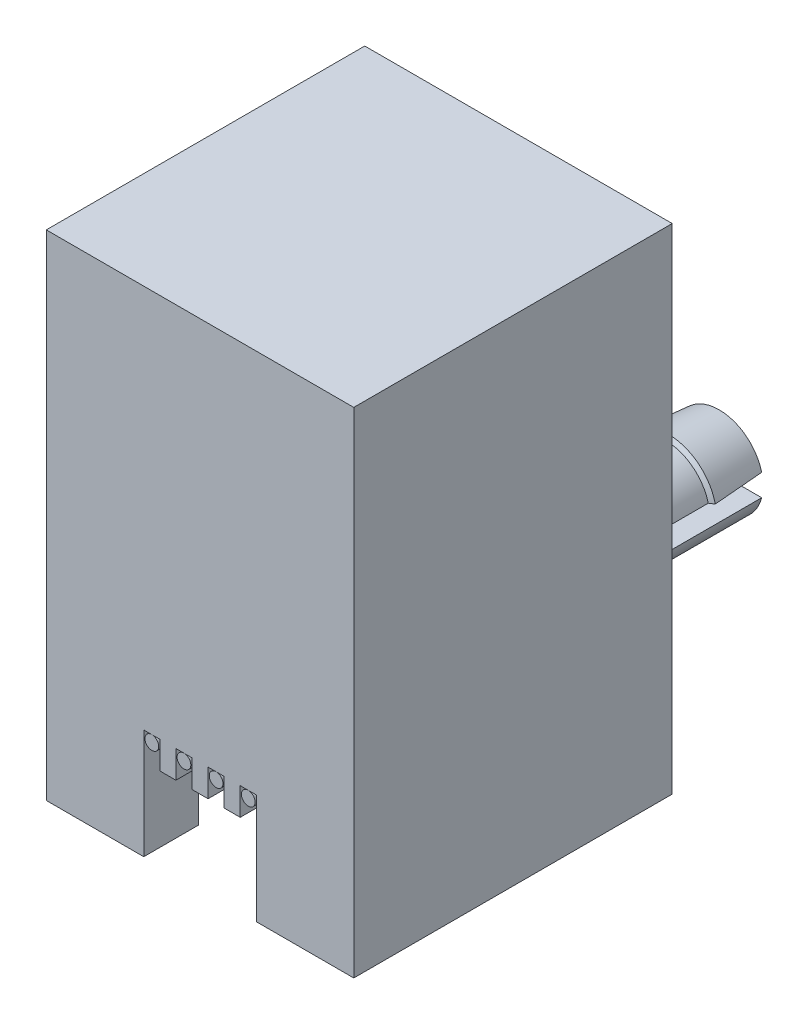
ISO-10303-21;
HEADER;
FILE_DESCRIPTION(('STEP AP214'),'2;1');
FILE_NAME('part.step','',(''),(''),'','','');
FILE_SCHEMA(('AUTOMOTIVE_DESIGN { 1 0 10303 214 1 1 1 1 }'));
ENDSEC;
DATA;
#1=APPLICATION_CONTEXT('core data for automotive mechanical design processes');
#2=APPLICATION_PROTOCOL_DEFINITION('international standard','automotive_design',2000,#1);
#3=PRODUCT_CONTEXT('',#1,'mechanical');
#4=PRODUCT('Part','Part','',(#3));
#5=PRODUCT_RELATED_PRODUCT_CATEGORY('part','',(#4));
#6=PRODUCT_DEFINITION_FORMATION('','',#4);
#7=PRODUCT_DEFINITION_CONTEXT('part definition',#1,'design');
#8=PRODUCT_DEFINITION('design','',#6,#7);
#9=PRODUCT_DEFINITION_SHAPE('','',#8);
#10=(LENGTH_UNIT() NAMED_UNIT(*) SI_UNIT(.MILLI.,.METRE.));
#11=(NAMED_UNIT(*) PLANE_ANGLE_UNIT() SI_UNIT($,.RADIAN.));
#12=(NAMED_UNIT(*) SI_UNIT($,.STERADIAN.) SOLID_ANGLE_UNIT());
#13=UNCERTAINTY_MEASURE_WITH_UNIT(LENGTH_MEASURE(1.E-05),#10,'distance_accuracy_value','');
#14=(GEOMETRIC_REPRESENTATION_CONTEXT(3) GLOBAL_UNCERTAINTY_ASSIGNED_CONTEXT((#13)) GLOBAL_UNIT_ASSIGNED_CONTEXT((#10,
#11,#12)) REPRESENTATION_CONTEXT('',''));
#15=CARTESIAN_POINT('',(0.,0.,0.));
#16=DIRECTION('',(0.,0.,1.));
#17=DIRECTION('',(1.,0.,0.));
#18=AXIS2_PLACEMENT_3D('',#15,#16,#17);
#19=CARTESIAN_POINT('',(1.75705714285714,-4.63023613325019,3.48094400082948));
#20=DIRECTION('',(0.,0.984807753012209,-0.173648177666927));
#21=DIRECTION('',(0.,0.173648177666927,0.984807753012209));
#22=AXIS2_PLACEMENT_3D('',#19,#20,#21);
#23=CYLINDRICAL_SURFACE('',#22,0.25);
#24=CARTESIAN_POINT('',(1.75705714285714,-4.63023613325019,3.48094400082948));
#25=DIRECTION('',(0.,-0.984807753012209,0.173648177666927));
#26=DIRECTION('',(1.,0.,0.));
#27=AXIS2_PLACEMENT_3D('',#24,#25,#26);
#28=CIRCLE('',#27,0.25);
#29=CARTESIAN_POINT('',(1.75705714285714,-4.67364817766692,3.23474206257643));
#30=VERTEX_POINT('',#29);
#31=EDGE_CURVE('E53',#30,#30,#28,.T.);
#32=ORIENTED_EDGE('',*,*,#31,.F.);
#33=EDGE_LOOP('',(#32));
#34=FACE_BOUND('',#33,.T.);
#35=CARTESIAN_POINT('',(1.75705714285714,1.55658795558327,2.39003998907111));
#36=DIRECTION('',(0.,-0.984807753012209,0.173648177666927));
#37=DIRECTION('',(1.,0.,0.));
#38=AXIS2_PLACEMENT_3D('',#35,#36,#37);
#39=CIRCLE('',#38,0.25);
#40=CARTESIAN_POINT('',(2.00705714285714,1.55658795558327,2.39003998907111));
#41=VERTEX_POINT('',#40);
#42=EDGE_CURVE('E12',#41,#41,#39,.T.);
#43=ORIENTED_EDGE('',*,*,#42,.T.);
#44=EDGE_LOOP('',(#43));
#45=FACE_BOUND('',#44,.T.);
#46=ADVANCED_FACE('F47',(#34,#45),#23,.T.);
#47=CARTESIAN_POINT('',(1.75705714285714,-4.5,4.21954981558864));
#48=DIRECTION('',(1.,0.,0.));
#49=DIRECTION('',(0.,0.,-1.));
#50=AXIS2_PLACEMENT_3D('',#47,#48,#49);
#51=TOROIDAL_SURFACE('',#50,0.750000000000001,0.25);
#52=CARTESIAN_POINT('',(1.75705714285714,-5.25,4.21954981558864));
#53=DIRECTION('',(0.,0.,1.));
#54=DIRECTION('',(1.,0.,0.));
#55=AXIS2_PLACEMENT_3D('',#52,#53,#54);
#56=CIRCLE('',#55,0.25);
#57=CARTESIAN_POINT('',(1.75705714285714,-5.5,4.21954981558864));
#58=VERTEX_POINT('',#57);
#59=EDGE_CURVE('E57',#58,#58,#56,.T.);
#60=CARTESIAN_POINT('',(1.75705714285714,-4.5,4.21954981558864));
#61=DIRECTION('',(1.,0.,0.));
#62=DIRECTION('',(0.,0.,-1.));
#63=AXIS2_PLACEMENT_3D('',#60,#61,#62);
#64=CIRCLE('',#63,1.);
#65=EDGE_CURVE('',#58,#30,#64,.T.);
#66=ORIENTED_EDGE('',*,*,#59,.F.);
#67=ORIENTED_EDGE('',*,*,#31,.T.);
#68=ORIENTED_EDGE('',*,*,#65,.T.);
#69=ORIENTED_EDGE('',*,*,#65,.F.);
#70=EDGE_LOOP('',(#66,#68,#67,#69));
#71=FACE_BOUND('',#70,.T.);
#72=ADVANCED_FACE('F72',(#71),#51,.T.);
#73=CARTESIAN_POINT('',(1.75705714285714,-5.25,4.21954981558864));
#74=DIRECTION('',(0.,0.,1.));
#75=DIRECTION('',(1.,0.,0.));
#76=AXIS2_PLACEMENT_3D('',#73,#74,#75);
#77=CYLINDRICAL_SURFACE('',#76,0.25);
#78=ORIENTED_EDGE('',*,*,#59,.T.);
#79=EDGE_LOOP('',(#78));
#80=FACE_BOUND('',#79,.T.);
#81=CARTESIAN_POINT('',(1.75705714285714,-5.25,5.8));
#82=DIRECTION('',(0.,0.,1.));
#83=DIRECTION('',(1.,0.,0.));
#84=AXIS2_PLACEMENT_3D('',#81,#82,#83);
#85=CIRCLE('',#84,0.25);
#86=CARTESIAN_POINT('',(2.00705714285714,-5.25,5.8));
#87=VERTEX_POINT('',#86);
#88=EDGE_CURVE('E61',#87,#87,#85,.T.);
#89=ORIENTED_EDGE('',*,*,#88,.F.);
#90=EDGE_LOOP('',(#89));
#91=FACE_BOUND('',#90,.T.);
#92=ADVANCED_FACE('F69',(#80,#91),#77,.T.);
#93=CARTESIAN_POINT('',(1.75705714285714,1.55658795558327,2.39003998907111));
#94=DIRECTION('',(0.,-0.984807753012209,0.173648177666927));
#95=DIRECTION('',(1.,0.,0.));
#96=AXIS2_PLACEMENT_3D('',#93,#94,#95);
#97=PLANE('',#96);
#98=ORIENTED_EDGE('',*,*,#42,.F.);
#99=EDGE_LOOP('',(#98));
#100=FACE_BOUND('',#99,.T.);
#101=ADVANCED_FACE('F71',(#100),#97,.F.);
#102=CARTESIAN_POINT('',(1.75705714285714,-5.25,5.8));
#103=DIRECTION('',(0.,0.,1.));
#104=DIRECTION('',(1.,0.,0.));
#105=AXIS2_PLACEMENT_3D('',#102,#103,#104);
#106=PLANE('',#105);
#107=ORIENTED_EDGE('',*,*,#88,.T.);
#108=EDGE_LOOP('',(#107));
#109=FACE_BOUND('',#108,.T.);
#110=ADVANCED_FACE('F67',(#109),#106,.T.);
#111=CLOSED_SHELL('',(#46,#72,#92,#101,#110));
#112=MANIFOLD_SOLID_BREP('B2',#111);
#113=CARTESIAN_POINT('',(0.585657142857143,-4.63023613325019,3.48094400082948));
#114=DIRECTION('',(0.,0.984807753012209,-0.173648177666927));
#115=DIRECTION('',(0.,0.173648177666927,0.984807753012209));
#116=AXIS2_PLACEMENT_3D('',#113,#114,#115);
#117=CYLINDRICAL_SURFACE('',#116,0.25);
#118=CARTESIAN_POINT('',(0.585657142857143,-4.63023613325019,3.48094400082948));
#119=DIRECTION('',(0.,-0.984807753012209,0.173648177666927));
#120=DIRECTION('',(1.,0.,0.));
#121=AXIS2_PLACEMENT_3D('',#118,#119,#120);
#122=CIRCLE('',#121,0.25);
#123=CARTESIAN_POINT('',(0.585657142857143,-4.67364817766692,3.23474206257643));
#124=VERTEX_POINT('',#123);
#125=EDGE_CURVE('E131',#124,#124,#122,.T.);
#126=ORIENTED_EDGE('',*,*,#125,.F.);
#127=EDGE_LOOP('',(#126));
#128=FACE_BOUND('',#127,.T.);
#129=CARTESIAN_POINT('',(0.585657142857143,1.55658795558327,2.39003998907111));
#130=DIRECTION('',(0.,-0.984807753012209,0.173648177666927));
#131=DIRECTION('',(1.,0.,0.));
#132=AXIS2_PLACEMENT_3D('',#129,#130,#131);
#133=CIRCLE('',#132,0.25);
#134=CARTESIAN_POINT('',(0.835657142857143,1.55658795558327,2.39003998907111));
#135=VERTEX_POINT('',#134);
#136=EDGE_CURVE('E46',#135,#135,#133,.T.);
#137=ORIENTED_EDGE('',*,*,#136,.T.);
#138=EDGE_LOOP('',(#137));
#139=FACE_BOUND('',#138,.T.);
#140=ADVANCED_FACE('F125',(#128,#139),#117,.T.);
#141=CARTESIAN_POINT('',(0.585657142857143,-4.5,4.21954981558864));
#142=DIRECTION('',(1.,0.,0.));
#143=DIRECTION('',(0.,0.,-1.));
#144=AXIS2_PLACEMENT_3D('',#141,#142,#143);
#145=TOROIDAL_SURFACE('',#144,0.750000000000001,0.25);
#146=CARTESIAN_POINT('',(0.585657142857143,-5.25,4.21954981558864));
#147=DIRECTION('',(0.,0.,1.));
#148=DIRECTION('',(1.,0.,0.));
#149=AXIS2_PLACEMENT_3D('',#146,#147,#148);
#150=CIRCLE('',#149,0.25);
#151=CARTESIAN_POINT('',(0.585657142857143,-5.5,4.21954981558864));
#152=VERTEX_POINT('',#151);
#153=EDGE_CURVE('E135',#152,#152,#150,.T.);
#154=CARTESIAN_POINT('',(0.585657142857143,-4.5,4.21954981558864));
#155=DIRECTION('',(1.,0.,0.));
#156=DIRECTION('',(0.,0.,-1.));
#157=AXIS2_PLACEMENT_3D('',#154,#155,#156);
#158=CIRCLE('',#157,1.);
#159=EDGE_CURVE('',#152,#124,#158,.T.);
#160=ORIENTED_EDGE('',*,*,#153,.F.);
#161=ORIENTED_EDGE('',*,*,#125,.T.);
#162=ORIENTED_EDGE('',*,*,#159,.T.);
#163=ORIENTED_EDGE('',*,*,#159,.F.);
#164=EDGE_LOOP('',(#160,#162,#161,#163));
#165=FACE_BOUND('',#164,.T.);
#166=ADVANCED_FACE('F150',(#165),#145,.T.);
#167=CARTESIAN_POINT('',(0.585657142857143,-5.25,4.21954981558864));
#168=DIRECTION('',(0.,0.,1.));
#169=DIRECTION('',(1.,0.,0.));
#170=AXIS2_PLACEMENT_3D('',#167,#168,#169);
#171=CYLINDRICAL_SURFACE('',#170,0.25);
#172=ORIENTED_EDGE('',*,*,#153,.T.);
#173=EDGE_LOOP('',(#172));
#174=FACE_BOUND('',#173,.T.);
#175=CARTESIAN_POINT('',(0.585657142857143,-5.25,5.8));
#176=DIRECTION('',(0.,0.,1.));
#177=DIRECTION('',(1.,0.,0.));
#178=AXIS2_PLACEMENT_3D('',#175,#176,#177);
#179=CIRCLE('',#178,0.25);
#180=CARTESIAN_POINT('',(0.835657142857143,-5.25,5.8));
#181=VERTEX_POINT('',#180);
#182=EDGE_CURVE('E139',#181,#181,#179,.T.);
#183=ORIENTED_EDGE('',*,*,#182,.F.);
#184=EDGE_LOOP('',(#183));
#185=FACE_BOUND('',#184,.T.);
#186=ADVANCED_FACE('F147',(#174,#185),#171,.T.);
#187=CARTESIAN_POINT('',(0.585657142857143,1.55658795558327,2.39003998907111));
#188=DIRECTION('',(0.,-0.984807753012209,0.173648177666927));
#189=DIRECTION('',(1.,0.,0.));
#190=AXIS2_PLACEMENT_3D('',#187,#188,#189);
#191=PLANE('',#190);
#192=ORIENTED_EDGE('',*,*,#136,.F.);
#193=EDGE_LOOP('',(#192));
#194=FACE_BOUND('',#193,.T.);
#195=ADVANCED_FACE('F149',(#194),#191,.F.);
#196=CARTESIAN_POINT('',(0.585657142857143,-5.25,5.8));
#197=DIRECTION('',(0.,0.,1.));
#198=DIRECTION('',(1.,0.,0.));
#199=AXIS2_PLACEMENT_3D('',#196,#197,#198);
#200=PLANE('',#199);
#201=ORIENTED_EDGE('',*,*,#182,.T.);
#202=EDGE_LOOP('',(#201));
#203=FACE_BOUND('',#202,.T.);
#204=ADVANCED_FACE('F145',(#203),#200,.T.);
#205=CLOSED_SHELL('',(#140,#166,#186,#195,#204));
#206=MANIFOLD_SOLID_BREP('B7',#205);
#207=CARTESIAN_POINT('',(-0.585742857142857,-4.63023613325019,3.48094400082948));
#208=DIRECTION('',(0.,0.984807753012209,-0.173648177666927));
#209=DIRECTION('',(0.,0.173648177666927,0.984807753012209));
#210=AXIS2_PLACEMENT_3D('',#207,#208,#209);
#211=CYLINDRICAL_SURFACE('',#210,0.25);
#212=CARTESIAN_POINT('',(-0.585742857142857,-4.63023613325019,3.48094400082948));
#213=DIRECTION('',(0.,-0.984807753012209,0.173648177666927));
#214=DIRECTION('',(1.,0.,0.));
#215=AXIS2_PLACEMENT_3D('',#212,#213,#214);
#216=CIRCLE('',#215,0.25);
#217=CARTESIAN_POINT('',(-0.585742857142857,-4.67364817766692,3.23474206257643));
#218=VERTEX_POINT('',#217);
#219=EDGE_CURVE('E209',#218,#218,#216,.T.);
#220=ORIENTED_EDGE('',*,*,#219,.F.);
#221=EDGE_LOOP('',(#220));
#222=FACE_BOUND('',#221,.T.);
#223=CARTESIAN_POINT('',(-0.585742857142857,1.55658795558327,2.39003998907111));
#224=DIRECTION('',(0.,-0.984807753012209,0.173648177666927));
#225=DIRECTION('',(1.,0.,0.));
#226=AXIS2_PLACEMENT_3D('',#223,#224,#225);
#227=CIRCLE('',#226,0.25);
#228=CARTESIAN_POINT('',(-0.335742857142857,1.55658795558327,2.39003998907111));
#229=VERTEX_POINT('',#228);
#230=EDGE_CURVE('E124',#229,#229,#227,.T.);
#231=ORIENTED_EDGE('',*,*,#230,.T.);
#232=EDGE_LOOP('',(#231));
#233=FACE_BOUND('',#232,.T.);
#234=ADVANCED_FACE('F203',(#222,#233),#211,.T.);
#235=CARTESIAN_POINT('',(-0.585742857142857,-4.5,4.21954981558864));
#236=DIRECTION('',(1.,0.,0.));
#237=DIRECTION('',(0.,0.,-1.));
#238=AXIS2_PLACEMENT_3D('',#235,#236,#237);
#239=TOROIDAL_SURFACE('',#238,0.750000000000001,0.25);
#240=CARTESIAN_POINT('',(-0.585742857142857,-5.25,4.21954981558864));
#241=DIRECTION('',(0.,0.,1.));
#242=DIRECTION('',(1.,0.,0.));
#243=AXIS2_PLACEMENT_3D('',#240,#241,#242);
#244=CIRCLE('',#243,0.25);
#245=CARTESIAN_POINT('',(-0.585742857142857,-5.5,4.21954981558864));
#246=VERTEX_POINT('',#245);
#247=EDGE_CURVE('E213',#246,#246,#244,.T.);
#248=CARTESIAN_POINT('',(-0.585742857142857,-4.5,4.21954981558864));
#249=DIRECTION('',(1.,0.,0.));
#250=DIRECTION('',(0.,0.,-1.));
#251=AXIS2_PLACEMENT_3D('',#248,#249,#250);
#252=CIRCLE('',#251,1.);
#253=EDGE_CURVE('',#246,#218,#252,.T.);
#254=ORIENTED_EDGE('',*,*,#247,.F.);
#255=ORIENTED_EDGE('',*,*,#219,.T.);
#256=ORIENTED_EDGE('',*,*,#253,.T.);
#257=ORIENTED_EDGE('',*,*,#253,.F.);
#258=EDGE_LOOP('',(#254,#256,#255,#257));
#259=FACE_BOUND('',#258,.T.);
#260=ADVANCED_FACE('F228',(#259),#239,.T.);
#261=CARTESIAN_POINT('',(-0.585742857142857,-5.25,4.21954981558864));
#262=DIRECTION('',(0.,0.,1.));
#263=DIRECTION('',(1.,0.,0.));
#264=AXIS2_PLACEMENT_3D('',#261,#262,#263);
#265=CYLINDRICAL_SURFACE('',#264,0.25);
#266=ORIENTED_EDGE('',*,*,#247,.T.);
#267=EDGE_LOOP('',(#266));
#268=FACE_BOUND('',#267,.T.);
#269=CARTESIAN_POINT('',(-0.585742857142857,-5.25,5.8));
#270=DIRECTION('',(0.,0.,1.));
#271=DIRECTION('',(1.,0.,0.));
#272=AXIS2_PLACEMENT_3D('',#269,#270,#271);
#273=CIRCLE('',#272,0.25);
#274=CARTESIAN_POINT('',(-0.335742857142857,-5.25,5.8));
#275=VERTEX_POINT('',#274);
#276=EDGE_CURVE('E217',#275,#275,#273,.T.);
#277=ORIENTED_EDGE('',*,*,#276,.F.);
#278=EDGE_LOOP('',(#277));
#279=FACE_BOUND('',#278,.T.);
#280=ADVANCED_FACE('F225',(#268,#279),#265,.T.);
#281=CARTESIAN_POINT('',(-0.585742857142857,1.55658795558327,2.39003998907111));
#282=DIRECTION('',(0.,-0.984807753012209,0.173648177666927));
#283=DIRECTION('',(1.,0.,0.));
#284=AXIS2_PLACEMENT_3D('',#281,#282,#283);
#285=PLANE('',#284);
#286=ORIENTED_EDGE('',*,*,#230,.F.);
#287=EDGE_LOOP('',(#286));
#288=FACE_BOUND('',#287,.T.);
#289=ADVANCED_FACE('F227',(#288),#285,.F.);
#290=CARTESIAN_POINT('',(-0.585742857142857,-5.25,5.8));
#291=DIRECTION('',(0.,0.,1.));
#292=DIRECTION('',(1.,0.,0.));
#293=AXIS2_PLACEMENT_3D('',#290,#291,#292);
#294=PLANE('',#293);
#295=ORIENTED_EDGE('',*,*,#276,.T.);
#296=EDGE_LOOP('',(#295));
#297=FACE_BOUND('',#296,.T.);
#298=ADVANCED_FACE('F223',(#297),#294,.T.);
#299=CLOSED_SHELL('',(#234,#260,#280,#289,#298));
#300=MANIFOLD_SOLID_BREP('B41',#299);
#301=CARTESIAN_POINT('',(-1.75714285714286,-4.63023613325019,3.48094400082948));
#302=DIRECTION('',(0.,0.984807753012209,-0.173648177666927));
#303=DIRECTION('',(0.,0.173648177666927,0.984807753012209));
#304=AXIS2_PLACEMENT_3D('',#301,#302,#303);
#305=CYLINDRICAL_SURFACE('',#304,0.25);
#306=CARTESIAN_POINT('',(-1.75714285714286,-4.63023613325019,3.48094400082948));
#307=DIRECTION('',(0.,-0.984807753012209,0.173648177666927));
#308=DIRECTION('',(1.,0.,0.));
#309=AXIS2_PLACEMENT_3D('',#306,#307,#308);
#310=CIRCLE('',#309,0.25);
#311=CARTESIAN_POINT('',(-1.75714285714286,-4.67364817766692,3.23474206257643));
#312=VERTEX_POINT('',#311);
#313=EDGE_CURVE('E288',#312,#312,#310,.T.);
#314=ORIENTED_EDGE('',*,*,#313,.F.);
#315=EDGE_LOOP('',(#314));
#316=FACE_BOUND('',#315,.T.);
#317=CARTESIAN_POINT('',(-1.75714285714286,1.55658795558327,2.39003998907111));
#318=DIRECTION('',(0.,-0.984807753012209,0.173648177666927));
#319=DIRECTION('',(1.,0.,0.));
#320=AXIS2_PLACEMENT_3D('',#317,#318,#319);
#321=CIRCLE('',#320,0.25);
#322=CARTESIAN_POINT('',(-1.50714285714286,1.55658795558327,2.39003998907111));
#323=VERTEX_POINT('',#322);
#324=EDGE_CURVE('E202',#323,#323,#321,.T.);
#325=ORIENTED_EDGE('',*,*,#324,.T.);
#326=EDGE_LOOP('',(#325));
#327=FACE_BOUND('',#326,.T.);
#328=ADVANCED_FACE('F282',(#316,#327),#305,.T.);
#329=CARTESIAN_POINT('',(-1.75714285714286,-4.5,4.21954981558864));
#330=DIRECTION('',(1.,0.,0.));
#331=DIRECTION('',(0.,0.,-1.));
#332=AXIS2_PLACEMENT_3D('',#329,#330,#331);
#333=TOROIDAL_SURFACE('',#332,0.750000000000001,0.25);
#334=CARTESIAN_POINT('',(-1.75714285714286,-5.25,4.21954981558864));
#335=DIRECTION('',(0.,0.,1.));
#336=DIRECTION('',(1.,0.,0.));
#337=AXIS2_PLACEMENT_3D('',#334,#335,#336);
#338=CIRCLE('',#337,0.25);
#339=CARTESIAN_POINT('',(-1.75714285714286,-5.5,4.21954981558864));
#340=VERTEX_POINT('',#339);
#341=EDGE_CURVE('E292',#340,#340,#338,.T.);
#342=CARTESIAN_POINT('',(-1.75714285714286,-4.5,4.21954981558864));
#343=DIRECTION('',(1.,0.,0.));
#344=DIRECTION('',(0.,0.,-1.));
#345=AXIS2_PLACEMENT_3D('',#342,#343,#344);
#346=CIRCLE('',#345,1.);
#347=EDGE_CURVE('',#340,#312,#346,.T.);
#348=ORIENTED_EDGE('',*,*,#341,.F.);
#349=ORIENTED_EDGE('',*,*,#313,.T.);
#350=ORIENTED_EDGE('',*,*,#347,.T.);
#351=ORIENTED_EDGE('',*,*,#347,.F.);
#352=EDGE_LOOP('',(#348,#350,#349,#351));
#353=FACE_BOUND('',#352,.T.);
#354=ADVANCED_FACE('F307',(#353),#333,.T.);
#355=CARTESIAN_POINT('',(-1.75714285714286,-5.25,4.21954981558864));
#356=DIRECTION('',(0.,0.,1.));
#357=DIRECTION('',(1.,0.,0.));
#358=AXIS2_PLACEMENT_3D('',#355,#356,#357);
#359=CYLINDRICAL_SURFACE('',#358,0.25);
#360=ORIENTED_EDGE('',*,*,#341,.T.);
#361=EDGE_LOOP('',(#360));
#362=FACE_BOUND('',#361,.T.);
#363=CARTESIAN_POINT('',(-1.75714285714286,-5.25,5.8));
#364=DIRECTION('',(0.,0.,1.));
#365=DIRECTION('',(1.,0.,0.));
#366=AXIS2_PLACEMENT_3D('',#363,#364,#365);
#367=CIRCLE('',#366,0.25);
#368=CARTESIAN_POINT('',(-1.50714285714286,-5.25,5.8));
#369=VERTEX_POINT('',#368);
#370=EDGE_CURVE('E296',#369,#369,#367,.T.);
#371=ORIENTED_EDGE('',*,*,#370,.F.);
#372=EDGE_LOOP('',(#371));
#373=FACE_BOUND('',#372,.T.);
#374=ADVANCED_FACE('F304',(#362,#373),#359,.T.);
#375=CARTESIAN_POINT('',(-1.75714285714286,1.55658795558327,2.39003998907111));
#376=DIRECTION('',(0.,-0.984807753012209,0.173648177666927));
#377=DIRECTION('',(1.,0.,0.));
#378=AXIS2_PLACEMENT_3D('',#375,#376,#377);
#379=PLANE('',#378);
#380=ORIENTED_EDGE('',*,*,#324,.F.);
#381=EDGE_LOOP('',(#380));
#382=FACE_BOUND('',#381,.T.);
#383=ADVANCED_FACE('F306',(#382),#379,.F.);
#384=CARTESIAN_POINT('',(-1.75714285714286,-5.25,5.8));
#385=DIRECTION('',(0.,0.,1.));
#386=DIRECTION('',(1.,0.,0.));
#387=AXIS2_PLACEMENT_3D('',#384,#385,#386);
#388=PLANE('',#387);
#389=ORIENTED_EDGE('',*,*,#370,.T.);
#390=EDGE_LOOP('',(#389));
#391=FACE_BOUND('',#390,.T.);
#392=ADVANCED_FACE('F302',(#391),#388,.T.);
#393=CLOSED_SHELL('',(#328,#354,#374,#383,#392));
#394=MANIFOLD_SOLID_BREP('B119',#393);
#395=CARTESIAN_POINT('',(4.,1.,3.8));
#396=DIRECTION('',(0.,-1.,0.));
#397=DIRECTION('',(0.,0.,-1.));
#398=AXIS2_PLACEMENT_3D('',#395,#396,#397);
#399=PLANE('',#398);
#400=DIRECTION('',(0.,0.,-1.));
#401=VECTOR('',#400,1.);
#402=CARTESIAN_POINT('',(1.46428571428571,1.,3.8));
#403=LINE('',#402,#401);
#404=CARTESIAN_POINT('',(1.46428571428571,1.,3.8));
#405=VERTEX_POINT('',#404);
#406=CARTESIAN_POINT('',(1.46428571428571,1.,0.));
#407=VERTEX_POINT('',#406);
#408=EDGE_CURVE('E845',#405,#407,#403,.T.);
#409=ORIENTED_EDGE('',*,*,#408,.F.);
#410=DIRECTION('',(-1.,0.,0.));
#411=VECTOR('',#410,1.);
#412=CARTESIAN_POINT('',(4.,1.,3.8));
#413=LINE('',#412,#411);
#414=CARTESIAN_POINT('',(0.878571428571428,1.,3.8));
#415=VERTEX_POINT('',#414);
#416=EDGE_CURVE('E1198',#405,#415,#413,.T.);
#417=ORIENTED_EDGE('',*,*,#416,.T.);
#418=DIRECTION('',(0.,0.,1.));
#419=VECTOR('',#418,1.);
#420=CARTESIAN_POINT('',(0.878571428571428,1.,-2.15));
#421=LINE('',#420,#419);
#422=CARTESIAN_POINT('',(0.878571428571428,1.,0.));
#423=VERTEX_POINT('',#422);
#424=EDGE_CURVE('E868',#423,#415,#421,.T.);
#425=ORIENTED_EDGE('',*,*,#424,.F.);
#426=DIRECTION('',(-1.,0.,0.));
#427=VECTOR('',#426,1.);
#428=CARTESIAN_POINT('',(2.4,1.,0.));
#429=LINE('',#428,#427);
#430=EDGE_CURVE('E981',#407,#423,#429,.T.);
#431=ORIENTED_EDGE('',*,*,#430,.F.);
#432=EDGE_LOOP('',(#409,#417,#425,#431));
#433=FACE_BOUND('',#432,.T.);
#434=ADVANCED_FACE('F352',(#433),#399,.T.);
#435=CARTESIAN_POINT('',(2.4,1.3,0.));
#436=DIRECTION('',(0.,0.,1.));
#437=DIRECTION('',(1.,0.,0.));
#438=AXIS2_PLACEMENT_3D('',#435,#436,#437);
#439=PLANE('',#438);
#440=DIRECTION('',(-1.,0.,0.));
#441=VECTOR('',#440,1.);
#442=CARTESIAN_POINT('',(2.4,1.3,0.));
#443=LINE('',#442,#441);
#444=CARTESIAN_POINT('',(1.46428571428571,1.3,0.));
#445=VERTEX_POINT('',#444);
#446=CARTESIAN_POINT('',(0.878571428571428,1.3,0.));
#447=VERTEX_POINT('',#446);
#448=EDGE_CURVE('E966',#445,#447,#443,.T.);
#449=ORIENTED_EDGE('',*,*,#448,.F.);
#450=DIRECTION('',(0.,-1.,0.));
#451=VECTOR('',#450,1.);
#452=CARTESIAN_POINT('',(1.46428571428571,1.3,0.));
#453=LINE('',#452,#451);
#454=EDGE_CURVE('E860',#445,#407,#453,.T.);
#455=ORIENTED_EDGE('',*,*,#454,.T.);
#456=ORIENTED_EDGE('',*,*,#430,.T.);
#457=DIRECTION('',(0.,1.,0.));
#458=VECTOR('',#457,1.);
#459=CARTESIAN_POINT('',(0.878571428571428,1.3,0.));
#460=LINE('',#459,#458);
#461=EDGE_CURVE('E882',#423,#447,#460,.T.);
#462=ORIENTED_EDGE('',*,*,#461,.T.);
#463=EDGE_LOOP('',(#449,#455,#456,#462));
#464=FACE_BOUND('',#463,.T.);
#465=ADVANCED_FACE('F1241',(#464),#439,.F.);
#466=DIRECTION('',(0.,0.,-1.));
#467=VECTOR('',#466,1.);
#468=CARTESIAN_POINT('',(0.292857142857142,1.,3.8));
#469=LINE('',#468,#467);
#470=CARTESIAN_POINT('',(0.292857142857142,1.,3.8));
#471=VERTEX_POINT('',#470);
#472=CARTESIAN_POINT('',(0.292857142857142,1.,0.));
#473=VERTEX_POINT('',#472);
#474=EDGE_CURVE('E863',#471,#473,#469,.T.);
#475=ORIENTED_EDGE('',*,*,#474,.F.);
#476=CARTESIAN_POINT('',(-0.292857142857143,1.,3.8));
#477=VERTEX_POINT('',#476);
#478=EDGE_CURVE('E1287',#471,#477,#413,.T.);
#479=ORIENTED_EDGE('',*,*,#478,.T.);
#480=DIRECTION('',(0.,0.,1.));
#481=VECTOR('',#480,1.);
#482=CARTESIAN_POINT('',(-0.292857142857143,1.,-2.15));
#483=LINE('',#482,#481);
#484=CARTESIAN_POINT('',(-0.292857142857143,1.,0.));
#485=VERTEX_POINT('',#484);
#486=EDGE_CURVE('E900',#485,#477,#483,.T.);
#487=ORIENTED_EDGE('',*,*,#486,.F.);
#488=EDGE_CURVE('E1205',#473,#485,#429,.T.);
#489=ORIENTED_EDGE('',*,*,#488,.F.);
#490=EDGE_LOOP('',(#475,#479,#487,#489));
#491=FACE_BOUND('',#490,.T.);
#492=ADVANCED_FACE('F1243',(#491),#399,.T.);
#493=CARTESIAN_POINT('',(0.292857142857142,1.3,0.));
#494=VERTEX_POINT('',#493);
#495=CARTESIAN_POINT('',(-0.292857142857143,1.3,0.));
#496=VERTEX_POINT('',#495);
#497=EDGE_CURVE('E1228',#494,#496,#443,.T.);
#498=ORIENTED_EDGE('',*,*,#497,.F.);
#499=DIRECTION('',(0.,-1.,0.));
#500=VECTOR('',#499,1.);
#501=CARTESIAN_POINT('',(0.292857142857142,1.3,0.));
#502=LINE('',#501,#500);
#503=EDGE_CURVE('E892',#494,#473,#502,.T.);
#504=ORIENTED_EDGE('',*,*,#503,.T.);
#505=ORIENTED_EDGE('',*,*,#488,.T.);
#506=DIRECTION('',(0.,1.,0.));
#507=VECTOR('',#506,1.);
#508=CARTESIAN_POINT('',(-0.292857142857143,1.3,0.));
#509=LINE('',#508,#507);
#510=EDGE_CURVE('E915',#485,#496,#509,.T.);
#511=ORIENTED_EDGE('',*,*,#510,.T.);
#512=EDGE_LOOP('',(#498,#504,#505,#511));
#513=FACE_BOUND('',#512,.T.);
#514=ADVANCED_FACE('F1245',(#513),#439,.F.);
#515=DIRECTION('',(0.,0.,-1.));
#516=VECTOR('',#515,1.);
#517=CARTESIAN_POINT('',(-0.878571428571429,1.,3.8));
#518=LINE('',#517,#516);
#519=CARTESIAN_POINT('',(-0.878571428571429,1.,3.8));
#520=VERTEX_POINT('',#519);
#521=CARTESIAN_POINT('',(-0.878571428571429,1.,0.));
#522=VERTEX_POINT('',#521);
#523=EDGE_CURVE('E895',#520,#522,#518,.T.);
#524=ORIENTED_EDGE('',*,*,#523,.F.);
#525=CARTESIAN_POINT('',(-1.46428571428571,1.,3.8));
#526=VERTEX_POINT('',#525);
#527=EDGE_CURVE('E1286',#520,#526,#413,.T.);
#528=ORIENTED_EDGE('',*,*,#527,.T.);
#529=DIRECTION('',(0.,0.,1.));
#530=VECTOR('',#529,1.);
#531=CARTESIAN_POINT('',(-1.46428571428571,1.,-2.15));
#532=LINE('',#531,#530);
#533=CARTESIAN_POINT('',(-1.46428571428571,1.,0.));
#534=VERTEX_POINT('',#533);
#535=EDGE_CURVE('E933',#534,#526,#532,.T.);
#536=ORIENTED_EDGE('',*,*,#535,.F.);
#537=EDGE_CURVE('E1206',#522,#534,#429,.T.);
#538=ORIENTED_EDGE('',*,*,#537,.F.);
#539=EDGE_LOOP('',(#524,#528,#536,#538));
#540=FACE_BOUND('',#539,.T.);
#541=ADVANCED_FACE('F1252',(#540),#399,.T.);
#542=CARTESIAN_POINT('',(-0.878571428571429,1.3,0.));
#543=VERTEX_POINT('',#542);
#544=CARTESIAN_POINT('',(-1.46428571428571,1.3,0.));
#545=VERTEX_POINT('',#544);
#546=EDGE_CURVE('E1227',#543,#545,#443,.T.);
#547=ORIENTED_EDGE('',*,*,#546,.F.);
#548=DIRECTION('',(0.,-1.,0.));
#549=VECTOR('',#548,1.);
#550=CARTESIAN_POINT('',(-0.878571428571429,1.3,0.));
#551=LINE('',#550,#549);
#552=EDGE_CURVE('E925',#543,#522,#551,.T.);
#553=ORIENTED_EDGE('',*,*,#552,.T.);
#554=ORIENTED_EDGE('',*,*,#537,.T.);
#555=DIRECTION('',(0.,1.,0.));
#556=VECTOR('',#555,1.);
#557=CARTESIAN_POINT('',(-1.46428571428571,1.3,0.));
#558=LINE('',#557,#556);
#559=EDGE_CURVE('E948',#534,#545,#558,.T.);
#560=ORIENTED_EDGE('',*,*,#559,.T.);
#561=EDGE_LOOP('',(#547,#553,#554,#560));
#562=FACE_BOUND('',#561,.T.);
#563=ADVANCED_FACE('F1256',(#562),#439,.F.);
#564=CARTESIAN_POINT('',(-2.05,1.3,0.));
#565=VERTEX_POINT('',#564);
#566=CARTESIAN_POINT('',(-2.4,1.3,0.));
#567=VERTEX_POINT('',#566);
#568=EDGE_CURVE('E967',#565,#567,#443,.T.);
#569=ORIENTED_EDGE('',*,*,#568,.F.);
#570=DIRECTION('',(0.,-1.,0.));
#571=VECTOR('',#570,1.);
#572=CARTESIAN_POINT('',(-2.05,1.3,0.));
#573=LINE('',#572,#571);
#574=CARTESIAN_POINT('',(-2.05,1.,0.));
#575=VERTEX_POINT('',#574);
#576=EDGE_CURVE('E958',#565,#575,#573,.T.);
#577=ORIENTED_EDGE('',*,*,#576,.T.);
#578=CARTESIAN_POINT('',(-2.4,1.,0.));
#579=VERTEX_POINT('',#578);
#580=EDGE_CURVE('E961',#575,#579,#429,.T.);
#581=ORIENTED_EDGE('',*,*,#580,.T.);
#582=DIRECTION('',(0.,-1.,0.));
#583=VECTOR('',#582,1.);
#584=CARTESIAN_POINT('',(-2.4,1.3,0.));
#585=LINE('',#584,#583);
#586=EDGE_CURVE('E976',#567,#579,#585,.T.);
#587=ORIENTED_EDGE('',*,*,#586,.F.);
#588=EDGE_LOOP('',(#569,#577,#581,#587));
#589=FACE_BOUND('',#588,.T.);
#590=ADVANCED_FACE('F1217',(#589),#439,.F.);
#591=CARTESIAN_POINT('',(-2.05,-6.,-1.28035431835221));
#592=DIRECTION('',(0.,1.,0.));
#593=DIRECTION('',(0.,0.,1.));
#594=AXIS2_PLACEMENT_3D('',#591,#592,#593);
#595=PLANE('',#594);
#596=DIRECTION('',(1.,0.,0.));
#597=VECTOR('',#596,1.);
#598=CARTESIAN_POINT('',(-2.05,-6.,3.8));
#599=LINE('',#598,#597);
#600=CARTESIAN_POINT('',(-0.292857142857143,-6.,3.8));
#601=VERTEX_POINT('',#600);
#602=CARTESIAN_POINT('',(0.292857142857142,-6.,3.8));
#603=VERTEX_POINT('',#602);
#604=EDGE_CURVE('E1471',#601,#603,#599,.T.);
#605=ORIENTED_EDGE('',*,*,#604,.T.);
#606=DIRECTION('',(0.,0.,-1.));
#607=VECTOR('',#606,1.);
#608=CARTESIAN_POINT('',(0.292857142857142,-6.,6.95890518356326));
#609=LINE('',#608,#607);
#610=CARTESIAN_POINT('',(0.292857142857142,-6.,5.8));
#611=VERTEX_POINT('',#610);
#612=EDGE_CURVE('E1002',#611,#603,#609,.T.);
#613=ORIENTED_EDGE('',*,*,#612,.F.);
#614=DIRECTION('',(-1.,0.,0.));
#615=VECTOR('',#614,1.);
#616=CARTESIAN_POINT('',(-2.05,-6.,5.8));
#617=LINE('',#616,#615);
#618=CARTESIAN_POINT('',(-0.292857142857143,-6.,5.8));
#619=VERTEX_POINT('',#618);
#620=EDGE_CURVE('E1480',#611,#619,#617,.T.);
#621=ORIENTED_EDGE('',*,*,#620,.T.);
#622=DIRECTION('',(0.,0.,-1.));
#623=VECTOR('',#622,1.);
#624=CARTESIAN_POINT('',(-0.292857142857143,-6.,6.95890518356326));
#625=LINE('',#624,#623);
#626=EDGE_CURVE('E1037',#619,#601,#625,.T.);
#627=ORIENTED_EDGE('',*,*,#626,.T.);
#628=EDGE_LOOP('',(#605,#613,#621,#627));
#629=FACE_BOUND('',#628,.T.);
#630=ADVANCED_FACE('F1268',(#629),#595,.F.);
#631=CARTESIAN_POINT('',(-1.46428571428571,-6.,3.8));
#632=VERTEX_POINT('',#631);
#633=CARTESIAN_POINT('',(-0.878571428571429,-6.,3.8));
#634=VERTEX_POINT('',#633);
#635=EDGE_CURVE('E1467',#632,#634,#599,.T.);
#636=ORIENTED_EDGE('',*,*,#635,.T.);
#637=DIRECTION('',(0.,0.,-1.));
#638=VECTOR('',#637,1.);
#639=CARTESIAN_POINT('',(-0.878571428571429,-6.,6.95890518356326));
#640=LINE('',#639,#638);
#641=CARTESIAN_POINT('',(-0.878571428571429,-6.,5.8));
#642=VERTEX_POINT('',#641);
#643=EDGE_CURVE('E1025',#642,#634,#640,.T.);
#644=ORIENTED_EDGE('',*,*,#643,.F.);
#645=CARTESIAN_POINT('',(-1.46428571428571,-6.,5.8));
#646=VERTEX_POINT('',#645);
#647=EDGE_CURVE('E1475',#642,#646,#617,.T.);
#648=ORIENTED_EDGE('',*,*,#647,.T.);
#649=DIRECTION('',(0.,0.,-1.));
#650=VECTOR('',#649,1.);
#651=CARTESIAN_POINT('',(-1.46428571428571,-6.,6.95890518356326));
#652=LINE('',#651,#650);
#653=EDGE_CURVE('E1066',#646,#632,#652,.T.);
#654=ORIENTED_EDGE('',*,*,#653,.T.);
#655=EDGE_LOOP('',(#636,#644,#648,#654));
#656=FACE_BOUND('',#655,.T.);
#657=ADVANCED_FACE('F1273',(#656),#595,.F.);
#658=CARTESIAN_POINT('',(-3.81,-1.12,-9.3));
#659=DIRECTION('',(0.,0.,1.));
#660=DIRECTION('',(1.,0.,0.));
#661=AXIS2_PLACEMENT_3D('',#658,#659,#660);
#662=CYLINDRICAL_SURFACE('',#661,1.6);
#663=CARTESIAN_POINT('',(-3.81,-1.12,-7.3537));
#664=DIRECTION('',(0.,0.,1.));
#665=DIRECTION('',(1.,0.,0.));
#666=AXIS2_PLACEMENT_3D('',#663,#664,#665);
#667=CIRCLE('',#666,1.6);
#668=CARTESIAN_POINT('',(-2.26080666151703,-0.72,-7.3537));
#669=VERTEX_POINT('',#668);
#670=CARTESIAN_POINT('',(-5.35919333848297,-0.72,-7.3537));
#671=VERTEX_POINT('',#670);
#672=EDGE_CURVE('E1080',#669,#671,#667,.T.);
#673=ORIENTED_EDGE('',*,*,#672,.T.);
#674=DIRECTION('',(0.,0.,1.));
#675=VECTOR('',#674,1.);
#676=CARTESIAN_POINT('',(-5.35919333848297,-0.72,-9.3));
#677=LINE('',#676,#675);
#678=CARTESIAN_POINT('',(-5.35919333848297,-0.72,-5.8));
#679=VERTEX_POINT('',#678);
#680=EDGE_CURVE('E2363',#671,#679,#677,.T.);
#681=ORIENTED_EDGE('',*,*,#680,.T.);
#682=CARTESIAN_POINT('',(-3.81,-1.12,-5.8));
#683=DIRECTION('',(0.,0.,1.));
#684=DIRECTION('',(1.,0.,0.));
#685=AXIS2_PLACEMENT_3D('',#682,#683,#684);
#686=CIRCLE('',#685,1.6);
#687=CARTESIAN_POINT('',(-2.26080666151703,-0.720000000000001,-5.8));
#688=VERTEX_POINT('',#687);
#689=EDGE_CURVE('E2418',#688,#679,#686,.T.);
#690=ORIENTED_EDGE('',*,*,#689,.F.);
#691=DIRECTION('',(0.,0.,1.));
#692=VECTOR('',#691,1.);
#693=CARTESIAN_POINT('',(-2.26080666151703,-0.72,-9.3));
#694=LINE('',#693,#692);
#695=EDGE_CURVE('E2359',#669,#688,#694,.T.);
#696=ORIENTED_EDGE('',*,*,#695,.F.);
#697=EDGE_LOOP('',(#673,#681,#690,#696));
#698=FACE_BOUND('',#697,.T.);
#699=ADVANCED_FACE('F2260',(#698),#662,.T.);
#700=CARTESIAN_POINT('',(3.81,-1.12,-9.3));
#701=DIRECTION('',(0.,0.,1.));
#702=DIRECTION('',(1.,0.,0.));
#703=AXIS2_PLACEMENT_3D('',#700,#701,#702);
#704=CYLINDRICAL_SURFACE('',#703,1.6);
#705=DIRECTION('',(0.,0.,1.));
#706=VECTOR('',#705,1.);
#707=CARTESIAN_POINT('',(5.35919333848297,-0.72,-9.3));
#708=LINE('',#707,#706);
#709=CARTESIAN_POINT('',(5.35919333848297,-0.72,-7.3537));
#710=VERTEX_POINT('',#709);
#711=CARTESIAN_POINT('',(5.35919333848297,-0.72,-5.8));
#712=VERTEX_POINT('',#711);
#713=EDGE_CURVE('E1391',#710,#712,#708,.T.);
#714=ORIENTED_EDGE('',*,*,#713,.F.);
#715=CARTESIAN_POINT('',(3.81,-1.12,-7.3537));
#716=DIRECTION('',(0.,0.,-1.));
#717=DIRECTION('',(-1.,0.,0.));
#718=AXIS2_PLACEMENT_3D('',#715,#716,#717);
#719=CIRCLE('',#718,1.6);
#720=CARTESIAN_POINT('',(2.26080666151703,-0.72,-7.3537));
#721=VERTEX_POINT('',#720);
#722=EDGE_CURVE('E2354',#721,#710,#719,.T.);
#723=ORIENTED_EDGE('',*,*,#722,.F.);
#724=DIRECTION('',(0.,0.,1.));
#725=VECTOR('',#724,1.);
#726=CARTESIAN_POINT('',(2.26080666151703,-0.72,-9.3));
#727=LINE('',#726,#725);
#728=CARTESIAN_POINT('',(2.26080666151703,-0.72,-5.8));
#729=VERTEX_POINT('',#728);
#730=EDGE_CURVE('E1395',#721,#729,#727,.T.);
#731=ORIENTED_EDGE('',*,*,#730,.T.);
#732=CARTESIAN_POINT('',(3.81,-1.12,-5.8));
#733=DIRECTION('',(0.,0.,-1.));
#734=DIRECTION('',(-1.,0.,0.));
#735=AXIS2_PLACEMENT_3D('',#732,#733,#734);
#736=CIRCLE('',#735,1.6);
#737=EDGE_CURVE('E2399',#729,#712,#736,.T.);
#738=ORIENTED_EDGE('',*,*,#737,.T.);
#739=EDGE_LOOP('',(#714,#723,#731,#738));
#740=FACE_BOUND('',#739,.T.);
#741=ADVANCED_FACE('F2238',(#740),#704,.T.);
#742=CARTESIAN_POINT('',(5.6,9.,-5.8));
#743=DIRECTION('',(0.,0.,1.));
#744=DIRECTION('',(1.,0.,0.));
#745=AXIS2_PLACEMENT_3D('',#742,#743,#744);
#746=PLANE('',#745);
#747=DIRECTION('',(1.,0.,0.));
#748=VECTOR('',#747,1.);
#749=CARTESIAN_POINT('',(-5.35919333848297,-0.72,-5.8));
#750=LINE('',#749,#748);
#751=EDGE_CURVE('E2415',#679,#688,#750,.T.);
#752=ORIENTED_EDGE('',*,*,#751,.T.);
#753=ORIENTED_EDGE('',*,*,#689,.T.);
#754=EDGE_LOOP('',(#752,#753));
#755=FACE_BOUND('',#754,.T.);
#756=DIRECTION('',(-1.,0.,0.));
#757=VECTOR('',#756,1.);
#758=CARTESIAN_POINT('',(-5.35919333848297,-1.52,-5.8));
#759=LINE('',#758,#757);
#760=CARTESIAN_POINT('',(-2.26080666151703,-1.52,-5.8));
#761=VERTEX_POINT('',#760);
#762=CARTESIAN_POINT('',(-5.35919333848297,-1.52,-5.8));
#763=VERTEX_POINT('',#762);
#764=EDGE_CURVE('E2374',#761,#763,#759,.T.);
#765=ORIENTED_EDGE('',*,*,#764,.T.);
#766=CARTESIAN_POINT('',(-3.81,-1.12,-5.8));
#767=DIRECTION('',(0.,0.,1.));
#768=DIRECTION('',(1.,0.,0.));
#769=AXIS2_PLACEMENT_3D('',#766,#767,#768);
#770=CIRCLE('',#769,1.6);
#771=EDGE_CURVE('E2362',#763,#761,#770,.T.);
#772=ORIENTED_EDGE('',*,*,#771,.T.);
#773=EDGE_LOOP('',(#765,#772));
#774=FACE_BOUND('',#773,.T.);
#775=CARTESIAN_POINT('',(3.81,-1.12,-5.8));
#776=DIRECTION('',(0.,0.,-1.));
#777=DIRECTION('',(-1.,0.,0.));
#778=AXIS2_PLACEMENT_3D('',#775,#776,#777);
#779=CIRCLE('',#778,1.6);
#780=CARTESIAN_POINT('',(5.35919333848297,-1.52,-5.8));
#781=VERTEX_POINT('',#780);
#782=CARTESIAN_POINT('',(2.26080666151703,-1.52,-5.8));
#783=VERTEX_POINT('',#782);
#784=EDGE_CURVE('E1394',#781,#783,#779,.T.);
#785=ORIENTED_EDGE('',*,*,#784,.F.);
#786=DIRECTION('',(1.,0.,0.));
#787=VECTOR('',#786,1.);
#788=CARTESIAN_POINT('',(5.35919333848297,-1.52,-5.8));
#789=LINE('',#788,#787);
#790=EDGE_CURVE('E1406',#783,#781,#789,.T.);
#791=ORIENTED_EDGE('',*,*,#790,.F.);
#792=EDGE_LOOP('',(#785,#791));
#793=FACE_BOUND('',#792,.T.);
#794=DIRECTION('',(-1.,0.,0.));
#795=VECTOR('',#794,1.);
#796=CARTESIAN_POINT('',(-2.9,-7.2,-5.8));
#797=LINE('',#796,#795);
#798=CARTESIAN_POINT('',(-1.5,-7.2,-5.8));
#799=VERTEX_POINT('',#798);
#800=CARTESIAN_POINT('',(-2.9,-7.2,-5.8));
#801=VERTEX_POINT('',#800);
#802=EDGE_CURVE('E1418',#799,#801,#797,.T.);
#803=ORIENTED_EDGE('',*,*,#802,.F.);
#804=DIRECTION('',(0.,1.,0.));
#805=VECTOR('',#804,1.);
#806=CARTESIAN_POINT('',(-1.5,-7.2,-5.8));
#807=LINE('',#806,#805);
#808=CARTESIAN_POINT('',(-1.5,-9.,-5.8));
#809=VERTEX_POINT('',#808);
#810=EDGE_CURVE('E1448',#809,#799,#807,.T.);
#811=ORIENTED_EDGE('',*,*,#810,.F.);
#812=DIRECTION('',(-1.,0.,0.));
#813=VECTOR('',#812,1.);
#814=CARTESIAN_POINT('',(5.6,-9.,-5.8));
#815=LINE('',#814,#813);
#816=CARTESIAN_POINT('',(-5.6,-9.,-5.8));
#817=VERTEX_POINT('',#816);
#818=EDGE_CURVE('E1376',#809,#817,#815,.T.);
#819=ORIENTED_EDGE('',*,*,#818,.T.);
#820=DIRECTION('',(0.,-1.,0.));
#821=VECTOR('',#820,1.);
#822=CARTESIAN_POINT('',(-5.6,9.,-5.8));
#823=LINE('',#822,#821);
#824=CARTESIAN_POINT('',(-5.6,9.,-5.8));
#825=VERTEX_POINT('',#824);
#826=EDGE_CURVE('E1383',#825,#817,#823,.T.);
#827=ORIENTED_EDGE('',*,*,#826,.F.);
#828=DIRECTION('',(-1.,0.,0.));
#829=VECTOR('',#828,1.);
#830=CARTESIAN_POINT('',(5.6,9.,-5.8));
#831=LINE('',#830,#829);
#832=CARTESIAN_POINT('',(5.6,9.,-5.8));
#833=VERTEX_POINT('',#832);
#834=EDGE_CURVE('E1366',#833,#825,#831,.T.);
#835=ORIENTED_EDGE('',*,*,#834,.F.);
#836=DIRECTION('',(0.,-1.,0.));
#837=VECTOR('',#836,1.);
#838=CARTESIAN_POINT('',(5.6,9.,-5.8));
#839=LINE('',#838,#837);
#840=CARTESIAN_POINT('',(5.6,-9.,-5.8));
#841=VERTEX_POINT('',#840);
#842=EDGE_CURVE('E1386',#833,#841,#839,.T.);
#843=ORIENTED_EDGE('',*,*,#842,.T.);
#844=CARTESIAN_POINT('',(1.5,-9.,-5.8));
#845=VERTEX_POINT('',#844);
#846=EDGE_CURVE('E1377',#841,#845,#815,.T.);
#847=ORIENTED_EDGE('',*,*,#846,.T.);
#848=DIRECTION('',(0.,-1.,0.));
#849=VECTOR('',#848,1.);
#850=CARTESIAN_POINT('',(1.5,-9.,-5.8));
#851=LINE('',#850,#849);
#852=CARTESIAN_POINT('',(1.5,-7.2,-5.8));
#853=VERTEX_POINT('',#852);
#854=EDGE_CURVE('E1446',#853,#845,#851,.T.);
#855=ORIENTED_EDGE('',*,*,#854,.F.);
#856=DIRECTION('',(-1.,0.,0.));
#857=VECTOR('',#856,1.);
#858=CARTESIAN_POINT('',(1.5,-7.2,-5.8));
#859=LINE('',#858,#857);
#860=CARTESIAN_POINT('',(2.9,-7.2,-5.8));
#861=VERTEX_POINT('',#860);
#862=EDGE_CURVE('E1443',#861,#853,#859,.T.);
#863=ORIENTED_EDGE('',*,*,#862,.F.);
#864=DIRECTION('',(0.,-1.,0.));
#865=VECTOR('',#864,1.);
#866=CARTESIAN_POINT('',(2.9,-7.2,-5.8));
#867=LINE('',#866,#865);
#868=CARTESIAN_POINT('',(2.9,-4.2,-5.8));
#869=VERTEX_POINT('',#868);
#870=EDGE_CURVE('E1440',#869,#861,#867,.T.);
#871=ORIENTED_EDGE('',*,*,#870,.F.);
#872=DIRECTION('',(1.,0.,0.));
#873=VECTOR('',#872,1.);
#874=CARTESIAN_POINT('',(2.9,-4.2,-5.8));
#875=LINE('',#874,#873);
#876=CARTESIAN_POINT('',(-2.9,-4.2,-5.8));
#877=VERTEX_POINT('',#876);
#878=EDGE_CURVE('E1437',#877,#869,#875,.T.);
#879=ORIENTED_EDGE('',*,*,#878,.F.);
#880=DIRECTION('',(0.,1.,0.));
#881=VECTOR('',#880,1.);
#882=CARTESIAN_POINT('',(-2.9,-4.2,-5.8));
#883=LINE('',#882,#881);
#884=EDGE_CURVE('E1434',#801,#877,#883,.T.);
#885=ORIENTED_EDGE('',*,*,#884,.F.);
#886=EDGE_LOOP('',(#803,#811,#819,#827,#835,#843,#847,#855,#863,#871,#879,#885));
#887=FACE_BOUND('',#886,.T.);
#888=ORIENTED_EDGE('',*,*,#737,.F.);
#889=DIRECTION('',(-1.,0.,0.));
#890=VECTOR('',#889,1.);
#891=CARTESIAN_POINT('',(5.35919333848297,-0.72,-5.8));
#892=LINE('',#891,#890);
#893=EDGE_CURVE('E2401',#712,#729,#892,.T.);
#894=ORIENTED_EDGE('',*,*,#893,.F.);
#895=EDGE_LOOP('',(#888,#894));
#896=FACE_BOUND('',#895,.T.);
#897=ADVANCED_FACE('F1522',(#755,#774,#793,#887,#896),#746,.F.);
#898=CARTESIAN_POINT('',(5.6,-9.,5.8));
#899=DIRECTION('',(0.,1.,0.));
#900=DIRECTION('',(0.,0.,1.));
#901=AXIS2_PLACEMENT_3D('',#898,#899,#900);
#902=PLANE('',#901);
#903=ORIENTED_EDGE('',*,*,#818,.F.);
#904=DIRECTION('',(0.,0.,-1.));
#905=VECTOR('',#904,1.);
#906=CARTESIAN_POINT('',(-1.5,-9.,2.72861208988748));
#907=LINE('',#906,#905);
#908=CARTESIAN_POINT('',(-1.5,-9.,-4.8));
#909=VERTEX_POINT('',#908);
#910=EDGE_CURVE('E1453',#909,#809,#907,.T.);
#911=ORIENTED_EDGE('',*,*,#910,.F.);
#912=DIRECTION('',(1.,0.,0.));
#913=VECTOR('',#912,1.);
#914=CARTESIAN_POINT('',(2.9,-9.,-4.8));
#915=LINE('',#914,#913);
#916=CARTESIAN_POINT('',(-2.9,-9.,-4.8));
#917=VERTEX_POINT('',#916);
#918=EDGE_CURVE('E1330',#917,#909,#915,.T.);
#919=ORIENTED_EDGE('',*,*,#918,.F.);
#920=DIRECTION('',(0.,0.,-1.));
#921=VECTOR('',#920,1.);
#922=CARTESIAN_POINT('',(-2.9,-9.,-4.8));
#923=LINE('',#922,#921);
#924=CARTESIAN_POINT('',(-2.9,-9.,-3.));
#925=VERTEX_POINT('',#924);
#926=EDGE_CURVE('E1326',#925,#917,#923,.T.);
#927=ORIENTED_EDGE('',*,*,#926,.F.);
#928=DIRECTION('',(1.,0.,0.));
#929=VECTOR('',#928,1.);
#930=CARTESIAN_POINT('',(-4.,-9.,-3.));
#931=LINE('',#930,#929);
#932=CARTESIAN_POINT('',(-4.,-9.,-3.));
#933=VERTEX_POINT('',#932);
#934=EDGE_CURVE('E1323',#933,#925,#931,.T.);
#935=ORIENTED_EDGE('',*,*,#934,.F.);
#936=DIRECTION('',(0.,0.,-1.));
#937=VECTOR('',#936,1.);
#938=CARTESIAN_POINT('',(-4.,-9.,-3.));
#939=LINE('',#938,#937);
#940=CARTESIAN_POINT('',(-4.,-9.,3.8));
#941=VERTEX_POINT('',#940);
#942=EDGE_CURVE('E1320',#941,#933,#939,.T.);
#943=ORIENTED_EDGE('',*,*,#942,.F.);
#944=DIRECTION('',(-1.,0.,0.));
#945=VECTOR('',#944,1.);
#946=CARTESIAN_POINT('',(4.,-9.,3.8));
#947=LINE('',#946,#945);
#948=CARTESIAN_POINT('',(-2.05,-9.,3.8));
#949=VERTEX_POINT('',#948);
#950=EDGE_CURVE('E1315',#949,#941,#947,.T.);
#951=ORIENTED_EDGE('',*,*,#950,.F.);
#952=DIRECTION('',(0.,0.,1.));
#953=VECTOR('',#952,1.);
#954=CARTESIAN_POINT('',(-2.05,-9.,-1.28035431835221));
#955=LINE('',#954,#953);
#956=CARTESIAN_POINT('',(-2.05,-9.,5.8));
#957=VERTEX_POINT('',#956);
#958=EDGE_CURVE('E1483',#949,#957,#955,.T.);
#959=ORIENTED_EDGE('',*,*,#958,.T.);
#960=DIRECTION('',(1.,0.,0.));
#961=VECTOR('',#960,1.);
#962=CARTESIAN_POINT('',(-5.6,-9.,5.8));
#963=LINE('',#962,#961);
#964=CARTESIAN_POINT('',(-5.6,-9.,5.8));
#965=VERTEX_POINT('',#964);
#966=EDGE_CURVE('E1371',#965,#957,#963,.T.);
#967=ORIENTED_EDGE('',*,*,#966,.F.);
#968=DIRECTION('',(0.,0.,1.));
#969=VECTOR('',#968,1.);
#970=CARTESIAN_POINT('',(-5.6,-9.,5.8));
#971=LINE('',#970,#969);
#972=EDGE_CURVE('E1364',#817,#965,#971,.T.);
#973=ORIENTED_EDGE('',*,*,#972,.F.);
#974=EDGE_LOOP('',(#903,#911,#919,#927,#935,#943,#951,#959,#967,#973));
#975=FACE_BOUND('',#974,.T.);
#976=ADVANCED_FACE('F1594',(#975),#902,.F.);
#977=CARTESIAN_POINT('',(2.9,1.,-4.8));
#978=DIRECTION('',(0.,0.,-1.));
#979=DIRECTION('',(-1.,0.,0.));
#980=AXIS2_PLACEMENT_3D('',#977,#978,#979);
#981=PLANE('',#980);
#982=DIRECTION('',(0.,-1.,0.));
#983=VECTOR('',#982,1.);
#984=CARTESIAN_POINT('',(-1.5,-7.2,-4.8));
#985=LINE('',#984,#983);
#986=CARTESIAN_POINT('',(-1.5,-7.2,-4.8));
#987=VERTEX_POINT('',#986);
#988=EDGE_CURVE('E1427',#987,#909,#985,.T.);
#989=ORIENTED_EDGE('',*,*,#988,.F.);
#990=DIRECTION('',(1.,0.,0.));
#991=VECTOR('',#990,1.);
#992=CARTESIAN_POINT('',(-2.9,-7.2,-4.8));
#993=LINE('',#992,#991);
#994=CARTESIAN_POINT('',(-2.9,-7.2,-4.8));
#995=VERTEX_POINT('',#994);
#996=EDGE_CURVE('E1429',#995,#987,#993,.T.);
#997=ORIENTED_EDGE('',*,*,#996,.F.);
#998=DIRECTION('',(0.,-1.,0.));
#999=VECTOR('',#998,1.);
#1000=CARTESIAN_POINT('',(-2.9,1.,-4.8));
#1001=LINE('',#1000,#999);
#1002=EDGE_CURVE('E1351',#995,#917,#1001,.T.);
#1003=ORIENTED_EDGE('',*,*,#1002,.T.);
#1004=ORIENTED_EDGE('',*,*,#918,.T.);
#1005=EDGE_LOOP('',(#989,#997,#1003,#1004));
#1006=FACE_BOUND('',#1005,.T.);
#1007=ADVANCED_FACE('F1902',(#1006),#981,.F.);
#1008=DIRECTION('',(1.,0.,0.));
#1009=VECTOR('',#1008,1.);
#1010=CARTESIAN_POINT('',(1.5,-7.2,-4.8));
#1011=LINE('',#1010,#1009);
#1012=CARTESIAN_POINT('',(1.5,-7.2,-4.8));
#1013=VERTEX_POINT('',#1012);
#1014=CARTESIAN_POINT('',(2.9,-7.2,-4.8));
#1015=VERTEX_POINT('',#1014);
#1016=EDGE_CURVE('E1422',#1013,#1015,#1011,.T.);
#1017=ORIENTED_EDGE('',*,*,#1016,.F.);
#1018=DIRECTION('',(0.,1.,0.));
#1019=VECTOR('',#1018,1.);
#1020=CARTESIAN_POINT('',(1.5,-9.,-4.8));
#1021=LINE('',#1020,#1019);
#1022=CARTESIAN_POINT('',(1.5,-9.,-4.8));
#1023=VERTEX_POINT('',#1022);
#1024=EDGE_CURVE('E1425',#1023,#1013,#1021,.T.);
#1025=ORIENTED_EDGE('',*,*,#1024,.F.);
#1026=CARTESIAN_POINT('',(2.9,-9.,-4.8));
#1027=VERTEX_POINT('',#1026);
#1028=EDGE_CURVE('E1329',#1023,#1027,#915,.T.);
#1029=ORIENTED_EDGE('',*,*,#1028,.T.);
#1030=DIRECTION('',(0.,-1.,0.));
#1031=VECTOR('',#1030,1.);
#1032=CARTESIAN_POINT('',(2.9,1.,-4.8));
#1033=LINE('',#1032,#1031);
#1034=EDGE_CURVE('E1347',#1015,#1027,#1033,.T.);
#1035=ORIENTED_EDGE('',*,*,#1034,.F.);
#1036=EDGE_LOOP('',(#1017,#1025,#1029,#1035));
#1037=FACE_BOUND('',#1036,.T.);
#1038=ADVANCED_FACE('F1516',(#1037),#981,.F.);
#1039=CARTESIAN_POINT('',(-5.6,9.,5.8));
#1040=DIRECTION('',(0.,0.,-1.));
#1041=DIRECTION('',(-1.,0.,0.));
#1042=AXIS2_PLACEMENT_3D('',#1039,#1040,#1041);
#1043=PLANE('',#1042);
#1044=ORIENTED_EDGE('',*,*,#620,.F.);
#1045=DIRECTION('',(0.,-1.,0.));
#1046=VECTOR('',#1045,1.);
#1047=CARTESIAN_POINT('',(0.292857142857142,-6.,5.8));
#1048=LINE('',#1047,#1046);
#1049=CARTESIAN_POINT('',(0.292857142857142,-5.,5.8));
#1050=VERTEX_POINT('',#1049);
#1051=EDGE_CURVE('E1001',#1050,#611,#1048,.T.);
#1052=ORIENTED_EDGE('',*,*,#1051,.F.);
#1053=DIRECTION('',(-1.,0.,0.));
#1054=VECTOR('',#1053,1.);
#1055=CARTESIAN_POINT('',(0.292857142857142,-5.,5.8));
#1056=LINE('',#1055,#1054);
#1057=CARTESIAN_POINT('',(0.878571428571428,-5.,5.8));
#1058=VERTEX_POINT('',#1057);
#1059=EDGE_CURVE('E1004',#1058,#1050,#1056,.T.);
#1060=ORIENTED_EDGE('',*,*,#1059,.F.);
#1061=DIRECTION('',(0.,1.,0.));
#1062=VECTOR('',#1061,1.);
#1063=CARTESIAN_POINT('',(0.878571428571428,-6.,5.8));
#1064=LINE('',#1063,#1062);
#1065=CARTESIAN_POINT('',(0.878571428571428,-6.,5.8));
#1066=VERTEX_POINT('',#1065);
#1067=EDGE_CURVE('E999',#1066,#1058,#1064,.T.);
#1068=ORIENTED_EDGE('',*,*,#1067,.F.);
#1069=CARTESIAN_POINT('',(1.46428571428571,-6.,5.8));
#1070=VERTEX_POINT('',#1069);
#1071=EDGE_CURVE('E1476',#1070,#1066,#617,.T.);
#1072=ORIENTED_EDGE('',*,*,#1071,.F.);
#1073=DIRECTION('',(0.,-1.,0.));
#1074=VECTOR('',#1073,1.);
#1075=CARTESIAN_POINT('',(1.46428571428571,-6.,5.8));
#1076=LINE('',#1075,#1074);
#1077=CARTESIAN_POINT('',(1.46428571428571,-5.,5.8));
#1078=VERTEX_POINT('',#1077);
#1079=EDGE_CURVE('E1045',#1078,#1070,#1076,.T.);
#1080=ORIENTED_EDGE('',*,*,#1079,.F.);
#1081=DIRECTION('',(-1.,0.,0.));
#1082=VECTOR('',#1081,1.);
#1083=CARTESIAN_POINT('',(2.05,-5.,5.8));
#1084=LINE('',#1083,#1082);
#1085=CARTESIAN_POINT('',(2.05,-5.,5.8));
#1086=VERTEX_POINT('',#1085);
#1087=EDGE_CURVE('E1047',#1086,#1078,#1084,.T.);
#1088=ORIENTED_EDGE('',*,*,#1087,.F.);
#1089=DIRECTION('',(0.,1.,0.));
#1090=VECTOR('',#1089,1.);
#1091=CARTESIAN_POINT('',(2.05,-6.,5.8));
#1092=LINE('',#1091,#1090);
#1093=CARTESIAN_POINT('',(2.05,-9.,5.8));
#1094=VERTEX_POINT('',#1093);
#1095=EDGE_CURVE('E1431',#1094,#1086,#1092,.T.);
#1096=ORIENTED_EDGE('',*,*,#1095,.F.);
#1097=CARTESIAN_POINT('',(5.6,-9.,5.8));
#1098=VERTEX_POINT('',#1097);
#1099=EDGE_CURVE('E1341',#1094,#1098,#963,.T.);
#1100=ORIENTED_EDGE('',*,*,#1099,.T.);
#1101=DIRECTION('',(0.,-1.,0.));
#1102=VECTOR('',#1101,1.);
#1103=CARTESIAN_POINT('',(5.6,9.,5.8));
#1104=LINE('',#1103,#1102);
#1105=CARTESIAN_POINT('',(5.6,9.,5.8));
#1106=VERTEX_POINT('',#1105);
#1107=EDGE_CURVE('E1149',#1106,#1098,#1104,.T.);
#1108=ORIENTED_EDGE('',*,*,#1107,.F.);
#1109=DIRECTION('',(1.,0.,0.));
#1110=VECTOR('',#1109,1.);
#1111=CARTESIAN_POINT('',(-5.6,9.,5.8));
#1112=LINE('',#1111,#1110);
#1113=CARTESIAN_POINT('',(-5.6,9.,5.8));
#1114=VERTEX_POINT('',#1113);
#1115=EDGE_CURVE('E1360',#1114,#1106,#1112,.T.);
#1116=ORIENTED_EDGE('',*,*,#1115,.F.);
#1117=DIRECTION('',(0.,-1.,0.));
#1118=VECTOR('',#1117,1.);
#1119=CARTESIAN_POINT('',(-5.6,9.,5.8));
#1120=LINE('',#1119,#1118);
#1121=EDGE_CURVE('E1370',#1114,#965,#1120,.T.);
#1122=ORIENTED_EDGE('',*,*,#1121,.T.);
#1123=ORIENTED_EDGE('',*,*,#966,.T.);
#1124=DIRECTION('',(0.,-1.,0.));
#1125=VECTOR('',#1124,1.);
#1126=CARTESIAN_POINT('',(-2.05,-9.,5.8));
#1127=LINE('',#1126,#1125);
#1128=CARTESIAN_POINT('',(-2.05,-5.,5.8));
#1129=VERTEX_POINT('',#1128);
#1130=EDGE_CURVE('E1479',#1129,#957,#1127,.T.);
#1131=ORIENTED_EDGE('',*,*,#1130,.F.);
#1132=DIRECTION('',(-1.,0.,0.));
#1133=VECTOR('',#1132,1.);
#1134=CARTESIAN_POINT('',(-2.05,-5.,5.8));
#1135=LINE('',#1134,#1133);
#1136=CARTESIAN_POINT('',(-1.46428571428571,-5.,5.8));
#1137=VERTEX_POINT('',#1136);
#1138=EDGE_CURVE('E1065',#1137,#1129,#1135,.T.);
#1139=ORIENTED_EDGE('',*,*,#1138,.F.);
#1140=DIRECTION('',(0.,1.,0.));
#1141=VECTOR('',#1140,1.);
#1142=CARTESIAN_POINT('',(-1.46428571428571,-6.,5.8));
#1143=LINE('',#1142,#1141);
#1144=EDGE_CURVE('E1063',#646,#1137,#1143,.T.);
#1145=ORIENTED_EDGE('',*,*,#1144,.F.);
#1146=ORIENTED_EDGE('',*,*,#647,.F.);
#1147=DIRECTION('',(0.,-1.,0.));
#1148=VECTOR('',#1147,1.);
#1149=CARTESIAN_POINT('',(-0.878571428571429,-6.,5.8));
#1150=LINE('',#1149,#1148);
#1151=CARTESIAN_POINT('',(-0.878571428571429,-5.,5.8));
#1152=VERTEX_POINT('',#1151);
#1153=EDGE_CURVE('E1024',#1152,#642,#1150,.T.);
#1154=ORIENTED_EDGE('',*,*,#1153,.F.);
#1155=DIRECTION('',(-1.,0.,0.));
#1156=VECTOR('',#1155,1.);
#1157=CARTESIAN_POINT('',(-0.878571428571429,-5.,5.8));
#1158=LINE('',#1157,#1156);
#1159=CARTESIAN_POINT('',(-0.292857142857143,-5.,5.8));
#1160=VERTEX_POINT('',#1159);
#1161=EDGE_CURVE('E1027',#1160,#1152,#1158,.T.);
#1162=ORIENTED_EDGE('',*,*,#1161,.F.);
#1163=DIRECTION('',(0.,1.,0.));
#1164=VECTOR('',#1163,1.);
#1165=CARTESIAN_POINT('',(-0.292857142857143,-6.,5.8));
#1166=LINE('',#1165,#1164);
#1167=EDGE_CURVE('E1022',#619,#1160,#1166,.T.);
#1168=ORIENTED_EDGE('',*,*,#1167,.F.);
#1169=EDGE_LOOP('',(#1044,#1052,#1060,#1068,#1072,#1080,#1088,#1096,#1100,#1108,#1116,#1122,
#1123,#1131,#1139,#1145,#1146,#1154,#1162,#1168));
#1170=FACE_BOUND('',#1169,.T.);
#1171=ADVANCED_FACE('F354',(#1170),#1043,.F.);
#1172=CARTESIAN_POINT('',(5.6,9.,5.8));
#1173=DIRECTION('',(-1.,0.,0.));
#1174=DIRECTION('',(0.,0.,1.));
#1175=AXIS2_PLACEMENT_3D('',#1172,#1173,#1174);
#1176=PLANE('',#1175);
#1177=DIRECTION('',(0.,0.,-1.));
#1178=VECTOR('',#1177,1.);
#1179=CARTESIAN_POINT('',(5.6,-9.,5.8));
#1180=LINE('',#1179,#1178);
#1181=EDGE_CURVE('E1374',#1098,#841,#1180,.T.);
#1182=ORIENTED_EDGE('',*,*,#1181,.T.);
#1183=ORIENTED_EDGE('',*,*,#842,.F.);
#1184=DIRECTION('',(0.,0.,-1.));
#1185=VECTOR('',#1184,1.);
#1186=CARTESIAN_POINT('',(5.6,9.,5.8));
#1187=LINE('',#1186,#1185);
#1188=EDGE_CURVE('E1363',#1106,#833,#1187,.T.);
#1189=ORIENTED_EDGE('',*,*,#1188,.F.);
#1190=ORIENTED_EDGE('',*,*,#1107,.T.);
#1191=EDGE_LOOP('',(#1182,#1183,#1189,#1190));
#1192=FACE_BOUND('',#1191,.T.);
#1193=ADVANCED_FACE('F1529',(#1192),#1176,.F.);
#1194=CARTESIAN_POINT('',(-5.6,9.,5.8));
#1195=DIRECTION('',(1.,0.,0.));
#1196=DIRECTION('',(0.,0.,-1.));
#1197=AXIS2_PLACEMENT_3D('',#1194,#1195,#1196);
#1198=PLANE('',#1197);
#1199=ORIENTED_EDGE('',*,*,#972,.T.);
#1200=ORIENTED_EDGE('',*,*,#1121,.F.);
#1201=DIRECTION('',(0.,0.,1.));
#1202=VECTOR('',#1201,1.);
#1203=CARTESIAN_POINT('',(-5.6,9.,5.8));
#1204=LINE('',#1203,#1202);
#1205=EDGE_CURVE('E1368',#825,#1114,#1204,.T.);
#1206=ORIENTED_EDGE('',*,*,#1205,.F.);
#1207=ORIENTED_EDGE('',*,*,#826,.T.);
#1208=EDGE_LOOP('',(#1199,#1200,#1206,#1207));
#1209=FACE_BOUND('',#1208,.T.);
#1210=ADVANCED_FACE('F1940',(#1209),#1198,.F.);
#1211=CARTESIAN_POINT('',(5.6,9.,5.8));
#1212=DIRECTION('',(0.,1.,0.));
#1213=DIRECTION('',(0.,0.,1.));
#1214=AXIS2_PLACEMENT_3D('',#1211,#1212,#1213);
#1215=PLANE('',#1214);
#1216=ORIENTED_EDGE('',*,*,#1115,.T.);
#1217=ORIENTED_EDGE('',*,*,#1188,.T.);
#1218=ORIENTED_EDGE('',*,*,#834,.T.);
#1219=ORIENTED_EDGE('',*,*,#1205,.T.);
#1220=EDGE_LOOP('',(#1216,#1217,#1218,#1219));
#1221=FACE_BOUND('',#1220,.T.);
#1222=ADVANCED_FACE('F1932',(#1221),#1215,.T.);
#1223=ORIENTED_EDGE('',*,*,#1028,.F.);
#1224=DIRECTION('',(0.,0.,-1.));
#1225=VECTOR('',#1224,1.);
#1226=CARTESIAN_POINT('',(1.5,-9.,2.72861208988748));
#1227=LINE('',#1226,#1225);
#1228=EDGE_CURVE('E1455',#1023,#845,#1227,.T.);
#1229=ORIENTED_EDGE('',*,*,#1228,.T.);
#1230=ORIENTED_EDGE('',*,*,#846,.F.);
#1231=ORIENTED_EDGE('',*,*,#1181,.F.);
#1232=ORIENTED_EDGE('',*,*,#1099,.F.);
#1233=DIRECTION('',(0.,0.,1.));
#1234=VECTOR('',#1233,1.);
#1235=CARTESIAN_POINT('',(2.05,-9.,-1.28035431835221));
#1236=LINE('',#1235,#1234);
#1237=CARTESIAN_POINT('',(2.05,-9.,3.8));
#1238=VERTEX_POINT('',#1237);
#1239=EDGE_CURVE('E1482',#1238,#1094,#1236,.T.);
#1240=ORIENTED_EDGE('',*,*,#1239,.F.);
#1241=CARTESIAN_POINT('',(4.,-9.,3.8));
#1242=VERTEX_POINT('',#1241);
#1243=EDGE_CURVE('E1317',#1242,#1238,#947,.T.);
#1244=ORIENTED_EDGE('',*,*,#1243,.F.);
#1245=DIRECTION('',(0.,0.,1.));
#1246=VECTOR('',#1245,1.);
#1247=CARTESIAN_POINT('',(4.,-9.,-3.));
#1248=LINE('',#1247,#1246);
#1249=CARTESIAN_POINT('',(4.,-9.,-3.));
#1250=VERTEX_POINT('',#1249);
#1251=EDGE_CURVE('E1313',#1250,#1242,#1248,.T.);
#1252=ORIENTED_EDGE('',*,*,#1251,.F.);
#1253=DIRECTION('',(1.,0.,0.));
#1254=VECTOR('',#1253,1.);
#1255=CARTESIAN_POINT('',(4.,-9.,-3.));
#1256=LINE('',#1255,#1254);
#1257=CARTESIAN_POINT('',(2.9,-9.,-3.));
#1258=VERTEX_POINT('',#1257);
#1259=EDGE_CURVE('E1336',#1258,#1250,#1256,.T.);
#1260=ORIENTED_EDGE('',*,*,#1259,.F.);
#1261=DIRECTION('',(0.,0.,1.));
#1262=VECTOR('',#1261,1.);
#1263=CARTESIAN_POINT('',(2.9,-9.,-4.8));
#1264=LINE('',#1263,#1262);
#1265=EDGE_CURVE('E1333',#1027,#1258,#1264,.T.);
#1266=ORIENTED_EDGE('',*,*,#1265,.F.);
#1267=EDGE_LOOP('',(#1223,#1229,#1230,#1231,#1232,#1240,#1244,#1252,#1260,#1266));
#1268=FACE_BOUND('',#1267,.T.);
#1269=ADVANCED_FACE('F1496',(#1268),#902,.F.);
#1270=CARTESIAN_POINT('',(4.,1.,-3.));
#1271=DIRECTION('',(1.,0.,0.));
#1272=DIRECTION('',(0.,0.,-1.));
#1273=AXIS2_PLACEMENT_3D('',#1270,#1271,#1272);
#1274=PLANE('',#1273);
#1275=ORIENTED_EDGE('',*,*,#1251,.T.);
#1276=DIRECTION('',(0.,-1.,0.));
#1277=VECTOR('',#1276,1.);
#1278=CARTESIAN_POINT('',(4.,1.,3.8));
#1279=LINE('',#1278,#1277);
#1280=CARTESIAN_POINT('',(4.,1.,3.8));
#1281=VERTEX_POINT('',#1280);
#1282=EDGE_CURVE('E1312',#1281,#1242,#1279,.T.);
#1283=ORIENTED_EDGE('',*,*,#1282,.F.);
#1284=DIRECTION('',(0.,0.,1.));
#1285=VECTOR('',#1284,1.);
#1286=CARTESIAN_POINT('',(4.,1.,-3.));
#1287=LINE('',#1286,#1285);
#1288=CARTESIAN_POINT('',(4.,1.,-3.));
#1289=VERTEX_POINT('',#1288);
#1290=EDGE_CURVE('E1290',#1289,#1281,#1287,.T.);
#1291=ORIENTED_EDGE('',*,*,#1290,.F.);
#1292=DIRECTION('',(0.,-1.,0.));
#1293=VECTOR('',#1292,1.);
#1294=CARTESIAN_POINT('',(4.,1.,-3.));
#1295=LINE('',#1294,#1293);
#1296=EDGE_CURVE('E1339',#1289,#1250,#1295,.T.);
#1297=ORIENTED_EDGE('',*,*,#1296,.T.);
#1298=EDGE_LOOP('',(#1275,#1283,#1291,#1297));
#1299=FACE_BOUND('',#1298,.T.);
#1300=ADVANCED_FACE('F1501',(#1299),#1274,.F.);
#1301=CARTESIAN_POINT('',(4.,1.,-3.));
#1302=DIRECTION('',(0.,0.,-1.));
#1303=DIRECTION('',(-1.,0.,0.));
#1304=AXIS2_PLACEMENT_3D('',#1301,#1302,#1303);
#1305=PLANE('',#1304);
#1306=ORIENTED_EDGE('',*,*,#1259,.T.);
#1307=ORIENTED_EDGE('',*,*,#1296,.F.);
#1308=DIRECTION('',(1.,0.,0.));
#1309=VECTOR('',#1308,1.);
#1310=CARTESIAN_POINT('',(4.,1.,-3.));
#1311=LINE('',#1310,#1309);
#1312=CARTESIAN_POINT('',(2.9,1.,-3.));
#1313=VERTEX_POINT('',#1312);
#1314=EDGE_CURVE('E1309',#1313,#1289,#1311,.T.);
#1315=ORIENTED_EDGE('',*,*,#1314,.F.);
#1316=DIRECTION('',(0.,-1.,0.));
#1317=VECTOR('',#1316,1.);
#1318=CARTESIAN_POINT('',(2.9,1.,-3.));
#1319=LINE('',#1318,#1317);
#1320=EDGE_CURVE('E1342',#1313,#1258,#1319,.T.);
#1321=ORIENTED_EDGE('',*,*,#1320,.T.);
#1322=EDGE_LOOP('',(#1306,#1307,#1315,#1321));
#1323=FACE_BOUND('',#1322,.T.);
#1324=ADVANCED_FACE('F1505',(#1323),#1305,.F.);
#1325=CARTESIAN_POINT('',(2.9,1.,-4.8));
#1326=DIRECTION('',(1.,0.,0.));
#1327=DIRECTION('',(0.,0.,-1.));
#1328=AXIS2_PLACEMENT_3D('',#1325,#1326,#1327);
#1329=PLANE('',#1328);
#1330=ORIENTED_EDGE('',*,*,#1265,.T.);
#1331=ORIENTED_EDGE('',*,*,#1320,.F.);
#1332=DIRECTION('',(0.,0.,1.));
#1333=VECTOR('',#1332,1.);
#1334=CARTESIAN_POINT('',(2.9,1.,-4.8));
#1335=LINE('',#1334,#1333);
#1336=CARTESIAN_POINT('',(2.9,1.,-4.8));
#1337=VERTEX_POINT('',#1336);
#1338=EDGE_CURVE('E1306',#1337,#1313,#1335,.T.);
#1339=ORIENTED_EDGE('',*,*,#1338,.F.);
#1340=CARTESIAN_POINT('',(2.9,-4.2,-4.8));
#1341=VERTEX_POINT('',#1340);
#1342=EDGE_CURVE('E1344',#1337,#1341,#1033,.T.);
#1343=ORIENTED_EDGE('',*,*,#1342,.T.);
#1344=DIRECTION('',(0.,0.,-1.));
#1345=VECTOR('',#1344,1.);
#1346=CARTESIAN_POINT('',(2.9,-4.2,2.72861208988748));
#1347=LINE('',#1346,#1345);
#1348=EDGE_CURVE('E1462',#1341,#869,#1347,.T.);
#1349=ORIENTED_EDGE('',*,*,#1348,.T.);
#1350=ORIENTED_EDGE('',*,*,#870,.T.);
#1351=DIRECTION('',(0.,0.,-1.));
#1352=VECTOR('',#1351,1.);
#1353=CARTESIAN_POINT('',(2.9,-7.2,2.72861208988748));
#1354=LINE('',#1353,#1352);
#1355=EDGE_CURVE('E1460',#1015,#861,#1354,.T.);
#1356=ORIENTED_EDGE('',*,*,#1355,.F.);
#1357=ORIENTED_EDGE('',*,*,#1034,.T.);
#1358=EDGE_LOOP('',(#1330,#1331,#1339,#1343,#1349,#1350,#1356,#1357));
#1359=FACE_BOUND('',#1358,.T.);
#1360=ADVANCED_FACE('F1509',(#1359),#1329,.F.);
#1361=CARTESIAN_POINT('',(-2.9,1.,-4.8));
#1362=VERTEX_POINT('',#1361);
#1363=CARTESIAN_POINT('',(-2.9,-4.2,-4.8));
#1364=VERTEX_POINT('',#1363);
#1365=EDGE_CURVE('E1348',#1362,#1364,#1001,.T.);
#1366=ORIENTED_EDGE('',*,*,#1365,.T.);
#1367=DIRECTION('',(-1.,0.,0.));
#1368=VECTOR('',#1367,1.);
#1369=CARTESIAN_POINT('',(2.9,-4.2,-4.8));
#1370=LINE('',#1369,#1368);
#1371=EDGE_CURVE('E1419',#1341,#1364,#1370,.T.);
#1372=ORIENTED_EDGE('',*,*,#1371,.F.);
#1373=ORIENTED_EDGE('',*,*,#1342,.F.);
#1374=DIRECTION('',(1.,0.,0.));
#1375=VECTOR('',#1374,1.);
#1376=CARTESIAN_POINT('',(2.9,1.,-4.8));
#1377=LINE('',#1376,#1375);
#1378=EDGE_CURVE('E1303',#1362,#1337,#1377,.T.);
#1379=ORIENTED_EDGE('',*,*,#1378,.F.);
#1380=EDGE_LOOP('',(#1366,#1372,#1373,#1379));
#1381=FACE_BOUND('',#1380,.T.);
#1382=ADVANCED_FACE('F1887',(#1381),#981,.F.);
#1383=CARTESIAN_POINT('',(-2.9,1.,-4.8));
#1384=DIRECTION('',(-1.,0.,0.));
#1385=DIRECTION('',(0.,0.,1.));
#1386=AXIS2_PLACEMENT_3D('',#1383,#1384,#1385);
#1387=PLANE('',#1386);
#1388=ORIENTED_EDGE('',*,*,#926,.T.);
#1389=ORIENTED_EDGE('',*,*,#1002,.F.);
#1390=DIRECTION('',(0.,0.,-1.));
#1391=VECTOR('',#1390,1.);
#1392=CARTESIAN_POINT('',(-2.9,-7.2,2.72861208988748));
#1393=LINE('',#1392,#1391);
#1394=EDGE_CURVE('E1451',#995,#801,#1393,.T.);
#1395=ORIENTED_EDGE('',*,*,#1394,.T.);
#1396=ORIENTED_EDGE('',*,*,#884,.T.);
#1397=DIRECTION('',(0.,0.,-1.));
#1398=VECTOR('',#1397,1.);
#1399=CARTESIAN_POINT('',(-2.9,-4.2,2.72861208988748));
#1400=LINE('',#1399,#1398);
#1401=EDGE_CURVE('E1464',#1364,#877,#1400,.T.);
#1402=ORIENTED_EDGE('',*,*,#1401,.F.);
#1403=ORIENTED_EDGE('',*,*,#1365,.F.);
#1404=DIRECTION('',(0.,0.,-1.));
#1405=VECTOR('',#1404,1.);
#1406=CARTESIAN_POINT('',(-2.9,1.,-4.8));
#1407=LINE('',#1406,#1405);
#1408=CARTESIAN_POINT('',(-2.9,1.,-3.));
#1409=VERTEX_POINT('',#1408);
#1410=EDGE_CURVE('E1300',#1409,#1362,#1407,.T.);
#1411=ORIENTED_EDGE('',*,*,#1410,.F.);
#1412=DIRECTION('',(0.,-1.,0.));
#1413=VECTOR('',#1412,1.);
#1414=CARTESIAN_POINT('',(-2.9,1.,-3.));
#1415=LINE('',#1414,#1413);
#1416=EDGE_CURVE('E1352',#1409,#925,#1415,.T.);
#1417=ORIENTED_EDGE('',*,*,#1416,.T.);
#1418=EDGE_LOOP('',(#1388,#1389,#1395,#1396,#1402,#1403,#1411,#1417));
#1419=FACE_BOUND('',#1418,.T.);
#1420=ADVANCED_FACE('F1877',(#1419),#1387,.F.);
#1421=CARTESIAN_POINT('',(-4.,1.,-3.));
#1422=DIRECTION('',(0.,0.,-1.));
#1423=DIRECTION('',(-1.,0.,0.));
#1424=AXIS2_PLACEMENT_3D('',#1421,#1422,#1423);
#1425=PLANE('',#1424);
#1426=ORIENTED_EDGE('',*,*,#934,.T.);
#1427=ORIENTED_EDGE('',*,*,#1416,.F.);
#1428=DIRECTION('',(1.,0.,0.));
#1429=VECTOR('',#1428,1.);
#1430=CARTESIAN_POINT('',(-4.,1.,-3.));
#1431=LINE('',#1430,#1429);
#1432=CARTESIAN_POINT('',(-4.,1.,-3.));
#1433=VERTEX_POINT('',#1432);
#1434=EDGE_CURVE('E1297',#1433,#1409,#1431,.T.);
#1435=ORIENTED_EDGE('',*,*,#1434,.F.);
#1436=DIRECTION('',(0.,-1.,0.));
#1437=VECTOR('',#1436,1.);
#1438=CARTESIAN_POINT('',(-4.,1.,-3.));
#1439=LINE('',#1438,#1437);
#1440=EDGE_CURVE('E1354',#1433,#933,#1439,.T.);
#1441=ORIENTED_EDGE('',*,*,#1440,.T.);
#1442=EDGE_LOOP('',(#1426,#1427,#1435,#1441));
#1443=FACE_BOUND('',#1442,.T.);
#1444=ADVANCED_FACE('F1868',(#1443),#1425,.F.);
#1445=CARTESIAN_POINT('',(-4.,1.,-3.));
#1446=DIRECTION('',(-1.,0.,0.));
#1447=DIRECTION('',(0.,0.,1.));
#1448=AXIS2_PLACEMENT_3D('',#1445,#1446,#1447);
#1449=PLANE('',#1448);
#1450=ORIENTED_EDGE('',*,*,#942,.T.);
#1451=ORIENTED_EDGE('',*,*,#1440,.F.);
#1452=DIRECTION('',(0.,0.,-1.));
#1453=VECTOR('',#1452,1.);
#1454=CARTESIAN_POINT('',(-4.,1.,-3.));
#1455=LINE('',#1454,#1453);
#1456=CARTESIAN_POINT('',(-4.,1.,3.8));
#1457=VERTEX_POINT('',#1456);
#1458=EDGE_CURVE('E1293',#1457,#1433,#1455,.T.);
#1459=ORIENTED_EDGE('',*,*,#1458,.F.);
#1460=DIRECTION('',(0.,-1.,0.));
#1461=VECTOR('',#1460,1.);
#1462=CARTESIAN_POINT('',(-4.,1.,3.8));
#1463=LINE('',#1462,#1461);
#1464=EDGE_CURVE('E1356',#1457,#941,#1463,.T.);
#1465=ORIENTED_EDGE('',*,*,#1464,.T.);
#1466=EDGE_LOOP('',(#1450,#1451,#1459,#1465));
#1467=FACE_BOUND('',#1466,.T.);
#1468=ADVANCED_FACE('F1599',(#1467),#1449,.F.);
#1469=CARTESIAN_POINT('',(4.,1.,3.8));
#1470=DIRECTION('',(0.,0.,1.));
#1471=DIRECTION('',(1.,0.,0.));
#1472=AXIS2_PLACEMENT_3D('',#1469,#1470,#1471);
#1473=PLANE('',#1472);
#1474=DIRECTION('',(1.,0.,0.));
#1475=VECTOR('',#1474,1.);
#1476=CARTESIAN_POINT('',(0.292857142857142,-5.,3.8));
#1477=LINE('',#1476,#1475);
#1478=CARTESIAN_POINT('',(0.292857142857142,-5.,3.8));
#1479=VERTEX_POINT('',#1478);
#1480=CARTESIAN_POINT('',(0.878571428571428,-5.,3.8));
#1481=VERTEX_POINT('',#1480);
#1482=EDGE_CURVE('E1007',#1479,#1481,#1477,.T.);
#1483=ORIENTED_EDGE('',*,*,#1482,.F.);
#1484=DIRECTION('',(0.,1.,0.));
#1485=VECTOR('',#1484,1.);
#1486=CARTESIAN_POINT('',(0.292857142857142,-6.,3.8));
#1487=LINE('',#1486,#1485);
#1488=EDGE_CURVE('E992',#603,#1479,#1487,.T.);
#1489=ORIENTED_EDGE('',*,*,#1488,.F.);
#1490=ORIENTED_EDGE('',*,*,#604,.F.);
#1491=DIRECTION('',(0.,-1.,0.));
#1492=VECTOR('',#1491,1.);
#1493=CARTESIAN_POINT('',(-0.292857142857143,-6.,3.8));
#1494=LINE('',#1493,#1492);
#1495=CARTESIAN_POINT('',(-0.292857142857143,-5.,3.8));
#1496=VERTEX_POINT('',#1495);
#1497=EDGE_CURVE('E1033',#1496,#601,#1494,.T.);
#1498=ORIENTED_EDGE('',*,*,#1497,.F.);
#1499=DIRECTION('',(1.,0.,0.));
#1500=VECTOR('',#1499,1.);
#1501=CARTESIAN_POINT('',(-0.878571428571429,-5.,3.8));
#1502=LINE('',#1501,#1500);
#1503=CARTESIAN_POINT('',(-0.878571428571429,-5.,3.8));
#1504=VERTEX_POINT('',#1503);
#1505=EDGE_CURVE('E1030',#1504,#1496,#1502,.T.);
#1506=ORIENTED_EDGE('',*,*,#1505,.F.);
#1507=DIRECTION('',(0.,1.,0.));
#1508=VECTOR('',#1507,1.);
#1509=CARTESIAN_POINT('',(-0.878571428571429,-6.,3.8));
#1510=LINE('',#1509,#1508);
#1511=EDGE_CURVE('E1021',#634,#1504,#1510,.T.);
#1512=ORIENTED_EDGE('',*,*,#1511,.F.);
#1513=ORIENTED_EDGE('',*,*,#635,.F.);
#1514=DIRECTION('',(0.,-1.,0.));
#1515=VECTOR('',#1514,1.);
#1516=CARTESIAN_POINT('',(-1.46428571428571,-6.,3.8));
#1517=LINE('',#1516,#1515);
#1518=CARTESIAN_POINT('',(-1.46428571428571,-5.,3.8));
#1519=VERTEX_POINT('',#1518);
#1520=EDGE_CURVE('E1069',#1519,#632,#1517,.T.);
#1521=ORIENTED_EDGE('',*,*,#1520,.F.);
#1522=DIRECTION('',(1.,0.,0.));
#1523=VECTOR('',#1522,1.);
#1524=CARTESIAN_POINT('',(-2.05,-5.,3.8));
#1525=LINE('',#1524,#1523);
#1526=CARTESIAN_POINT('',(-2.05,-5.,3.8));
#1527=VERTEX_POINT('',#1526);
#1528=EDGE_CURVE('E1050',#1527,#1519,#1525,.T.);
#1529=ORIENTED_EDGE('',*,*,#1528,.F.);
#1530=DIRECTION('',(0.,1.,0.));
#1531=VECTOR('',#1530,1.);
#1532=CARTESIAN_POINT('',(-2.05,-9.,3.8));
#1533=LINE('',#1532,#1531);
#1534=EDGE_CURVE('E1470',#949,#1527,#1533,.T.);
#1535=ORIENTED_EDGE('',*,*,#1534,.F.);
#1536=ORIENTED_EDGE('',*,*,#950,.T.);
#1537=ORIENTED_EDGE('',*,*,#1464,.F.);
#1538=CARTESIAN_POINT('',(-2.05,1.,3.8));
#1539=VERTEX_POINT('',#1538);
#1540=EDGE_CURVE('E1288',#1539,#1457,#413,.T.);
#1541=ORIENTED_EDGE('',*,*,#1540,.F.);
#1542=DIRECTION('',(0.,-1.,0.));
#1543=VECTOR('',#1542,1.);
#1544=CARTESIAN_POINT('',(-2.05,1.6,3.8));
#1545=LINE('',#1544,#1543);
#1546=CARTESIAN_POINT('',(-2.05,1.6,3.8));
#1547=VERTEX_POINT('',#1546);
#1548=EDGE_CURVE('E946',#1547,#1539,#1545,.T.);
#1549=ORIENTED_EDGE('',*,*,#1548,.F.);
#1550=DIRECTION('',(-1.,0.,0.));
#1551=VECTOR('',#1550,1.);
#1552=CARTESIAN_POINT('',(-2.05,1.6,3.8));
#1553=LINE('',#1552,#1551);
#1554=CARTESIAN_POINT('',(-1.46428571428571,1.6,3.8));
#1555=VERTEX_POINT('',#1554);
#1556=EDGE_CURVE('E939',#1555,#1547,#1553,.T.);
#1557=ORIENTED_EDGE('',*,*,#1556,.F.);
#1558=DIRECTION('',(0.,-1.,0.));
#1559=VECTOR('',#1558,1.);
#1560=CARTESIAN_POINT('',(-1.46428571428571,1.6,3.8));
#1561=LINE('',#1560,#1559);
#1562=EDGE_CURVE('E949',#1555,#526,#1561,.T.);
#1563=ORIENTED_EDGE('',*,*,#1562,.T.);
#1564=ORIENTED_EDGE('',*,*,#527,.F.);
#1565=DIRECTION('',(0.,-1.,0.));
#1566=VECTOR('',#1565,1.);
#1567=CARTESIAN_POINT('',(-0.878571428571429,1.6,3.8));
#1568=LINE('',#1567,#1566);
#1569=CARTESIAN_POINT('',(-0.878571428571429,1.6,3.8));
#1570=VERTEX_POINT('',#1569);
#1571=EDGE_CURVE('E913',#1570,#520,#1568,.T.);
#1572=ORIENTED_EDGE('',*,*,#1571,.F.);
#1573=DIRECTION('',(-1.,0.,0.));
#1574=VECTOR('',#1573,1.);
#1575=CARTESIAN_POINT('',(-0.878571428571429,1.6,3.8));
#1576=LINE('',#1575,#1574);
#1577=CARTESIAN_POINT('',(-0.292857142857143,1.6,3.8));
#1578=VERTEX_POINT('',#1577);
#1579=EDGE_CURVE('E906',#1578,#1570,#1576,.T.);
#1580=ORIENTED_EDGE('',*,*,#1579,.F.);
#1581=DIRECTION('',(0.,-1.,0.));
#1582=VECTOR('',#1581,1.);
#1583=CARTESIAN_POINT('',(-0.292857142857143,1.6,3.8));
#1584=LINE('',#1583,#1582);
#1585=EDGE_CURVE('E916',#1578,#477,#1584,.T.);
#1586=ORIENTED_EDGE('',*,*,#1585,.T.);
#1587=ORIENTED_EDGE('',*,*,#478,.F.);
#1588=DIRECTION('',(0.,-1.,0.));
#1589=VECTOR('',#1588,1.);
#1590=CARTESIAN_POINT('',(0.292857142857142,1.6,3.8));
#1591=LINE('',#1590,#1589);
#1592=CARTESIAN_POINT('',(0.292857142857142,1.6,3.8));
#1593=VERTEX_POINT('',#1592);
#1594=EDGE_CURVE('E880',#1593,#471,#1591,.T.);
#1595=ORIENTED_EDGE('',*,*,#1594,.F.);
#1596=DIRECTION('',(-1.,0.,0.));
#1597=VECTOR('',#1596,1.);
#1598=CARTESIAN_POINT('',(0.292857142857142,1.6,3.8));
#1599=LINE('',#1598,#1597);
#1600=CARTESIAN_POINT('',(0.878571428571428,1.6,3.8));
#1601=VERTEX_POINT('',#1600);
#1602=EDGE_CURVE('E874',#1601,#1593,#1599,.T.);
#1603=ORIENTED_EDGE('',*,*,#1602,.F.);
#1604=DIRECTION('',(0.,-1.,0.));
#1605=VECTOR('',#1604,1.);
#1606=CARTESIAN_POINT('',(0.878571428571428,1.6,3.8));
#1607=LINE('',#1606,#1605);
#1608=EDGE_CURVE('E883',#1601,#415,#1607,.T.);
#1609=ORIENTED_EDGE('',*,*,#1608,.T.);
#1610=ORIENTED_EDGE('',*,*,#416,.F.);
#1611=DIRECTION('',(0.,-1.,0.));
#1612=VECTOR('',#1611,1.);
#1613=CARTESIAN_POINT('',(1.46428571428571,1.6,3.8));
#1614=LINE('',#1613,#1612);
#1615=CARTESIAN_POINT('',(1.46428571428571,1.6,3.8));
#1616=VERTEX_POINT('',#1615);
#1617=EDGE_CURVE('E851',#1616,#405,#1614,.T.);
#1618=ORIENTED_EDGE('',*,*,#1617,.F.);
#1619=DIRECTION('',(-1.,0.,0.));
#1620=VECTOR('',#1619,1.);
#1621=CARTESIAN_POINT('',(1.46428571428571,1.6,3.8));
#1622=LINE('',#1621,#1620);
#1623=CARTESIAN_POINT('',(2.05,1.6,3.8));
#1624=VERTEX_POINT('',#1623);
#1625=EDGE_CURVE('E830',#1624,#1616,#1622,.T.);
#1626=ORIENTED_EDGE('',*,*,#1625,.F.);
#1627=DIRECTION('',(0.,-1.,0.));
#1628=VECTOR('',#1627,1.);
#1629=CARTESIAN_POINT('',(2.05,1.6,3.8));
#1630=LINE('',#1629,#1628);
#1631=CARTESIAN_POINT('',(2.05,1.,3.8));
#1632=VERTEX_POINT('',#1631);
#1633=EDGE_CURVE('E854',#1624,#1632,#1630,.T.);
#1634=ORIENTED_EDGE('',*,*,#1633,.T.);
#1635=EDGE_CURVE('E1192',#1281,#1632,#413,.T.);
#1636=ORIENTED_EDGE('',*,*,#1635,.F.);
#1637=ORIENTED_EDGE('',*,*,#1282,.T.);
#1638=ORIENTED_EDGE('',*,*,#1243,.T.);
#1639=DIRECTION('',(0.,-1.,0.));
#1640=VECTOR('',#1639,1.);
#1641=CARTESIAN_POINT('',(2.05,-6.,3.8));
#1642=LINE('',#1641,#1640);
#1643=CARTESIAN_POINT('',(2.05,-5.,3.8));
#1644=VERTEX_POINT('',#1643);
#1645=EDGE_CURVE('E1316',#1644,#1238,#1642,.T.);
#1646=ORIENTED_EDGE('',*,*,#1645,.F.);
#1647=DIRECTION('',(1.,0.,0.));
#1648=VECTOR('',#1647,1.);
#1649=CARTESIAN_POINT('',(2.05,-5.,3.8));
#1650=LINE('',#1649,#1648);
#1651=CARTESIAN_POINT('',(1.46428571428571,-5.,3.8));
#1652=VERTEX_POINT('',#1651);
#1653=EDGE_CURVE('E1053',#1652,#1644,#1650,.T.);
#1654=ORIENTED_EDGE('',*,*,#1653,.F.);
#1655=DIRECTION('',(0.,1.,0.));
#1656=VECTOR('',#1655,1.);
#1657=CARTESIAN_POINT('',(1.46428571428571,-6.,3.8));
#1658=LINE('',#1657,#1656);
#1659=CARTESIAN_POINT('',(1.46428571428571,-6.,3.8));
#1660=VERTEX_POINT('',#1659);
#1661=EDGE_CURVE('E1044',#1660,#1652,#1658,.T.);
#1662=ORIENTED_EDGE('',*,*,#1661,.F.);
#1663=CARTESIAN_POINT('',(0.878571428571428,-6.,3.8));
#1664=VERTEX_POINT('',#1663);
#1665=EDGE_CURVE('E1472',#1664,#1660,#599,.T.);
#1666=ORIENTED_EDGE('',*,*,#1665,.F.);
#1667=DIRECTION('',(0.,-1.,0.));
#1668=VECTOR('',#1667,1.);
#1669=CARTESIAN_POINT('',(0.878571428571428,-6.,3.8));
#1670=LINE('',#1669,#1668);
#1671=EDGE_CURVE('E1010',#1481,#1664,#1670,.T.);
#1672=ORIENTED_EDGE('',*,*,#1671,.F.);
#1673=EDGE_LOOP('',(#1483,#1489,#1490,#1498,#1506,#1512,#1513,#1521,#1529,#1535,#1536,#1537,
#1541,#1549,#1557,#1563,#1564,#1572,#1580,#1586,#1587,#1595,#1603,#1609,#1610,#1618,#1626,#1634,
#1636,#1637,#1638,#1646,#1654,#1662,#1666,#1672));
#1674=FACE_BOUND('',#1673,.T.);
#1675=ADVANCED_FACE('F1195',(#1674),#1473,.F.);
#1676=DIRECTION('',(0.,0.,1.));
#1677=VECTOR('',#1676,1.);
#1678=CARTESIAN_POINT('',(2.05,1.,-2.15));
#1679=LINE('',#1678,#1677);
#1680=CARTESIAN_POINT('',(2.05,1.,0.));
#1681=VERTEX_POINT('',#1680);
#1682=EDGE_CURVE('E843',#1681,#1632,#1679,.T.);
#1683=ORIENTED_EDGE('',*,*,#1682,.F.);
#1684=CARTESIAN_POINT('',(2.4,1.,0.));
#1685=VERTEX_POINT('',#1684);
#1686=EDGE_CURVE('E977',#1685,#1681,#429,.T.);
#1687=ORIENTED_EDGE('',*,*,#1686,.F.);
#1688=DIRECTION('',(0.,0.,1.));
#1689=VECTOR('',#1688,1.);
#1690=CARTESIAN_POINT('',(2.4,1.,-4.3));
#1691=LINE('',#1690,#1689);
#1692=CARTESIAN_POINT('',(2.4,1.,-4.3));
#1693=VERTEX_POINT('',#1692);
#1694=EDGE_CURVE('E987',#1693,#1685,#1691,.T.);
#1695=ORIENTED_EDGE('',*,*,#1694,.F.);
#1696=DIRECTION('',(1.,0.,0.));
#1697=VECTOR('',#1696,1.);
#1698=CARTESIAN_POINT('',(-2.4,1.,-4.3));
#1699=LINE('',#1698,#1697);
#1700=CARTESIAN_POINT('',(-2.4,1.,-4.3));
#1701=VERTEX_POINT('',#1700);
#1702=EDGE_CURVE('E984',#1701,#1693,#1699,.T.);
#1703=ORIENTED_EDGE('',*,*,#1702,.F.);
#1704=DIRECTION('',(0.,0.,-1.));
#1705=VECTOR('',#1704,1.);
#1706=CARTESIAN_POINT('',(-2.4,1.,0.));
#1707=LINE('',#1706,#1705);
#1708=EDGE_CURVE('E980',#579,#1701,#1707,.T.);
#1709=ORIENTED_EDGE('',*,*,#1708,.F.);
#1710=ORIENTED_EDGE('',*,*,#580,.F.);
#1711=DIRECTION('',(0.,0.,-1.));
#1712=VECTOR('',#1711,1.);
#1713=CARTESIAN_POINT('',(-2.05,1.,3.8));
#1714=LINE('',#1713,#1712);
#1715=EDGE_CURVE('E928',#1539,#575,#1714,.T.);
#1716=ORIENTED_EDGE('',*,*,#1715,.F.);
#1717=ORIENTED_EDGE('',*,*,#1540,.T.);
#1718=ORIENTED_EDGE('',*,*,#1458,.T.);
#1719=ORIENTED_EDGE('',*,*,#1434,.T.);
#1720=ORIENTED_EDGE('',*,*,#1410,.T.);
#1721=ORIENTED_EDGE('',*,*,#1378,.T.);
#1722=ORIENTED_EDGE('',*,*,#1338,.T.);
#1723=ORIENTED_EDGE('',*,*,#1314,.T.);
#1724=ORIENTED_EDGE('',*,*,#1290,.T.);
#1725=ORIENTED_EDGE('',*,*,#1635,.T.);
#1726=EDGE_LOOP('',(#1683,#1687,#1695,#1703,#1709,#1710,#1716,#1717,#1718,#1719,#1720,#1721,
#1722,#1723,#1724,#1725));
#1727=FACE_BOUND('',#1726,.T.);
#1728=ADVANCED_FACE('F1188',(#1727),#399,.T.);
#1729=CARTESIAN_POINT('',(-2.05,-9.,-1.28035431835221));
#1730=DIRECTION('',(-1.,0.,0.));
#1731=DIRECTION('',(0.,0.,1.));
#1732=AXIS2_PLACEMENT_3D('',#1729,#1730,#1731);
#1733=PLANE('',#1732);
#1734=ORIENTED_EDGE('',*,*,#1534,.T.);
#1735=DIRECTION('',(0.,0.,-1.));
#1736=VECTOR('',#1735,1.);
#1737=CARTESIAN_POINT('',(-2.05,-5.,6.95890518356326));
#1738=LINE('',#1737,#1736);
#1739=EDGE_CURVE('E1071',#1129,#1527,#1738,.T.);
#1740=ORIENTED_EDGE('',*,*,#1739,.F.);
#1741=ORIENTED_EDGE('',*,*,#1130,.T.);
#1742=ORIENTED_EDGE('',*,*,#958,.F.);
#1743=EDGE_LOOP('',(#1734,#1740,#1741,#1742));
#1744=FACE_BOUND('',#1743,.T.);
#1745=ADVANCED_FACE('F1587',(#1744),#1733,.F.);
#1746=ORIENTED_EDGE('',*,*,#1071,.T.);
#1747=DIRECTION('',(0.,0.,-1.));
#1748=VECTOR('',#1747,1.);
#1749=CARTESIAN_POINT('',(0.878571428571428,-6.,6.95890518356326));
#1750=LINE('',#1749,#1748);
#1751=EDGE_CURVE('E1014',#1066,#1664,#1750,.T.);
#1752=ORIENTED_EDGE('',*,*,#1751,.T.);
#1753=ORIENTED_EDGE('',*,*,#1665,.T.);
#1754=DIRECTION('',(0.,0.,-1.));
#1755=VECTOR('',#1754,1.);
#1756=CARTESIAN_POINT('',(1.46428571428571,-6.,6.95890518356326));
#1757=LINE('',#1756,#1755);
#1758=EDGE_CURVE('E1056',#1070,#1660,#1757,.T.);
#1759=ORIENTED_EDGE('',*,*,#1758,.F.);
#1760=EDGE_LOOP('',(#1746,#1752,#1753,#1759));
#1761=FACE_BOUND('',#1760,.T.);
#1762=ADVANCED_FACE('F1276',(#1761),#595,.F.);
#1763=CARTESIAN_POINT('',(2.05,-6.,-1.28035431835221));
#1764=DIRECTION('',(1.,0.,0.));
#1765=DIRECTION('',(0.,0.,-1.));
#1766=AXIS2_PLACEMENT_3D('',#1763,#1764,#1765);
#1767=PLANE('',#1766);
#1768=ORIENTED_EDGE('',*,*,#1645,.T.);
#1769=ORIENTED_EDGE('',*,*,#1239,.T.);
#1770=ORIENTED_EDGE('',*,*,#1095,.T.);
#1771=DIRECTION('',(0.,0.,-1.));
#1772=VECTOR('',#1771,1.);
#1773=CARTESIAN_POINT('',(2.05,-5.,6.95890518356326));
#1774=LINE('',#1773,#1772);
#1775=EDGE_CURVE('E1048',#1086,#1644,#1774,.T.);
#1776=ORIENTED_EDGE('',*,*,#1775,.T.);
#1777=EDGE_LOOP('',(#1768,#1769,#1770,#1776));
#1778=FACE_BOUND('',#1777,.T.);
#1779=ADVANCED_FACE('F1488',(#1778),#1767,.F.);
#1780=CARTESIAN_POINT('',(-2.9,-7.2,2.72861208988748));
#1781=DIRECTION('',(0.,-1.,0.));
#1782=DIRECTION('',(0.,0.,-1.));
#1783=AXIS2_PLACEMENT_3D('',#1780,#1781,#1782);
#1784=PLANE('',#1783);
#1785=ORIENTED_EDGE('',*,*,#996,.T.);
#1786=DIRECTION('',(0.,0.,-1.));
#1787=VECTOR('',#1786,1.);
#1788=CARTESIAN_POINT('',(-1.5,-7.2,2.72861208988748));
#1789=LINE('',#1788,#1787);
#1790=EDGE_CURVE('E1423',#987,#799,#1789,.T.);
#1791=ORIENTED_EDGE('',*,*,#1790,.T.);
#1792=ORIENTED_EDGE('',*,*,#802,.T.);
#1793=ORIENTED_EDGE('',*,*,#1394,.F.);
#1794=EDGE_LOOP('',(#1785,#1791,#1792,#1793));
#1795=FACE_BOUND('',#1794,.T.);
#1796=ADVANCED_FACE('F1991',(#1795),#1784,.F.);
#1797=CARTESIAN_POINT('',(-1.5,-7.2,2.72861208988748));
#1798=DIRECTION('',(-1.,0.,0.));
#1799=DIRECTION('',(0.,0.,1.));
#1800=AXIS2_PLACEMENT_3D('',#1797,#1798,#1799);
#1801=PLANE('',#1800);
#1802=ORIENTED_EDGE('',*,*,#988,.T.);
#1803=ORIENTED_EDGE('',*,*,#910,.T.);
#1804=ORIENTED_EDGE('',*,*,#810,.T.);
#1805=ORIENTED_EDGE('',*,*,#1790,.F.);
#1806=EDGE_LOOP('',(#1802,#1803,#1804,#1805));
#1807=FACE_BOUND('',#1806,.T.);
#1808=ADVANCED_FACE('F2196',(#1807),#1801,.F.);
#1809=CARTESIAN_POINT('',(1.5,-9.,2.72861208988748));
#1810=DIRECTION('',(1.,0.,0.));
#1811=DIRECTION('',(0.,0.,-1.));
#1812=AXIS2_PLACEMENT_3D('',#1809,#1810,#1811);
#1813=PLANE('',#1812);
#1814=ORIENTED_EDGE('',*,*,#1024,.T.);
#1815=DIRECTION('',(0.,0.,-1.));
#1816=VECTOR('',#1815,1.);
#1817=CARTESIAN_POINT('',(1.5,-7.2,2.72861208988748));
#1818=LINE('',#1817,#1816);
#1819=EDGE_CURVE('E1458',#1013,#853,#1818,.T.);
#1820=ORIENTED_EDGE('',*,*,#1819,.T.);
#1821=ORIENTED_EDGE('',*,*,#854,.T.);
#1822=ORIENTED_EDGE('',*,*,#1228,.F.);
#1823=EDGE_LOOP('',(#1814,#1820,#1821,#1822));
#1824=FACE_BOUND('',#1823,.T.);
#1825=ADVANCED_FACE('F2188',(#1824),#1813,.F.);
#1826=CARTESIAN_POINT('',(1.5,-7.2,2.72861208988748));
#1827=DIRECTION('',(0.,-1.,0.));
#1828=DIRECTION('',(0.,0.,-1.));
#1829=AXIS2_PLACEMENT_3D('',#1826,#1827,#1828);
#1830=PLANE('',#1829);
#1831=ORIENTED_EDGE('',*,*,#1016,.T.);
#1832=ORIENTED_EDGE('',*,*,#1355,.T.);
#1833=ORIENTED_EDGE('',*,*,#862,.T.);
#1834=ORIENTED_EDGE('',*,*,#1819,.F.);
#1835=EDGE_LOOP('',(#1831,#1832,#1833,#1834));
#1836=FACE_BOUND('',#1835,.T.);
#1837=ADVANCED_FACE('F2180',(#1836),#1830,.F.);
#1838=CARTESIAN_POINT('',(2.9,-4.2,2.72861208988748));
#1839=DIRECTION('',(0.,1.,0.));
#1840=DIRECTION('',(0.,0.,1.));
#1841=AXIS2_PLACEMENT_3D('',#1838,#1839,#1840);
#1842=PLANE('',#1841);
#1843=ORIENTED_EDGE('',*,*,#1371,.T.);
#1844=ORIENTED_EDGE('',*,*,#1401,.T.);
#1845=ORIENTED_EDGE('',*,*,#878,.T.);
#1846=ORIENTED_EDGE('',*,*,#1348,.F.);
#1847=EDGE_LOOP('',(#1843,#1844,#1845,#1846));
#1848=FACE_BOUND('',#1847,.T.);
#1849=ADVANCED_FACE('F2172',(#1848),#1842,.F.);
#1850=CARTESIAN_POINT('',(3.81,-1.12,-9.3));
#1851=DIRECTION('',(0.,0.,1.));
#1852=DIRECTION('',(1.,0.,0.));
#1853=AXIS2_PLACEMENT_3D('',#1850,#1851,#1852);
#1854=CYLINDRICAL_SURFACE('',#1853,1.6);
#1855=ORIENTED_EDGE('',*,*,#784,.T.);
#1856=DIRECTION('',(0.,0.,1.));
#1857=VECTOR('',#1856,1.);
#1858=CARTESIAN_POINT('',(2.26080666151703,-1.52,-9.3));
#1859=LINE('',#1858,#1857);
#1860=CARTESIAN_POINT('',(2.26080666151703,-1.52,-9.3));
#1861=VERTEX_POINT('',#1860);
#1862=EDGE_CURVE('E1415',#1861,#783,#1859,.T.);
#1863=ORIENTED_EDGE('',*,*,#1862,.F.);
#1864=CARTESIAN_POINT('',(3.81,-1.12,-9.3));
#1865=DIRECTION('',(0.,0.,-1.));
#1866=DIRECTION('',(-1.,0.,0.));
#1867=AXIS2_PLACEMENT_3D('',#1864,#1865,#1866);
#1868=CIRCLE('',#1867,1.6);
#1869=CARTESIAN_POINT('',(5.35919333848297,-1.52,-9.3));
#1870=VERTEX_POINT('',#1869);
#1871=EDGE_CURVE('E1402',#1870,#1861,#1868,.T.);
#1872=ORIENTED_EDGE('',*,*,#1871,.F.);
#1873=DIRECTION('',(0.,0.,1.));
#1874=VECTOR('',#1873,1.);
#1875=CARTESIAN_POINT('',(5.35919333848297,-1.52,-9.3));
#1876=LINE('',#1875,#1874);
#1877=EDGE_CURVE('E1408',#1870,#781,#1876,.T.);
#1878=ORIENTED_EDGE('',*,*,#1877,.T.);
#1879=EDGE_LOOP('',(#1855,#1863,#1872,#1878));
#1880=FACE_BOUND('',#1879,.T.);
#1881=ADVANCED_FACE('F2164',(#1880),#1854,.T.);
#1882=CARTESIAN_POINT('',(5.35919333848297,-1.52,-9.3));
#1883=DIRECTION('',(0.,-1.,0.));
#1884=DIRECTION('',(0.,0.,-1.));
#1885=AXIS2_PLACEMENT_3D('',#1882,#1883,#1884);
#1886=PLANE('',#1885);
#1887=ORIENTED_EDGE('',*,*,#790,.T.);
#1888=ORIENTED_EDGE('',*,*,#1877,.F.);
#1889=DIRECTION('',(1.,0.,0.));
#1890=VECTOR('',#1889,1.);
#1891=CARTESIAN_POINT('',(5.35919333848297,-1.52,-9.3));
#1892=LINE('',#1891,#1890);
#1893=EDGE_CURVE('E1405',#1861,#1870,#1892,.T.);
#1894=ORIENTED_EDGE('',*,*,#1893,.F.);
#1895=ORIENTED_EDGE('',*,*,#1862,.T.);
#1896=EDGE_LOOP('',(#1887,#1888,#1894,#1895));
#1897=FACE_BOUND('',#1896,.T.);
#1898=ADVANCED_FACE('F2156',(#1897),#1886,.F.);
#1899=CARTESIAN_POINT('',(3.81,-1.12,-9.3));
#1900=DIRECTION('',(0.,0.,-1.));
#1901=DIRECTION('',(-1.,0.,0.));
#1902=AXIS2_PLACEMENT_3D('',#1899,#1900,#1901);
#1903=PLANE('',#1902);
#1904=ORIENTED_EDGE('',*,*,#1871,.T.);
#1905=ORIENTED_EDGE('',*,*,#1893,.T.);
#1906=EDGE_LOOP('',(#1904,#1905));
#1907=FACE_BOUND('',#1906,.T.);
#1908=ADVANCED_FACE('F2149',(#1907),#1903,.T.);
#1909=CARTESIAN_POINT('',(5.35919333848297,-0.72,-9.3));
#1910=DIRECTION('',(0.,1.,0.));
#1911=DIRECTION('',(-1.,0.,0.));
#1912=AXIS2_PLACEMENT_3D('',#1909,#1910,#1911);
#1913=PLANE('',#1912);
#1914=ORIENTED_EDGE('',*,*,#730,.F.);
#1915=DIRECTION('',(0.839463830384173,0.,0.543415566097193));
#1916=VECTOR('',#1915,1.);
#1917=CARTESIAN_POINT('',(2.10632749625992,-0.72,-7.4537));
#1918=LINE('',#1917,#1916);
#1919=CARTESIAN_POINT('',(2.10632749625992,-0.72,-7.4537));
#1920=VERTEX_POINT('',#1919);
#1921=EDGE_CURVE('E2387',#1920,#721,#1918,.T.);
#1922=ORIENTED_EDGE('',*,*,#1921,.F.);
#1923=DIRECTION('',(-0.0833782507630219,0.,0.996517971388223));
#1924=VECTOR('',#1923,1.);
#1925=CARTESIAN_POINT('',(2.18356707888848,-0.72,-8.37685));
#1926=LINE('',#1925,#1924);
#1927=CARTESIAN_POINT('',(2.26080666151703,-0.72,-9.3));
#1928=VERTEX_POINT('',#1927);
#1929=EDGE_CURVE('E2301',#1928,#1920,#1926,.T.);
#1930=ORIENTED_EDGE('',*,*,#1929,.F.);
#1931=DIRECTION('',(-1.,0.,0.));
#1932=VECTOR('',#1931,1.);
#1933=CARTESIAN_POINT('',(5.35919333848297,-0.72,-9.3));
#1934=LINE('',#1933,#1932);
#1935=CARTESIAN_POINT('',(5.35919333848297,-0.72,-9.3));
#1936=VERTEX_POINT('',#1935);
#1937=EDGE_CURVE('E2405',#1936,#1928,#1934,.T.);
#1938=ORIENTED_EDGE('',*,*,#1937,.F.);
#1939=DIRECTION('',(-0.0833782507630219,0.,-0.996517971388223));
#1940=VECTOR('',#1939,1.);
#1941=CARTESIAN_POINT('',(5.43643292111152,-0.72,-8.37685));
#1942=LINE('',#1941,#1940);
#1943=CARTESIAN_POINT('',(5.51367250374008,-0.72,-7.4537));
#1944=VERTEX_POINT('',#1943);
#1945=EDGE_CURVE('E2294',#1944,#1936,#1942,.T.);
#1946=ORIENTED_EDGE('',*,*,#1945,.F.);
#1947=DIRECTION('',(-0.839463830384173,0.,0.543415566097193));
#1948=VECTOR('',#1947,1.);
#1949=CARTESIAN_POINT('',(5.51367250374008,-0.72,-7.4537));
#1950=LINE('',#1949,#1948);
#1951=EDGE_CURVE('E2356',#1944,#710,#1950,.T.);
#1952=ORIENTED_EDGE('',*,*,#1951,.T.);
#1953=ORIENTED_EDGE('',*,*,#713,.T.);
#1954=ORIENTED_EDGE('',*,*,#893,.T.);
#1955=EDGE_LOOP('',(#1914,#1922,#1930,#1938,#1946,#1952,#1953,#1954));
#1956=FACE_BOUND('',#1955,.T.);
#1957=ADVANCED_FACE('F2140',(#1956),#1913,.F.);
#1958=CARTESIAN_POINT('',(3.81,-1.12,-9.3));
#1959=DIRECTION('',(0.,0.,-1.));
#1960=DIRECTION('',(-1.,0.,0.));
#1961=AXIS2_PLACEMENT_3D('',#1958,#1959,#1960);
#1962=PLANE('',#1961);
#1963=CARTESIAN_POINT('',(3.81,-1.12,-9.3));
#1964=DIRECTION('',(0.,0.,-1.));
#1965=DIRECTION('',(-1.,0.,0.));
#1966=AXIS2_PLACEMENT_3D('',#1963,#1964,#1965);
#1967=CIRCLE('',#1966,1.6);
#1968=EDGE_CURVE('E2351',#1928,#1936,#1967,.T.);
#1969=ORIENTED_EDGE('',*,*,#1968,.T.);
#1970=ORIENTED_EDGE('',*,*,#1937,.T.);
#1971=EDGE_LOOP('',(#1969,#1970));
#1972=FACE_BOUND('',#1971,.T.);
#1973=ADVANCED_FACE('F2131',(#1972),#1962,.T.);
#1974=CARTESIAN_POINT('',(5.35919333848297,-0.72,-9.3));
#1975=CARTESIAN_POINT('',(5.51367250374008,-0.719999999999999,-7.4537));
#1976=CARTESIAN_POINT('',(4.84279555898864,1.28,-9.3));
#1977=CARTESIAN_POINT('',(4.97918701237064,1.55647058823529,-7.4537));
#1978=CARTESIAN_POINT('',(2.77720444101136,1.28,-9.3));
#1979=CARTESIAN_POINT('',(2.64081298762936,1.5564705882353,-7.4537));
#1980=CARTESIAN_POINT('',(2.26080666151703,-0.72,-9.3));
#1981=CARTESIAN_POINT('',(2.10632749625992,-0.72,-7.4537));
#1982=(BOUNDED_SURFACE() B_SPLINE_SURFACE(3,1,((#1974,#1975),(#1976,#1977),(#1978,#1979),(#1980,
#1981)),.UNSPECIFIED.,.F.,.F.,.F.) B_SPLINE_SURFACE_WITH_KNOTS((4,4),(2,2),(0.,1.),(0.,1.),
.UNSPECIFIED.) GEOMETRIC_REPRESENTATION_ITEM() RATIONAL_B_SPLINE_SURFACE(((1.,1.),(0.5,
0.485714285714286),(0.5,0.485714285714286),(1.,1.))) REPRESENTATION_ITEM('') SURFACE());
#1983=CARTESIAN_POINT('',(2.10632749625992,-0.72,-7.4537));
#1984=CARTESIAN_POINT('',(2.64081298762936,1.5564705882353,-7.4537));
#1985=CARTESIAN_POINT('',(4.97918701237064,1.55647058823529,-7.4537));
#1986=CARTESIAN_POINT('',(5.51367250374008,-0.719999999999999,-7.4537));
#1987=(BOUNDED_CURVE() B_SPLINE_CURVE(3,(#1983,#1984,#1985,#1986),.UNSPECIFIED.,.F.,
.F.) B_SPLINE_CURVE_WITH_KNOTS((4,4),(0.,1.),
.UNSPECIFIED.) CURVE() GEOMETRIC_REPRESENTATION_ITEM() RATIONAL_B_SPLINE_CURVE((1.,
0.485714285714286,0.485714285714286,1.)) REPRESENTATION_ITEM(''));
#1988=EDGE_CURVE('E2302',#1920,#1944,#1987,.T.);
#1989=ORIENTED_EDGE('',*,*,#1968,.F.);
#1990=ORIENTED_EDGE('',*,*,#1929,.T.);
#1991=ORIENTED_EDGE('',*,*,#1988,.T.);
#1992=ORIENTED_EDGE('',*,*,#1945,.T.);
#1993=EDGE_LOOP('',(#1989,#1990,#1991,#1992));
#1994=FACE_BOUND('',#1993,.T.);
#1995=ADVANCED_FACE('F2122',(#1994),#1982,.T.);
#1996=CARTESIAN_POINT('',(5.51367250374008,-0.719999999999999,-7.4537));
#1997=CARTESIAN_POINT('',(5.35919333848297,-0.72,-7.3537));
#1998=CARTESIAN_POINT('',(4.97918701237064,1.55647058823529,-7.4537));
#1999=CARTESIAN_POINT('',(4.84279555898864,1.28,-7.3537));
#2000=CARTESIAN_POINT('',(2.64081298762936,1.5564705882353,-7.4537));
#2001=CARTESIAN_POINT('',(2.77720444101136,1.28,-7.3537));
#2002=CARTESIAN_POINT('',(2.10632749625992,-0.72,-7.4537));
#2003=CARTESIAN_POINT('',(2.26080666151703,-0.72,-7.3537));
#2004=(BOUNDED_SURFACE() B_SPLINE_SURFACE(3,1,((#1996,#1997),(#1998,#1999),(#2000,#2001),(#2002,
#2003)),.UNSPECIFIED.,.F.,.F.,.F.) B_SPLINE_SURFACE_WITH_KNOTS((4,4),(2,2),(0.,1.),(0.,1.),
.UNSPECIFIED.) GEOMETRIC_REPRESENTATION_ITEM() RATIONAL_B_SPLINE_SURFACE(((1.,1.),
(0.485714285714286,0.5),(0.485714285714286,0.5),(1.,1.))) REPRESENTATION_ITEM('') SURFACE());
#2005=ORIENTED_EDGE('',*,*,#1988,.F.);
#2006=ORIENTED_EDGE('',*,*,#1921,.T.);
#2007=ORIENTED_EDGE('',*,*,#722,.T.);
#2008=ORIENTED_EDGE('',*,*,#1951,.F.);
#2009=EDGE_LOOP('',(#2005,#2006,#2007,#2008));
#2010=FACE_BOUND('',#2009,.T.);
#2011=ADVANCED_FACE('F2113',(#2010),#2004,.T.);
#2012=CARTESIAN_POINT('',(-3.81,-1.12,-9.3));
#2013=DIRECTION('',(0.,0.,1.));
#2014=DIRECTION('',(1.,0.,0.));
#2015=AXIS2_PLACEMENT_3D('',#2012,#2013,#2014);
#2016=CYLINDRICAL_SURFACE('',#2015,1.6);
#2017=ORIENTED_EDGE('',*,*,#771,.F.);
#2018=DIRECTION('',(0.,0.,1.));
#2019=VECTOR('',#2018,1.);
#2020=CARTESIAN_POINT('',(-5.35919333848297,-1.52,-9.3));
#2021=LINE('',#2020,#2019);
#2022=CARTESIAN_POINT('',(-5.35919333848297,-1.52,-9.3));
#2023=VERTEX_POINT('',#2022);
#2024=EDGE_CURVE('E2357',#2023,#763,#2021,.T.);
#2025=ORIENTED_EDGE('',*,*,#2024,.F.);
#2026=CARTESIAN_POINT('',(-3.81,-1.12,-9.3));
#2027=DIRECTION('',(0.,0.,1.));
#2028=DIRECTION('',(1.,0.,0.));
#2029=AXIS2_PLACEMENT_3D('',#2026,#2027,#2028);
#2030=CIRCLE('',#2029,1.6);
#2031=CARTESIAN_POINT('',(-2.26080666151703,-1.52,-9.3));
#2032=VERTEX_POINT('',#2031);
#2033=EDGE_CURVE('E2370',#2023,#2032,#2030,.T.);
#2034=ORIENTED_EDGE('',*,*,#2033,.T.);
#2035=DIRECTION('',(0.,0.,1.));
#2036=VECTOR('',#2035,1.);
#2037=CARTESIAN_POINT('',(-2.26080666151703,-1.52,-9.3));
#2038=LINE('',#2037,#2036);
#2039=EDGE_CURVE('E2377',#2032,#761,#2038,.T.);
#2040=ORIENTED_EDGE('',*,*,#2039,.T.);
#2041=EDGE_LOOP('',(#2017,#2025,#2034,#2040));
#2042=FACE_BOUND('',#2041,.T.);
#2043=ADVANCED_FACE('F2105',(#2042),#2016,.T.);
#2044=CARTESIAN_POINT('',(-5.35919333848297,-1.52,-9.3));
#2045=DIRECTION('',(0.,1.,0.));
#2046=DIRECTION('',(0.,0.,1.));
#2047=AXIS2_PLACEMENT_3D('',#2044,#2045,#2046);
#2048=PLANE('',#2047);
#2049=ORIENTED_EDGE('',*,*,#764,.F.);
#2050=ORIENTED_EDGE('',*,*,#2039,.F.);
#2051=DIRECTION('',(-1.,0.,0.));
#2052=VECTOR('',#2051,1.);
#2053=CARTESIAN_POINT('',(-5.35919333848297,-1.52,-9.3));
#2054=LINE('',#2053,#2052);
#2055=EDGE_CURVE('E2373',#2032,#2023,#2054,.T.);
#2056=ORIENTED_EDGE('',*,*,#2055,.T.);
#2057=ORIENTED_EDGE('',*,*,#2024,.T.);
#2058=EDGE_LOOP('',(#2049,#2050,#2056,#2057));
#2059=FACE_BOUND('',#2058,.T.);
#2060=ADVANCED_FACE('F2097',(#2059),#2048,.T.);
#2061=CARTESIAN_POINT('',(-3.81,-1.12,-9.3));
#2062=DIRECTION('',(0.,0.,-1.));
#2063=DIRECTION('',(1.,0.,0.));
#2064=AXIS2_PLACEMENT_3D('',#2061,#2062,#2063);
#2065=PLANE('',#2064);
#2066=ORIENTED_EDGE('',*,*,#2033,.F.);
#2067=ORIENTED_EDGE('',*,*,#2055,.F.);
#2068=EDGE_LOOP('',(#2066,#2067));
#2069=FACE_BOUND('',#2068,.T.);
#2070=ADVANCED_FACE('F2089',(#2069),#2065,.T.);
#2071=CARTESIAN_POINT('',(-5.35919333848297,-0.72,-9.3));
#2072=DIRECTION('',(0.,-1.,0.));
#2073=DIRECTION('',(1.,0.,0.));
#2074=AXIS2_PLACEMENT_3D('',#2071,#2072,#2073);
#2075=PLANE('',#2074);
#2076=ORIENTED_EDGE('',*,*,#680,.F.);
#2077=DIRECTION('',(0.839463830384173,0.,0.543415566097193));
#2078=VECTOR('',#2077,1.);
#2079=CARTESIAN_POINT('',(-5.51367250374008,-0.72,-7.4537));
#2080=LINE('',#2079,#2078);
#2081=CARTESIAN_POINT('',(-5.51367250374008,-0.72,-7.4537));
#2082=VERTEX_POINT('',#2081);
#2083=EDGE_CURVE('E1081',#2082,#671,#2080,.T.);
#2084=ORIENTED_EDGE('',*,*,#2083,.F.);
#2085=DIRECTION('',(0.0833782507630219,0.,-0.996517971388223));
#2086=VECTOR('',#2085,1.);
#2087=CARTESIAN_POINT('',(-5.43643292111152,-0.72,-8.37685));
#2088=LINE('',#2087,#2086);
#2089=CARTESIAN_POINT('',(-5.35919333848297,-0.72,-9.3));
#2090=VERTEX_POINT('',#2089);
#2091=EDGE_CURVE('E2426',#2082,#2090,#2088,.T.);
#2092=ORIENTED_EDGE('',*,*,#2091,.T.);
#2093=DIRECTION('',(1.,0.,0.));
#2094=VECTOR('',#2093,1.);
#2095=CARTESIAN_POINT('',(-5.35919333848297,-0.72,-9.3));
#2096=LINE('',#2095,#2094);
#2097=CARTESIAN_POINT('',(-2.26080666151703,-0.72,-9.3));
#2098=VERTEX_POINT('',#2097);
#2099=EDGE_CURVE('E2421',#2090,#2098,#2096,.T.);
#2100=ORIENTED_EDGE('',*,*,#2099,.T.);
#2101=DIRECTION('',(0.0833782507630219,0.,0.996517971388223));
#2102=VECTOR('',#2101,1.);
#2103=CARTESIAN_POINT('',(-2.18356707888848,-0.72,-8.37685));
#2104=LINE('',#2103,#2102);
#2105=CARTESIAN_POINT('',(-2.10632749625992,-0.72,-7.4537));
#2106=VERTEX_POINT('',#2105);
#2107=EDGE_CURVE('E2420',#2098,#2106,#2104,.T.);
#2108=ORIENTED_EDGE('',*,*,#2107,.T.);
#2109=DIRECTION('',(-0.839463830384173,0.,0.543415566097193));
#2110=VECTOR('',#2109,1.);
#2111=CARTESIAN_POINT('',(-2.10632749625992,-0.72,-7.4537));
#2112=LINE('',#2111,#2110);
#2113=EDGE_CURVE('E1084',#2106,#669,#2112,.T.);
#2114=ORIENTED_EDGE('',*,*,#2113,.T.);
#2115=ORIENTED_EDGE('',*,*,#695,.T.);
#2116=ORIENTED_EDGE('',*,*,#751,.F.);
#2117=EDGE_LOOP('',(#2076,#2084,#2092,#2100,#2108,#2114,#2115,#2116));
#2118=FACE_BOUND('',#2117,.T.);
#2119=ADVANCED_FACE('F2082',(#2118),#2075,.T.);
#2120=CARTESIAN_POINT('',(-3.81,-1.12,-9.3));
#2121=DIRECTION('',(0.,0.,-1.));
#2122=DIRECTION('',(1.,0.,0.));
#2123=AXIS2_PLACEMENT_3D('',#2120,#2121,#2122);
#2124=PLANE('',#2123);
#2125=CARTESIAN_POINT('',(-3.81,-1.12,-9.3));
#2126=DIRECTION('',(0.,0.,1.));
#2127=DIRECTION('',(1.,0.,0.));
#2128=AXIS2_PLACEMENT_3D('',#2125,#2126,#2127);
#2129=CIRCLE('',#2128,1.6);
#2130=EDGE_CURVE('E1139',#2098,#2090,#2129,.T.);
#2131=ORIENTED_EDGE('',*,*,#2130,.F.);
#2132=ORIENTED_EDGE('',*,*,#2099,.F.);
#2133=EDGE_LOOP('',(#2131,#2132));
#2134=FACE_BOUND('',#2133,.T.);
#2135=ADVANCED_FACE('F2075',(#2134),#2124,.T.);
#2136=CARTESIAN_POINT('',(-5.35919333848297,-0.72,-9.3));
#2137=CARTESIAN_POINT('',(-5.51367250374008,-0.719999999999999,-7.4537));
#2138=CARTESIAN_POINT('',(-4.84279555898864,1.28,-9.3));
#2139=CARTESIAN_POINT('',(-4.97918701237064,1.55647058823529,-7.4537));
#2140=CARTESIAN_POINT('',(-2.77720444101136,1.28,-9.3));
#2141=CARTESIAN_POINT('',(-2.64081298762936,1.5564705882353,-7.4537));
#2142=CARTESIAN_POINT('',(-2.26080666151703,-0.72,-9.3));
#2143=CARTESIAN_POINT('',(-2.10632749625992,-0.72,-7.4537));
#2144=(BOUNDED_SURFACE() B_SPLINE_SURFACE(3,1,((#2136,#2137),(#2138,#2139),(#2140,#2141),(#2142,
#2143)),.UNSPECIFIED.,.F.,.F.,.F.) B_SPLINE_SURFACE_WITH_KNOTS((4,4),(2,2),(0.,1.),(0.,1.),
.UNSPECIFIED.) GEOMETRIC_REPRESENTATION_ITEM() RATIONAL_B_SPLINE_SURFACE(((1.,1.),(0.5,
0.485714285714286),(0.5,0.485714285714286),(1.,1.))) REPRESENTATION_ITEM('') SURFACE());
#2145=CARTESIAN_POINT('',(-2.10632749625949,-0.72,-7.45370000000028));
#2146=CARTESIAN_POINT('',(-2.11043292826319,-0.702513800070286,-7.45370000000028));
#2147=CARTESIAN_POINT('',(-2.1148077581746,-0.685090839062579,-7.45370000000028));
#2148=CARTESIAN_POINT('',(-2.12420402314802,-0.64996780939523,-7.45370000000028));
#2149=CARTESIAN_POINT('',(-2.12923854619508,-0.632271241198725,-7.45370000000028));
#2150=CARTESIAN_POINT('',(-2.13999054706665,-0.5966231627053,-7.45370000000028));
#2151=CARTESIAN_POINT('',(-2.14572150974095,-0.578675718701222,-7.45370000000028));
#2152=CARTESIAN_POINT('',(-2.15790281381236,-0.542551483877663,-7.45370000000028));
#2153=CARTESIAN_POINT('',(-2.16436700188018,-0.52437936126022,-7.45370000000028));
#2154=CARTESIAN_POINT('',(-2.17805114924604,-0.487835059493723,-7.45370000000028));
#2155=CARTESIAN_POINT('',(-2.18528527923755,-0.46946818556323,-7.45370000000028));
#2156=CARTESIAN_POINT('',(-2.20054529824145,-0.432567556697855,-7.45370000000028));
#2157=CARTESIAN_POINT('',(-2.20858563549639,-0.414039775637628,-7.45370000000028));
#2158=CARTESIAN_POINT('',(-2.22549329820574,-0.376854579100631,-7.45370000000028));
#2159=CARTESIAN_POINT('',(-2.2343752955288,-0.358203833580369,-7.45370000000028));
#2160=CARTESIAN_POINT('',(-2.25300033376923,-0.320814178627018,-7.45370000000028));
#2161=CARTESIAN_POINT('',(-2.26275820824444,-0.302082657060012,-7.45370000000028));
#2162=CARTESIAN_POINT('',(-2.28316742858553,-0.264577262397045,-7.45370000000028));
#2163=CARTESIAN_POINT('',(-2.29383369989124,-0.245811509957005,-7.45370000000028));
#2164=CARTESIAN_POINT('',(-2.31609001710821,-0.208287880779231,-7.45370000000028));
#2165=CARTESIAN_POINT('',(-2.32769500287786,-0.189538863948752,-7.45370000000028));
#2166=CARTESIAN_POINT('',(-2.35185639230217,-0.152103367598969,-7.45370000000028));
#2167=CARTESIAN_POINT('',(-2.36442766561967,-0.133426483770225,-7.45370000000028));
#2168=CARTESIAN_POINT('',(-2.3905460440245,-0.0961943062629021,-7.45370000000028));
#2169=CARTESIAN_POINT('',(-2.40410785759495,-0.0776493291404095,-7.45370000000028));
#2170=CARTESIAN_POINT('',(-2.43222790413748,-0.0407442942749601,-7.45370000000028));
#2171=CARTESIAN_POINT('',(-2.44680058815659,-0.0223952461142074,-7.45370000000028));
#2172=CARTESIAN_POINT('',(-2.47695852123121,0.0140505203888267,-7.45370000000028));
#2173=CARTESIAN_POINT('',(-2.492557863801,0.0321355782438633,-7.45370000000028));
#2174=CARTESIAN_POINT('',(-2.52478019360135,0.0679821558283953,-7.45370000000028));
#2175=CARTESIAN_POINT('',(-2.54141681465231,0.0857314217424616,-7.45370000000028));
#2176=CARTESIAN_POINT('',(-2.57571909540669,0.120831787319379,-7.45370000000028));
#2177=CARTESIAN_POINT('',(-2.59339782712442,0.138170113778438,-7.45370000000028));
#2178=CARTESIAN_POINT('',(-2.62978343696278,0.172371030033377,-7.45370000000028));
#2179=CARTESIAN_POINT('',(-2.64850272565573,0.189220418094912,-7.45370000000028));
#2180=CARTESIAN_POINT('',(-2.68696170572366,0.222363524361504,-7.45370000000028));
#2181=CARTESIAN_POINT('',(-2.70671305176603,0.238643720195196,-7.45370000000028));
#2182=CARTESIAN_POINT('',(-2.7472210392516,0.270566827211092,-7.45370000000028));
#2183=CARTESIAN_POINT('',(-2.76798849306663,0.286196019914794,-7.45370000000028));
#2184=CARTESIAN_POINT('',(-2.81050578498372,0.316734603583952,-7.45370000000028));
#2185=CARTESIAN_POINT('',(-2.83226551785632,0.331630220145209,-7.45370000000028));
#2186=CARTESIAN_POINT('',(-2.87673630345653,0.360619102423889,-7.45370000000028));
#2187=CARTESIAN_POINT('',(-2.89945627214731,0.374698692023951,-7.45370000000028));
#2188=CARTESIAN_POINT('',(-2.94580807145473,0.401973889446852,-7.45370000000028));
#2189=CARTESIAN_POINT('',(-2.96944779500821,0.415156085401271,-7.45370000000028));
#2190=CARTESIAN_POINT('',(-3.01759113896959,0.440556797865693,-7.45370000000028));
#2191=CARTESIAN_POINT('',(-3.04210160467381,0.452762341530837,-7.45370000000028));
#2192=CARTESIAN_POINT('',(-3.09192998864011,0.476133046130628,-7.45370000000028));
#2193=CARTESIAN_POINT('',(-3.11725370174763,0.487285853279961,-7.45370000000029));
#2194=CARTESIAN_POINT('',(-3.16864383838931,0.508478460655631,-7.45370000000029));
#2195=CARTESIAN_POINT('',(-3.19471502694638,0.518506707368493,-7.45370000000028));
#2196=CARTESIAN_POINT('',(-3.2475274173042,0.537382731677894,-7.45370000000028));
#2197=CARTESIAN_POINT('',(-3.27427239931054,0.546219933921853,-7.45370000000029));
#2198=CARTESIAN_POINT('',(-3.32835223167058,0.56265262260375,-7.45370000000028));
#2199=CARTESIAN_POINT('',(-3.35568994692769,0.57023868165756,-7.45370000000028));
#2200=CARTESIAN_POINT('',(-3.41086832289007,0.584115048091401,-7.45370000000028));
#2201=CARTESIAN_POINT('',(-3.43871102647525,0.590397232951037,-7.45370000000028));
#2202=CARTESIAN_POINT('',(-3.49480650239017,0.601619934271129,-7.45370000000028));
#2203=CARTESIAN_POINT('',(-3.52306061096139,0.606553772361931,-7.45370000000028));
#2204=CARTESIAN_POINT('',(-3.57988103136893,0.61504277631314,-7.45370000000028));
#2205=CARTESIAN_POINT('',(-3.60844810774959,0.618592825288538,-7.45370000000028));
#2206=CARTESIAN_POINT('',(-3.66579269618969,0.624286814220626,-7.45370000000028));
#2207=CARTESIAN_POINT('',(-3.69457055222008,0.626427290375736,-7.45370000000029));
#2208=CARTESIAN_POINT('',(-3.75223221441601,0.629284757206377,-7.45370000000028));
#2209=CARTESIAN_POINT('',(-3.78111610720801,0.630000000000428,-7.45370000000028));
#2210=CARTESIAN_POINT('',(-3.83888389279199,0.630000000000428,-7.45370000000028));
#2211=CARTESIAN_POINT('',(-3.86776778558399,0.629284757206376,-7.45370000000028));
#2212=CARTESIAN_POINT('',(-3.92542944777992,0.626427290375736,-7.45370000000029));
#2213=CARTESIAN_POINT('',(-3.95420730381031,0.624286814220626,-7.45370000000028));
#2214=CARTESIAN_POINT('',(-4.01155189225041,0.618592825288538,-7.45370000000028));
#2215=CARTESIAN_POINT('',(-4.04011896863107,0.61504277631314,-7.45370000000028));
#2216=CARTESIAN_POINT('',(-4.09693938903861,0.606553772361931,-7.45370000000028));
#2217=CARTESIAN_POINT('',(-4.12519349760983,0.601619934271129,-7.45370000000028));
#2218=CARTESIAN_POINT('',(-4.18128897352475,0.590397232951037,-7.45370000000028));
#2219=CARTESIAN_POINT('',(-4.20913167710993,0.584115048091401,-7.45370000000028));
#2220=CARTESIAN_POINT('',(-4.26431005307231,0.57023868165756,-7.45370000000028));
#2221=CARTESIAN_POINT('',(-4.29164776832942,0.56265262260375,-7.45370000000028));
#2222=CARTESIAN_POINT('',(-4.34572760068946,0.546219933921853,-7.45370000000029));
#2223=CARTESIAN_POINT('',(-4.3724725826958,0.537382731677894,-7.45370000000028));
#2224=CARTESIAN_POINT('',(-4.42528497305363,0.518506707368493,-7.45370000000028));
#2225=CARTESIAN_POINT('',(-4.45135616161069,0.508478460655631,-7.45370000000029));
#2226=CARTESIAN_POINT('',(-4.50274629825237,0.487285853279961,-7.45370000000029));
#2227=CARTESIAN_POINT('',(-4.52807001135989,0.476133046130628,-7.45370000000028));
#2228=CARTESIAN_POINT('',(-4.57789839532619,0.452762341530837,-7.45370000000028));
#2229=CARTESIAN_POINT('',(-4.60240886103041,0.440556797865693,-7.45370000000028));
#2230=CARTESIAN_POINT('',(-4.65055220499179,0.415156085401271,-7.45370000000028));
#2231=CARTESIAN_POINT('',(-4.67419192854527,0.401973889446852,-7.45370000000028));
#2232=CARTESIAN_POINT('',(-4.72054372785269,0.374698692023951,-7.45370000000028));
#2233=CARTESIAN_POINT('',(-4.74326369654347,0.360619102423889,-7.45370000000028));
#2234=CARTESIAN_POINT('',(-4.78773448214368,0.33163022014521,-7.45370000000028));
#2235=CARTESIAN_POINT('',(-4.80949421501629,0.316734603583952,-7.45370000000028));
#2236=CARTESIAN_POINT('',(-4.85201150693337,0.286196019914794,-7.45370000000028));
#2237=CARTESIAN_POINT('',(-4.8727789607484,0.270566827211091,-7.45370000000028));
#2238=CARTESIAN_POINT('',(-4.91328694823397,0.238643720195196,-7.45370000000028));
#2239=CARTESIAN_POINT('',(-4.93303829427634,0.222363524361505,-7.45370000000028));
#2240=CARTESIAN_POINT('',(-4.97149727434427,0.189220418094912,-7.45370000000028));
#2241=CARTESIAN_POINT('',(-4.99021656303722,0.172371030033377,-7.45370000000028));
#2242=CARTESIAN_POINT('',(-5.02660217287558,0.138170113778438,-7.45370000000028));
#2243=CARTESIAN_POINT('',(-5.04428090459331,0.120831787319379,-7.45370000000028));
#2244=CARTESIAN_POINT('',(-5.07858318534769,0.085731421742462,-7.45370000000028));
#2245=CARTESIAN_POINT('',(-5.09521980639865,0.0679821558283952,-7.45370000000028));
#2246=CARTESIAN_POINT('',(-5.127442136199,0.0321355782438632,-7.45370000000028));
#2247=CARTESIAN_POINT('',(-5.14304147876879,0.014050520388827,-7.45370000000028));
#2248=CARTESIAN_POINT('',(-5.17319941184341,-0.0223952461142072,-7.45370000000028));
#2249=CARTESIAN_POINT('',(-5.18777209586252,-0.0407442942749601,-7.45370000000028));
#2250=CARTESIAN_POINT('',(-5.21589214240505,-0.0776493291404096,-7.45370000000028));
#2251=CARTESIAN_POINT('',(-5.2294539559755,-0.096194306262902,-7.45370000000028));
#2252=CARTESIAN_POINT('',(-5.25557233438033,-0.133426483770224,-7.45370000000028));
#2253=CARTESIAN_POINT('',(-5.26814360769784,-0.152103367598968,-7.45370000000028));
#2254=CARTESIAN_POINT('',(-5.29230499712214,-0.189538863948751,-7.45370000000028));
#2255=CARTESIAN_POINT('',(-5.30390998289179,-0.208287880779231,-7.45370000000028));
#2256=CARTESIAN_POINT('',(-5.32616630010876,-0.245811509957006,-7.45370000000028));
#2257=CARTESIAN_POINT('',(-5.33683257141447,-0.264577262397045,-7.45370000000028));
#2258=CARTESIAN_POINT('',(-5.35724179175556,-0.302082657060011,-7.45370000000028));
#2259=CARTESIAN_POINT('',(-5.36699966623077,-0.320814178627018,-7.45370000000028));
#2260=CARTESIAN_POINT('',(-5.3856247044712,-0.358203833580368,-7.45370000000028));
#2261=CARTESIAN_POINT('',(-5.39450670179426,-0.376854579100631,-7.45370000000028));
#2262=CARTESIAN_POINT('',(-5.41141436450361,-0.414039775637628,-7.45370000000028));
#2263=CARTESIAN_POINT('',(-5.41945470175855,-0.432567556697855,-7.45370000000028));
#2264=CARTESIAN_POINT('',(-5.43471472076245,-0.46946818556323,-7.45370000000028));
#2265=CARTESIAN_POINT('',(-5.44194885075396,-0.487835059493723,-7.45370000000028));
#2266=CARTESIAN_POINT('',(-5.45563299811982,-0.524379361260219,-7.45370000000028));
#2267=CARTESIAN_POINT('',(-5.46209718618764,-0.542551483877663,-7.45370000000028));
#2268=CARTESIAN_POINT('',(-5.47427849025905,-0.578675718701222,-7.45370000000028));
#2269=CARTESIAN_POINT('',(-5.48000945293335,-0.5966231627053,-7.45370000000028));
#2270=CARTESIAN_POINT('',(-5.49076145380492,-0.632271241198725,-7.45370000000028));
#2271=CARTESIAN_POINT('',(-5.49579597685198,-0.64996780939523,-7.45370000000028));
#2272=CARTESIAN_POINT('',(-5.5051922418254,-0.685090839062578,-7.45370000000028));
#2273=CARTESIAN_POINT('',(-5.50956707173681,-0.702513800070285,-7.45370000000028));
#2274=CARTESIAN_POINT('',(-5.51367250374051,-0.719999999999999,-7.45370000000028));
#2275=B_SPLINE_CURVE_WITH_KNOTS('',3,(#2145,#2146,#2147,#2148,#2149,#2150,#2151,#2152,#2153,
#2154,#2155,#2156,#2157,#2158,#2159,#2160,#2161,#2162,#2163,#2164,#2165,#2166,#2167,#2168,#2169,
#2170,#2171,#2172,#2173,#2174,#2175,#2176,#2177,#2178,#2179,#2180,#2181,#2182,#2183,#2184,#2185,
#2186,#2187,#2188,#2189,#2190,#2191,#2192,#2193,#2194,#2195,#2196,#2197,#2198,#2199,#2200,#2201,
#2202,#2203,#2204,#2205,#2206,#2207,#2208,#2209,#2210,#2211,#2212,#2213,#2214,#2215,#2216,#2217,
#2218,#2219,#2220,#2221,#2222,#2223,#2224,#2225,#2226,#2227,#2228,#2229,#2230,#2231,#2232,#2233,
#2234,#2235,#2236,#2237,#2238,#2239,#2240,#2241,#2242,#2243,#2244,#2245,#2246,#2247,#2248,#2249,
#2250,#2251,#2252,#2253,#2254,#2255,#2256,#2257,#2258,#2259,#2260,#2261,#2262,#2263,#2264,#2265,
#2266,#2267,#2268,#2269,#2270,#2271,#2272,#2273,#2274),.UNSPECIFIED.,.F.,.F.,(4,2,2,2,2,2,2,2,2,
2,2,2,2,2,2,2,2,2,2,2,2,2,2,2,2,2,2,2,2,2,2,2,2,2,2,2,2,2,2,2,2,2,2,2,2,2,2,2,2,2,2,2,2,2,2,2,2,
2,2,2,2,2,2,2,4),(0.,0.053882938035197,0.109070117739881,0.165581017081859,0.223433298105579,
0.282642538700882,0.343221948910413,0.405182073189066,0.468530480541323,0.533271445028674,
0.599405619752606,0.666929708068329,0.735836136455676,0.80611273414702,0.877742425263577,
0.950702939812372,1.02496655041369,1.10049984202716,1.17726352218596,1.25521227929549,
1.33429469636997,1.41445322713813,1.49562424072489,1.57773814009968,1.66071955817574,
1.74448763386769,1.82895636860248,1.91403506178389,1.99962882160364,2.0856391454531,
2.17196456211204,2.25850132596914,2.34514415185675,2.43178697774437,2.51832374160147,
2.60464915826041,2.69065948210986,2.77625324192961,2.86133193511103,2.94580066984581,
3.02956874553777,3.11255016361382,3.19466406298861,3.27583507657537,3.35599360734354,
3.43507602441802,3.51302478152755,3.58978846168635,3.66532175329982,3.73958536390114,
3.81254587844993,3.88417556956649,3.95445216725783,4.02335859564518,4.0908826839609,
4.15701685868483,4.22175782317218,4.28510623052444,4.34706635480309,4.40764576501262,
4.46685500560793,4.52470728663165,4.58121818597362,4.63640536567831,4.69028830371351),.UNSPECIFIED.);
#2276=EDGE_CURVE('E1089',#2106,#2082,#2275,.T.);
#2277=ORIENTED_EDGE('',*,*,#2130,.T.);
#2278=ORIENTED_EDGE('',*,*,#2091,.F.);
#2279=ORIENTED_EDGE('',*,*,#2276,.F.);
#2280=ORIENTED_EDGE('',*,*,#2107,.F.);
#2281=EDGE_LOOP('',(#2277,#2278,#2279,#2280));
#2282=FACE_BOUND('',#2281,.T.);
#2283=ADVANCED_FACE('F1116',(#2282),#2144,.F.);
#2284=CARTESIAN_POINT('',(-5.51367250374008,-0.719999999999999,-7.4537));
#2285=CARTESIAN_POINT('',(-5.35919333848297,-0.72,-7.3537));
#2286=CARTESIAN_POINT('',(-4.97918701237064,1.55647058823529,-7.4537));
#2287=CARTESIAN_POINT('',(-4.84279555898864,1.28,-7.3537));
#2288=CARTESIAN_POINT('',(-2.64081298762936,1.5564705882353,-7.4537));
#2289=CARTESIAN_POINT('',(-2.77720444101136,1.28,-7.3537));
#2290=CARTESIAN_POINT('',(-2.10632749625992,-0.72,-7.4537));
#2291=CARTESIAN_POINT('',(-2.26080666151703,-0.72,-7.3537));
#2292=(BOUNDED_SURFACE() B_SPLINE_SURFACE(3,1,((#2284,#2285),(#2286,#2287),(#2288,#2289),(#2290,
#2291)),.UNSPECIFIED.,.F.,.F.,.F.) B_SPLINE_SURFACE_WITH_KNOTS((4,4),(2,2),(0.,1.),(0.,1.),
.UNSPECIFIED.) GEOMETRIC_REPRESENTATION_ITEM() RATIONAL_B_SPLINE_SURFACE(((1.,1.),
(0.485714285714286,0.5),(0.485714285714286,0.5),(1.,1.))) REPRESENTATION_ITEM('') SURFACE());
#2293=ORIENTED_EDGE('',*,*,#2276,.T.);
#2294=ORIENTED_EDGE('',*,*,#2083,.T.);
#2295=ORIENTED_EDGE('',*,*,#672,.F.);
#2296=ORIENTED_EDGE('',*,*,#2113,.F.);
#2297=EDGE_LOOP('',(#2293,#2294,#2295,#2296));
#2298=FACE_BOUND('',#2297,.T.);
#2299=ADVANCED_FACE('F1103',(#2298),#2292,.F.);
#2300=CARTESIAN_POINT('',(-1.46428571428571,-6.,6.95890518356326));
#2301=DIRECTION('',(1.,0.,0.));
#2302=DIRECTION('',(0.,0.,-1.));
#2303=AXIS2_PLACEMENT_3D('',#2300,#2301,#2302);
#2304=PLANE('',#2303);
#2305=ORIENTED_EDGE('',*,*,#1144,.T.);
#2306=DIRECTION('',(0.,0.,-1.));
#2307=VECTOR('',#2306,1.);
#2308=CARTESIAN_POINT('',(-1.46428571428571,-5.,6.95890518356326));
#2309=LINE('',#2308,#2307);
#2310=EDGE_CURVE('E1074',#1137,#1519,#2309,.T.);
#2311=ORIENTED_EDGE('',*,*,#2310,.T.);
#2312=ORIENTED_EDGE('',*,*,#1520,.T.);
#2313=ORIENTED_EDGE('',*,*,#653,.F.);
#2314=EDGE_LOOP('',(#2305,#2311,#2312,#2313));
#2315=FACE_BOUND('',#2314,.T.);
#2316=ADVANCED_FACE('F1115',(#2315),#2304,.F.);
#2317=CARTESIAN_POINT('',(-2.05,-5.,6.95890518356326));
#2318=DIRECTION('',(0.,1.,0.));
#2319=DIRECTION('',(-1.,0.,0.));
#2320=AXIS2_PLACEMENT_3D('',#2317,#2318,#2319);
#2321=PLANE('',#2320);
#2322=ORIENTED_EDGE('',*,*,#1138,.T.);
#2323=ORIENTED_EDGE('',*,*,#1739,.T.);
#2324=ORIENTED_EDGE('',*,*,#1528,.T.);
#2325=ORIENTED_EDGE('',*,*,#2310,.F.);
#2326=EDGE_LOOP('',(#2322,#2323,#2324,#2325));
#2327=FACE_BOUND('',#2326,.T.);
#2328=ADVANCED_FACE('F1117',(#2327),#2321,.F.);
#2329=CARTESIAN_POINT('',(2.05,-5.,6.95890518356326));
#2330=DIRECTION('',(0.,1.,0.));
#2331=DIRECTION('',(-1.,0.,0.));
#2332=AXIS2_PLACEMENT_3D('',#2329,#2330,#2331);
#2333=PLANE('',#2332);
#2334=ORIENTED_EDGE('',*,*,#1087,.T.);
#2335=DIRECTION('',(0.,0.,-1.));
#2336=VECTOR('',#2335,1.);
#2337=CARTESIAN_POINT('',(1.46428571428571,-5.,6.95890518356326));
#2338=LINE('',#2337,#2336);
#2339=EDGE_CURVE('E1059',#1078,#1652,#2338,.T.);
#2340=ORIENTED_EDGE('',*,*,#2339,.T.);
#2341=ORIENTED_EDGE('',*,*,#1653,.T.);
#2342=ORIENTED_EDGE('',*,*,#1775,.F.);
#2343=EDGE_LOOP('',(#2334,#2340,#2341,#2342));
#2344=FACE_BOUND('',#2343,.T.);
#2345=ADVANCED_FACE('F1537',(#2344),#2333,.F.);
#2346=CARTESIAN_POINT('',(1.46428571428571,-6.,6.95890518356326));
#2347=DIRECTION('',(-1.,0.,0.));
#2348=DIRECTION('',(0.,0.,1.));
#2349=AXIS2_PLACEMENT_3D('',#2346,#2347,#2348);
#2350=PLANE('',#2349);
#2351=ORIENTED_EDGE('',*,*,#1079,.T.);
#2352=ORIENTED_EDGE('',*,*,#1758,.T.);
#2353=ORIENTED_EDGE('',*,*,#1661,.T.);
#2354=ORIENTED_EDGE('',*,*,#2339,.F.);
#2355=EDGE_LOOP('',(#2351,#2352,#2353,#2354));
#2356=FACE_BOUND('',#2355,.T.);
#2357=ADVANCED_FACE('F1543',(#2356),#2350,.F.);
#2358=CARTESIAN_POINT('',(-0.878571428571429,-6.,6.95890518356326));
#2359=DIRECTION('',(-1.,0.,0.));
#2360=DIRECTION('',(0.,0.,1.));
#2361=AXIS2_PLACEMENT_3D('',#2358,#2359,#2360);
#2362=PLANE('',#2361);
#2363=ORIENTED_EDGE('',*,*,#1153,.T.);
#2364=ORIENTED_EDGE('',*,*,#643,.T.);
#2365=ORIENTED_EDGE('',*,*,#1511,.T.);
#2366=DIRECTION('',(0.,0.,-1.));
#2367=VECTOR('',#2366,1.);
#2368=CARTESIAN_POINT('',(-0.878571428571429,-5.,6.95890518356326));
#2369=LINE('',#2368,#2367);
#2370=EDGE_CURVE('E1035',#1152,#1504,#2369,.T.);
#2371=ORIENTED_EDGE('',*,*,#2370,.F.);
#2372=EDGE_LOOP('',(#2363,#2364,#2365,#2371));
#2373=FACE_BOUND('',#2372,.T.);
#2374=ADVANCED_FACE('F1571',(#2373),#2362,.F.);
#2375=CARTESIAN_POINT('',(-0.292857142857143,-6.,6.95890518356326));
#2376=DIRECTION('',(1.,0.,0.));
#2377=DIRECTION('',(0.,0.,-1.));
#2378=AXIS2_PLACEMENT_3D('',#2375,#2376,#2377);
#2379=PLANE('',#2378);
#2380=ORIENTED_EDGE('',*,*,#1167,.T.);
#2381=DIRECTION('',(0.,0.,-1.));
#2382=VECTOR('',#2381,1.);
#2383=CARTESIAN_POINT('',(-0.292857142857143,-5.,6.95890518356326));
#2384=LINE('',#2383,#2382);
#2385=EDGE_CURVE('E1040',#1160,#1496,#2384,.T.);
#2386=ORIENTED_EDGE('',*,*,#2385,.T.);
#2387=ORIENTED_EDGE('',*,*,#1497,.T.);
#2388=ORIENTED_EDGE('',*,*,#626,.F.);
#2389=EDGE_LOOP('',(#2380,#2386,#2387,#2388));
#2390=FACE_BOUND('',#2389,.T.);
#2391=ADVANCED_FACE('F1562',(#2390),#2379,.F.);
#2392=CARTESIAN_POINT('',(-0.878571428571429,-5.,6.95890518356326));
#2393=DIRECTION('',(0.,1.,0.));
#2394=DIRECTION('',(0.,0.,1.));
#2395=AXIS2_PLACEMENT_3D('',#2392,#2393,#2394);
#2396=PLANE('',#2395);
#2397=ORIENTED_EDGE('',*,*,#1161,.T.);
#2398=ORIENTED_EDGE('',*,*,#2370,.T.);
#2399=ORIENTED_EDGE('',*,*,#1505,.T.);
#2400=ORIENTED_EDGE('',*,*,#2385,.F.);
#2401=EDGE_LOOP('',(#2397,#2398,#2399,#2400));
#2402=FACE_BOUND('',#2401,.T.);
#2403=ADVANCED_FACE('F1569',(#2402),#2396,.F.);
#2404=CARTESIAN_POINT('',(0.292857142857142,-6.,6.95890518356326));
#2405=DIRECTION('',(-1.,0.,0.));
#2406=DIRECTION('',(0.,0.,1.));
#2407=AXIS2_PLACEMENT_3D('',#2404,#2405,#2406);
#2408=PLANE('',#2407);
#2409=ORIENTED_EDGE('',*,*,#1051,.T.);
#2410=ORIENTED_EDGE('',*,*,#612,.T.);
#2411=ORIENTED_EDGE('',*,*,#1488,.T.);
#2412=DIRECTION('',(0.,0.,-1.));
#2413=VECTOR('',#2412,1.);
#2414=CARTESIAN_POINT('',(0.292857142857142,-5.,6.95890518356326));
#2415=LINE('',#2414,#2413);
#2416=EDGE_CURVE('E1012',#1050,#1479,#2415,.T.);
#2417=ORIENTED_EDGE('',*,*,#2416,.F.);
#2418=EDGE_LOOP('',(#2409,#2410,#2411,#2417));
#2419=FACE_BOUND('',#2418,.T.);
#2420=ADVANCED_FACE('F2047',(#2419),#2408,.F.);
#2421=CARTESIAN_POINT('',(0.878571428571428,-6.,6.95890518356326));
#2422=DIRECTION('',(1.,0.,0.));
#2423=DIRECTION('',(0.,0.,-1.));
#2424=AXIS2_PLACEMENT_3D('',#2421,#2422,#2423);
#2425=PLANE('',#2424);
#2426=ORIENTED_EDGE('',*,*,#1067,.T.);
#2427=DIRECTION('',(0.,0.,-1.));
#2428=VECTOR('',#2427,1.);
#2429=CARTESIAN_POINT('',(0.878571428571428,-5.,6.95890518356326));
#2430=LINE('',#2429,#2428);
#2431=EDGE_CURVE('E1017',#1058,#1481,#2430,.T.);
#2432=ORIENTED_EDGE('',*,*,#2431,.T.);
#2433=ORIENTED_EDGE('',*,*,#1671,.T.);
#2434=ORIENTED_EDGE('',*,*,#1751,.F.);
#2435=EDGE_LOOP('',(#2426,#2432,#2433,#2434));
#2436=FACE_BOUND('',#2435,.T.);
#2437=ADVANCED_FACE('F1264',(#2436),#2425,.F.);
#2438=CARTESIAN_POINT('',(0.292857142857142,-5.,6.95890518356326));
#2439=DIRECTION('',(0.,1.,0.));
#2440=DIRECTION('',(0.,0.,1.));
#2441=AXIS2_PLACEMENT_3D('',#2438,#2439,#2440);
#2442=PLANE('',#2441);
#2443=ORIENTED_EDGE('',*,*,#1059,.T.);
#2444=ORIENTED_EDGE('',*,*,#2416,.T.);
#2445=ORIENTED_EDGE('',*,*,#1482,.T.);
#2446=ORIENTED_EDGE('',*,*,#2431,.F.);
#2447=EDGE_LOOP('',(#2443,#2444,#2445,#2446));
#2448=FACE_BOUND('',#2447,.T.);
#2449=ADVANCED_FACE('F1258',(#2448),#2442,.F.);
#2450=ORIENTED_EDGE('',*,*,#1686,.T.);
#2451=DIRECTION('',(0.,1.,0.));
#2452=VECTOR('',#2451,1.);
#2453=CARTESIAN_POINT('',(2.05,1.3,0.));
#2454=LINE('',#2453,#2452);
#2455=CARTESIAN_POINT('',(2.05,1.3,0.));
#2456=VERTEX_POINT('',#2455);
#2457=EDGE_CURVE('E853',#1681,#2456,#2454,.T.);
#2458=ORIENTED_EDGE('',*,*,#2457,.T.);
#2459=CARTESIAN_POINT('',(2.4,1.3,0.));
#2460=VERTEX_POINT('',#2459);
#2461=EDGE_CURVE('E962',#2460,#2456,#443,.T.);
#2462=ORIENTED_EDGE('',*,*,#2461,.F.);
#2463=DIRECTION('',(0.,-1.,0.));
#2464=VECTOR('',#2463,1.);
#2465=CARTESIAN_POINT('',(2.4,1.3,0.));
#2466=LINE('',#2465,#2464);
#2467=EDGE_CURVE('E990',#2460,#1685,#2466,.T.);
#2468=ORIENTED_EDGE('',*,*,#2467,.T.);
#2469=EDGE_LOOP('',(#2450,#2458,#2462,#2468));
#2470=FACE_BOUND('',#2469,.T.);
#2471=ADVANCED_FACE('F1178',(#2470),#439,.F.);
#2472=CARTESIAN_POINT('',(2.4,1.3,-4.3));
#2473=DIRECTION('',(1.,0.,0.));
#2474=DIRECTION('',(0.,0.,-1.));
#2475=AXIS2_PLACEMENT_3D('',#2472,#2473,#2474);
#2476=PLANE('',#2475);
#2477=ORIENTED_EDGE('',*,*,#1694,.T.);
#2478=ORIENTED_EDGE('',*,*,#2467,.F.);
#2479=DIRECTION('',(0.,0.,1.));
#2480=VECTOR('',#2479,1.);
#2481=CARTESIAN_POINT('',(2.4,1.3,-4.3));
#2482=LINE('',#2481,#2480);
#2483=CARTESIAN_POINT('',(2.4,1.3,-4.3));
#2484=VERTEX_POINT('',#2483);
#2485=EDGE_CURVE('E973',#2484,#2460,#2482,.T.);
#2486=ORIENTED_EDGE('',*,*,#2485,.F.);
#2487=DIRECTION('',(0.,-1.,0.));
#2488=VECTOR('',#2487,1.);
#2489=CARTESIAN_POINT('',(2.4,1.3,-4.3));
#2490=LINE('',#2489,#2488);
#2491=EDGE_CURVE('E993',#2484,#1693,#2490,.T.);
#2492=ORIENTED_EDGE('',*,*,#2491,.T.);
#2493=EDGE_LOOP('',(#2477,#2478,#2486,#2492));
#2494=FACE_BOUND('',#2493,.T.);
#2495=ADVANCED_FACE('F1184',(#2494),#2476,.F.);
#2496=CARTESIAN_POINT('',(-2.4,1.3,-4.3));
#2497=DIRECTION('',(0.,0.,-1.));
#2498=DIRECTION('',(-1.,0.,0.));
#2499=AXIS2_PLACEMENT_3D('',#2496,#2497,#2498);
#2500=PLANE('',#2499);
#2501=ORIENTED_EDGE('',*,*,#1702,.T.);
#2502=ORIENTED_EDGE('',*,*,#2491,.F.);
#2503=DIRECTION('',(1.,0.,0.));
#2504=VECTOR('',#2503,1.);
#2505=CARTESIAN_POINT('',(-2.4,1.3,-4.3));
#2506=LINE('',#2505,#2504);
#2507=CARTESIAN_POINT('',(-2.4,1.3,-4.3));
#2508=VERTEX_POINT('',#2507);
#2509=EDGE_CURVE('E970',#2508,#2484,#2506,.T.);
#2510=ORIENTED_EDGE('',*,*,#2509,.F.);
#2511=DIRECTION('',(0.,-1.,0.));
#2512=VECTOR('',#2511,1.);
#2513=CARTESIAN_POINT('',(-2.4,1.3,-4.3));
#2514=LINE('',#2513,#2512);
#2515=EDGE_CURVE('E995',#2508,#1701,#2514,.T.);
#2516=ORIENTED_EDGE('',*,*,#2515,.T.);
#2517=EDGE_LOOP('',(#2501,#2502,#2510,#2516));
#2518=FACE_BOUND('',#2517,.T.);
#2519=ADVANCED_FACE('F1224',(#2518),#2500,.F.);
#2520=CARTESIAN_POINT('',(-2.4,1.3,0.));
#2521=DIRECTION('',(-1.,0.,0.));
#2522=DIRECTION('',(0.,0.,1.));
#2523=AXIS2_PLACEMENT_3D('',#2520,#2521,#2522);
#2524=PLANE('',#2523);
#2525=ORIENTED_EDGE('',*,*,#1708,.T.);
#2526=ORIENTED_EDGE('',*,*,#2515,.F.);
#2527=DIRECTION('',(0.,0.,-1.));
#2528=VECTOR('',#2527,1.);
#2529=CARTESIAN_POINT('',(-2.4,1.3,0.));
#2530=LINE('',#2529,#2528);
#2531=EDGE_CURVE('E965',#567,#2508,#2530,.T.);
#2532=ORIENTED_EDGE('',*,*,#2531,.F.);
#2533=ORIENTED_EDGE('',*,*,#586,.T.);
#2534=EDGE_LOOP('',(#2525,#2526,#2532,#2533));
#2535=FACE_BOUND('',#2534,.T.);
#2536=ADVANCED_FACE('F1222',(#2535),#2524,.F.);
#2537=CARTESIAN_POINT('',(-2.4,1.3,0.));
#2538=DIRECTION('',(0.,-1.,0.));
#2539=DIRECTION('',(0.,0.,-1.));
#2540=AXIS2_PLACEMENT_3D('',#2537,#2538,#2539);
#2541=PLANE('',#2540);
#2542=DIRECTION('',(0.,0.,-1.));
#2543=VECTOR('',#2542,1.);
#2544=CARTESIAN_POINT('',(1.46428571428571,1.3,0.));
#2545=LINE('',#2544,#2543);
#2546=CARTESIAN_POINT('',(1.46428571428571,1.3,-2.15));
#2547=VERTEX_POINT('',#2546);
#2548=EDGE_CURVE('E280',#445,#2547,#2545,.T.);
#2549=ORIENTED_EDGE('',*,*,#2548,.F.);
#2550=ORIENTED_EDGE('',*,*,#448,.T.);
#2551=DIRECTION('',(0.,0.,1.));
#2552=VECTOR('',#2551,1.);
#2553=CARTESIAN_POINT('',(0.878571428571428,1.3,0.));
#2554=LINE('',#2553,#2552);
#2555=CARTESIAN_POINT('',(0.878571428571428,1.3,-2.15));
#2556=VERTEX_POINT('',#2555);
#2557=EDGE_CURVE('E1165',#2556,#447,#2554,.T.);
#2558=ORIENTED_EDGE('',*,*,#2557,.F.);
#2559=DIRECTION('',(1.,0.,0.));
#2560=VECTOR('',#2559,1.);
#2561=CARTESIAN_POINT('',(-2.4,1.3,-2.15));
#2562=LINE('',#2561,#2560);
#2563=CARTESIAN_POINT('',(0.292857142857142,1.3,-2.15));
#2564=VERTEX_POINT('',#2563);
#2565=EDGE_CURVE('E1163',#2564,#2556,#2562,.T.);
#2566=ORIENTED_EDGE('',*,*,#2565,.F.);
#2567=DIRECTION('',(0.,0.,-1.));
#2568=VECTOR('',#2567,1.);
#2569=CARTESIAN_POINT('',(0.292857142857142,1.3,0.));
#2570=LINE('',#2569,#2568);
#2571=EDGE_CURVE('E1168',#494,#2564,#2570,.T.);
#2572=ORIENTED_EDGE('',*,*,#2571,.F.);
#2573=ORIENTED_EDGE('',*,*,#497,.T.);
#2574=DIRECTION('',(0.,0.,1.));
#2575=VECTOR('',#2574,1.);
#2576=CARTESIAN_POINT('',(-0.292857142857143,1.3,0.));
#2577=LINE('',#2576,#2575);
#2578=CARTESIAN_POINT('',(-0.292857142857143,1.3,-2.15));
#2579=VERTEX_POINT('',#2578);
#2580=EDGE_CURVE('E1157',#2579,#496,#2577,.T.);
#2581=ORIENTED_EDGE('',*,*,#2580,.F.);
#2582=DIRECTION('',(1.,0.,0.));
#2583=VECTOR('',#2582,1.);
#2584=CARTESIAN_POINT('',(-2.4,1.3,-2.15));
#2585=LINE('',#2584,#2583);
#2586=CARTESIAN_POINT('',(-0.878571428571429,1.3,-2.15));
#2587=VERTEX_POINT('',#2586);
#2588=EDGE_CURVE('E1155',#2587,#2579,#2585,.T.);
#2589=ORIENTED_EDGE('',*,*,#2588,.F.);
#2590=DIRECTION('',(0.,0.,-1.));
#2591=VECTOR('',#2590,1.);
#2592=CARTESIAN_POINT('',(-0.878571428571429,1.3,0.));
#2593=LINE('',#2592,#2591);
#2594=EDGE_CURVE('E1160',#543,#2587,#2593,.T.);
#2595=ORIENTED_EDGE('',*,*,#2594,.F.);
#2596=ORIENTED_EDGE('',*,*,#546,.T.);
#2597=DIRECTION('',(0.,0.,1.));
#2598=VECTOR('',#2597,1.);
#2599=CARTESIAN_POINT('',(-1.46428571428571,1.3,0.));
#2600=LINE('',#2599,#2598);
#2601=CARTESIAN_POINT('',(-1.46428571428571,1.3,-2.15));
#2602=VERTEX_POINT('',#2601);
#2603=EDGE_CURVE('E1148',#2602,#545,#2600,.T.);
#2604=ORIENTED_EDGE('',*,*,#2603,.F.);
#2605=DIRECTION('',(1.,0.,0.));
#2606=VECTOR('',#2605,1.);
#2607=CARTESIAN_POINT('',(-2.4,1.3,-2.15));
#2608=LINE('',#2607,#2606);
#2609=CARTESIAN_POINT('',(-2.05,1.3,-2.15));
#2610=VERTEX_POINT('',#2609);
#2611=EDGE_CURVE('E1146',#2610,#2602,#2608,.T.);
#2612=ORIENTED_EDGE('',*,*,#2611,.F.);
#2613=DIRECTION('',(0.,0.,-1.));
#2614=VECTOR('',#2613,1.);
#2615=CARTESIAN_POINT('',(-2.05,1.3,0.));
#2616=LINE('',#2615,#2614);
#2617=EDGE_CURVE('E1152',#565,#2610,#2616,.T.);
#2618=ORIENTED_EDGE('',*,*,#2617,.F.);
#2619=ORIENTED_EDGE('',*,*,#568,.T.);
#2620=ORIENTED_EDGE('',*,*,#2531,.T.);
#2621=ORIENTED_EDGE('',*,*,#2509,.T.);
#2622=ORIENTED_EDGE('',*,*,#2485,.T.);
#2623=ORIENTED_EDGE('',*,*,#2461,.T.);
#2624=DIRECTION('',(0.,0.,1.));
#2625=VECTOR('',#2624,1.);
#2626=CARTESIAN_POINT('',(2.05,1.3,0.));
#2627=LINE('',#2626,#2625);
#2628=CARTESIAN_POINT('',(2.05,1.3,-2.15));
#2629=VERTEX_POINT('',#2628);
#2630=EDGE_CURVE('E360',#2629,#2456,#2627,.T.);
#2631=ORIENTED_EDGE('',*,*,#2630,.F.);
#2632=DIRECTION('',(1.,0.,0.));
#2633=VECTOR('',#2632,1.);
#2634=CARTESIAN_POINT('',(-2.4,1.3,-2.15));
#2635=LINE('',#2634,#2633);
#2636=EDGE_CURVE('E1170',#2547,#2629,#2635,.T.);
#2637=ORIENTED_EDGE('',*,*,#2636,.F.);
#2638=EDGE_LOOP('',(#2549,#2550,#2558,#2566,#2572,#2573,#2581,#2589,#2595,#2596,#2604,#2612,
#2618,#2619,#2620,#2621,#2622,#2623,#2631,#2637));
#2639=FACE_BOUND('',#2638,.T.);
#2640=ADVANCED_FACE('F1180',(#2639),#2541,.T.);
#2641=CARTESIAN_POINT('',(-2.05,1.6,3.8));
#2642=DIRECTION('',(-1.,0.,0.));
#2643=DIRECTION('',(0.,0.,1.));
#2644=AXIS2_PLACEMENT_3D('',#2641,#2642,#2643);
#2645=PLANE('',#2644);
#2646=ORIENTED_EDGE('',*,*,#2617,.T.);
#2647=DIRECTION('',(0.,-1.,0.));
#2648=VECTOR('',#2647,1.);
#2649=CARTESIAN_POINT('',(-2.05,1.6,-2.15));
#2650=LINE('',#2649,#2648);
#2651=CARTESIAN_POINT('',(-2.05,1.6,-2.15));
#2652=VERTEX_POINT('',#2651);
#2653=EDGE_CURVE('E942',#2652,#2610,#2650,.T.);
#2654=ORIENTED_EDGE('',*,*,#2653,.F.);
#2655=DIRECTION('',(0.,0.,-1.));
#2656=VECTOR('',#2655,1.);
#2657=CARTESIAN_POINT('',(-2.05,1.6,3.8));
#2658=LINE('',#2657,#2656);
#2659=EDGE_CURVE('E929',#1547,#2652,#2658,.T.);
#2660=ORIENTED_EDGE('',*,*,#2659,.F.);
#2661=ORIENTED_EDGE('',*,*,#1548,.T.);
#2662=ORIENTED_EDGE('',*,*,#1715,.T.);
#2663=ORIENTED_EDGE('',*,*,#576,.F.);
#2664=EDGE_LOOP('',(#2646,#2654,#2660,#2661,#2662,#2663));
#2665=FACE_BOUND('',#2664,.T.);
#2666=ADVANCED_FACE('F1606',(#2665),#2645,.F.);
#2667=CARTESIAN_POINT('',(-1.46428571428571,1.6,-2.15));
#2668=DIRECTION('',(1.,0.,0.));
#2669=DIRECTION('',(0.,0.,-1.));
#2670=AXIS2_PLACEMENT_3D('',#2667,#2668,#2669);
#2671=PLANE('',#2670);
#2672=ORIENTED_EDGE('',*,*,#535,.T.);
#2673=ORIENTED_EDGE('',*,*,#1562,.F.);
#2674=DIRECTION('',(0.,0.,1.));
#2675=VECTOR('',#2674,1.);
#2676=CARTESIAN_POINT('',(-1.46428571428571,1.6,-2.15));
#2677=LINE('',#2676,#2675);
#2678=CARTESIAN_POINT('',(-1.46428571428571,1.6,-2.15));
#2679=VERTEX_POINT('',#2678);
#2680=EDGE_CURVE('E936',#2679,#1555,#2677,.T.);
#2681=ORIENTED_EDGE('',*,*,#2680,.F.);
#2682=DIRECTION('',(0.,-1.,0.));
#2683=VECTOR('',#2682,1.);
#2684=CARTESIAN_POINT('',(-1.46428571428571,1.6,-2.15));
#2685=LINE('',#2684,#2683);
#2686=EDGE_CURVE('E952',#2679,#2602,#2685,.T.);
#2687=ORIENTED_EDGE('',*,*,#2686,.T.);
#2688=ORIENTED_EDGE('',*,*,#2603,.T.);
#2689=ORIENTED_EDGE('',*,*,#559,.F.);
#2690=EDGE_LOOP('',(#2672,#2673,#2681,#2687,#2688,#2689));
#2691=FACE_BOUND('',#2690,.T.);
#2692=ADVANCED_FACE('F1283',(#2691),#2671,.F.);
#2693=CARTESIAN_POINT('',(-2.05,1.6,-2.15));
#2694=DIRECTION('',(0.,0.,-1.));
#2695=DIRECTION('',(-1.,0.,0.));
#2696=AXIS2_PLACEMENT_3D('',#2693,#2694,#2695);
#2697=PLANE('',#2696);
#2698=ORIENTED_EDGE('',*,*,#2611,.T.);
#2699=ORIENTED_EDGE('',*,*,#2686,.F.);
#2700=DIRECTION('',(1.,0.,0.));
#2701=VECTOR('',#2700,1.);
#2702=CARTESIAN_POINT('',(-2.05,1.6,-2.15));
#2703=LINE('',#2702,#2701);
#2704=EDGE_CURVE('E932',#2652,#2679,#2703,.T.);
#2705=ORIENTED_EDGE('',*,*,#2704,.F.);
#2706=ORIENTED_EDGE('',*,*,#2653,.T.);
#2707=EDGE_LOOP('',(#2698,#2699,#2705,#2706));
#2708=FACE_BOUND('',#2707,.T.);
#2709=ADVANCED_FACE('F1612',(#2708),#2697,.F.);
#2710=CARTESIAN_POINT('',(-2.05,1.6,3.8));
#2711=DIRECTION('',(0.,-1.,0.));
#2712=DIRECTION('',(0.,0.,-1.));
#2713=AXIS2_PLACEMENT_3D('',#2710,#2711,#2712);
#2714=PLANE('',#2713);
#2715=ORIENTED_EDGE('',*,*,#2659,.T.);
#2716=ORIENTED_EDGE('',*,*,#2704,.T.);
#2717=ORIENTED_EDGE('',*,*,#2680,.T.);
#2718=ORIENTED_EDGE('',*,*,#1556,.T.);
#2719=EDGE_LOOP('',(#2715,#2716,#2717,#2718));
#2720=FACE_BOUND('',#2719,.T.);
#2721=ADVANCED_FACE('F1609',(#2720),#2714,.T.);
#2722=CARTESIAN_POINT('',(-0.878571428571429,1.6,3.8));
#2723=DIRECTION('',(-1.,0.,0.));
#2724=DIRECTION('',(0.,0.,1.));
#2725=AXIS2_PLACEMENT_3D('',#2722,#2723,#2724);
#2726=PLANE('',#2725);
#2727=ORIENTED_EDGE('',*,*,#2594,.T.);
#2728=DIRECTION('',(0.,-1.,0.));
#2729=VECTOR('',#2728,1.);
#2730=CARTESIAN_POINT('',(-0.878571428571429,1.6,-2.15));
#2731=LINE('',#2730,#2729);
#2732=CARTESIAN_POINT('',(-0.878571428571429,1.6,-2.15));
#2733=VERTEX_POINT('',#2732);
#2734=EDGE_CURVE('E909',#2733,#2587,#2731,.T.);
#2735=ORIENTED_EDGE('',*,*,#2734,.F.);
#2736=DIRECTION('',(0.,0.,-1.));
#2737=VECTOR('',#2736,1.);
#2738=CARTESIAN_POINT('',(-0.878571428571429,1.6,3.8));
#2739=LINE('',#2738,#2737);
#2740=EDGE_CURVE('E896',#1570,#2733,#2739,.T.);
#2741=ORIENTED_EDGE('',*,*,#2740,.F.);
#2742=ORIENTED_EDGE('',*,*,#1571,.T.);
#2743=ORIENTED_EDGE('',*,*,#523,.T.);
#2744=ORIENTED_EDGE('',*,*,#552,.F.);
#2745=EDGE_LOOP('',(#2727,#2735,#2741,#2742,#2743,#2744));
#2746=FACE_BOUND('',#2745,.T.);
#2747=ADVANCED_FACE('F1619',(#2746),#2726,.F.);
#2748=CARTESIAN_POINT('',(-0.292857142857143,1.6,-2.15));
#2749=DIRECTION('',(1.,0.,0.));
#2750=DIRECTION('',(0.,0.,-1.));
#2751=AXIS2_PLACEMENT_3D('',#2748,#2749,#2750);
#2752=PLANE('',#2751);
#2753=ORIENTED_EDGE('',*,*,#486,.T.);
#2754=ORIENTED_EDGE('',*,*,#1585,.F.);
#2755=DIRECTION('',(0.,0.,1.));
#2756=VECTOR('',#2755,1.);
#2757=CARTESIAN_POINT('',(-0.292857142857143,1.6,-2.15));
#2758=LINE('',#2757,#2756);
#2759=CARTESIAN_POINT('',(-0.292857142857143,1.6,-2.15));
#2760=VERTEX_POINT('',#2759);
#2761=EDGE_CURVE('E903',#2760,#1578,#2758,.T.);
#2762=ORIENTED_EDGE('',*,*,#2761,.F.);
#2763=DIRECTION('',(0.,-1.,0.));
#2764=VECTOR('',#2763,1.);
#2765=CARTESIAN_POINT('',(-0.292857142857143,1.6,-2.15));
#2766=LINE('',#2765,#2764);
#2767=EDGE_CURVE('E919',#2760,#2579,#2766,.T.);
#2768=ORIENTED_EDGE('',*,*,#2767,.T.);
#2769=ORIENTED_EDGE('',*,*,#2580,.T.);
#2770=ORIENTED_EDGE('',*,*,#510,.F.);
#2771=EDGE_LOOP('',(#2753,#2754,#2762,#2768,#2769,#2770));
#2772=FACE_BOUND('',#2771,.T.);
#2773=ADVANCED_FACE('F1665',(#2772),#2752,.F.);
#2774=CARTESIAN_POINT('',(-0.878571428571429,1.6,-2.15));
#2775=DIRECTION('',(0.,0.,-1.));
#2776=DIRECTION('',(-1.,0.,0.));
#2777=AXIS2_PLACEMENT_3D('',#2774,#2775,#2776);
#2778=PLANE('',#2777);
#2779=ORIENTED_EDGE('',*,*,#2588,.T.);
#2780=ORIENTED_EDGE('',*,*,#2767,.F.);
#2781=DIRECTION('',(1.,0.,0.));
#2782=VECTOR('',#2781,1.);
#2783=CARTESIAN_POINT('',(-0.878571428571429,1.6,-2.15));
#2784=LINE('',#2783,#2782);
#2785=EDGE_CURVE('E899',#2733,#2760,#2784,.T.);
#2786=ORIENTED_EDGE('',*,*,#2785,.F.);
#2787=ORIENTED_EDGE('',*,*,#2734,.T.);
#2788=EDGE_LOOP('',(#2779,#2780,#2786,#2787));
#2789=FACE_BOUND('',#2788,.T.);
#2790=ADVANCED_FACE('F1675',(#2789),#2778,.F.);
#2791=CARTESIAN_POINT('',(-0.878571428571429,1.6,3.8));
#2792=DIRECTION('',(0.,-1.,0.));
#2793=DIRECTION('',(0.,0.,-1.));
#2794=AXIS2_PLACEMENT_3D('',#2791,#2792,#2793);
#2795=PLANE('',#2794);
#2796=ORIENTED_EDGE('',*,*,#2740,.T.);
#2797=ORIENTED_EDGE('',*,*,#2785,.T.);
#2798=ORIENTED_EDGE('',*,*,#2761,.T.);
#2799=ORIENTED_EDGE('',*,*,#1579,.T.);
#2800=EDGE_LOOP('',(#2796,#2797,#2798,#2799));
#2801=FACE_BOUND('',#2800,.T.);
#2802=ADVANCED_FACE('F1685',(#2801),#2795,.T.);
#2803=CARTESIAN_POINT('',(0.292857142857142,1.6,3.8));
#2804=DIRECTION('',(-1.,0.,0.));
#2805=DIRECTION('',(0.,0.,1.));
#2806=AXIS2_PLACEMENT_3D('',#2803,#2804,#2805);
#2807=PLANE('',#2806);
#2808=ORIENTED_EDGE('',*,*,#2571,.T.);
#2809=DIRECTION('',(0.,-1.,0.));
#2810=VECTOR('',#2809,1.);
#2811=CARTESIAN_POINT('',(0.292857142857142,1.6,-2.15));
#2812=LINE('',#2811,#2810);
#2813=CARTESIAN_POINT('',(0.292857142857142,1.6,-2.15));
#2814=VERTEX_POINT('',#2813);
#2815=EDGE_CURVE('E374',#2814,#2564,#2812,.T.);
#2816=ORIENTED_EDGE('',*,*,#2815,.F.);
#2817=DIRECTION('',(0.,0.,-1.));
#2818=VECTOR('',#2817,1.);
#2819=CARTESIAN_POINT('',(0.292857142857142,1.6,3.8));
#2820=LINE('',#2819,#2818);
#2821=EDGE_CURVE('E864',#1593,#2814,#2820,.T.);
#2822=ORIENTED_EDGE('',*,*,#2821,.F.);
#2823=ORIENTED_EDGE('',*,*,#1594,.T.);
#2824=ORIENTED_EDGE('',*,*,#474,.T.);
#2825=ORIENTED_EDGE('',*,*,#503,.F.);
#2826=EDGE_LOOP('',(#2808,#2816,#2822,#2823,#2824,#2825));
#2827=FACE_BOUND('',#2826,.T.);
#2828=ADVANCED_FACE('F1695',(#2827),#2807,.F.);
#2829=CARTESIAN_POINT('',(0.878571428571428,1.6,-2.15));
#2830=DIRECTION('',(1.,0.,0.));
#2831=DIRECTION('',(0.,0.,-1.));
#2832=AXIS2_PLACEMENT_3D('',#2829,#2830,#2831);
#2833=PLANE('',#2832);
#2834=ORIENTED_EDGE('',*,*,#424,.T.);
#2835=ORIENTED_EDGE('',*,*,#1608,.F.);
#2836=DIRECTION('',(0.,0.,1.));
#2837=VECTOR('',#2836,1.);
#2838=CARTESIAN_POINT('',(0.878571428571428,1.6,-2.15));
#2839=LINE('',#2838,#2837);
#2840=CARTESIAN_POINT('',(0.878571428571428,1.6,-2.15));
#2841=VERTEX_POINT('',#2840);
#2842=EDGE_CURVE('E871',#2841,#1601,#2839,.T.);
#2843=ORIENTED_EDGE('',*,*,#2842,.F.);
#2844=DIRECTION('',(0.,-1.,0.));
#2845=VECTOR('',#2844,1.);
#2846=CARTESIAN_POINT('',(0.878571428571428,1.6,-2.15));
#2847=LINE('',#2846,#2845);
#2848=EDGE_CURVE('E886',#2841,#2556,#2847,.T.);
#2849=ORIENTED_EDGE('',*,*,#2848,.T.);
#2850=ORIENTED_EDGE('',*,*,#2557,.T.);
#2851=ORIENTED_EDGE('',*,*,#461,.F.);
#2852=EDGE_LOOP('',(#2834,#2835,#2843,#2849,#2850,#2851));
#2853=FACE_BOUND('',#2852,.T.);
#2854=ADVANCED_FACE('F1239',(#2853),#2833,.F.);
#2855=CARTESIAN_POINT('',(0.292857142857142,1.6,-2.15));
#2856=DIRECTION('',(0.,0.,-1.));
#2857=DIRECTION('',(-1.,0.,0.));
#2858=AXIS2_PLACEMENT_3D('',#2855,#2856,#2857);
#2859=PLANE('',#2858);
#2860=ORIENTED_EDGE('',*,*,#2565,.T.);
#2861=ORIENTED_EDGE('',*,*,#2848,.F.);
#2862=DIRECTION('',(1.,0.,0.));
#2863=VECTOR('',#2862,1.);
#2864=CARTESIAN_POINT('',(0.292857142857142,1.6,-2.15));
#2865=LINE('',#2864,#2863);
#2866=EDGE_CURVE('E867',#2814,#2841,#2865,.T.);
#2867=ORIENTED_EDGE('',*,*,#2866,.F.);
#2868=ORIENTED_EDGE('',*,*,#2815,.T.);
#2869=EDGE_LOOP('',(#2860,#2861,#2867,#2868));
#2870=FACE_BOUND('',#2869,.T.);
#2871=ADVANCED_FACE('F1714',(#2870),#2859,.F.);
#2872=CARTESIAN_POINT('',(0.292857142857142,1.6,3.8));
#2873=DIRECTION('',(0.,-1.,0.));
#2874=DIRECTION('',(0.,0.,-1.));
#2875=AXIS2_PLACEMENT_3D('',#2872,#2873,#2874);
#2876=PLANE('',#2875);
#2877=ORIENTED_EDGE('',*,*,#2821,.T.);
#2878=ORIENTED_EDGE('',*,*,#2866,.T.);
#2879=ORIENTED_EDGE('',*,*,#2842,.T.);
#2880=ORIENTED_EDGE('',*,*,#1602,.T.);
#2881=EDGE_LOOP('',(#2877,#2878,#2879,#2880));
#2882=FACE_BOUND('',#2881,.T.);
#2883=ADVANCED_FACE('F1723',(#2882),#2876,.T.);
#2884=CARTESIAN_POINT('',(1.46428571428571,1.6,3.8));
#2885=DIRECTION('',(-1.,0.,0.));
#2886=DIRECTION('',(0.,0.,1.));
#2887=AXIS2_PLACEMENT_3D('',#2884,#2885,#2886);
#2888=PLANE('',#2887);
#2889=ORIENTED_EDGE('',*,*,#2548,.T.);
#2890=DIRECTION('',(0.,-1.,0.));
#2891=VECTOR('',#2890,1.);
#2892=CARTESIAN_POINT('',(1.46428571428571,1.6,-2.15));
#2893=LINE('',#2892,#2891);
#2894=CARTESIAN_POINT('',(1.46428571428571,1.6,-2.15));
#2895=VERTEX_POINT('',#2894);
#2896=EDGE_CURVE('E367',#2895,#2547,#2893,.T.);
#2897=ORIENTED_EDGE('',*,*,#2896,.F.);
#2898=DIRECTION('',(0.,0.,-1.));
#2899=VECTOR('',#2898,1.);
#2900=CARTESIAN_POINT('',(1.46428571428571,1.6,3.8));
#2901=LINE('',#2900,#2899);
#2902=EDGE_CURVE('E825',#1616,#2895,#2901,.T.);
#2903=ORIENTED_EDGE('',*,*,#2902,.F.);
#2904=ORIENTED_EDGE('',*,*,#1617,.T.);
#2905=ORIENTED_EDGE('',*,*,#408,.T.);
#2906=ORIENTED_EDGE('',*,*,#454,.F.);
#2907=EDGE_LOOP('',(#2889,#2897,#2903,#2904,#2905,#2906));
#2908=FACE_BOUND('',#2907,.T.);
#2909=ADVANCED_FACE('F823',(#2908),#2888,.F.);
#2910=CARTESIAN_POINT('',(2.05,1.6,-2.15));
#2911=DIRECTION('',(1.,0.,0.));
#2912=DIRECTION('',(0.,0.,-1.));
#2913=AXIS2_PLACEMENT_3D('',#2910,#2911,#2912);
#2914=PLANE('',#2913);
#2915=ORIENTED_EDGE('',*,*,#1682,.T.);
#2916=ORIENTED_EDGE('',*,*,#1633,.F.);
#2917=DIRECTION('',(0.,0.,1.));
#2918=VECTOR('',#2917,1.);
#2919=CARTESIAN_POINT('',(2.05,1.6,-2.15));
#2920=LINE('',#2919,#2918);
#2921=CARTESIAN_POINT('',(2.05,1.6,-2.15));
#2922=VERTEX_POINT('',#2921);
#2923=EDGE_CURVE('E839',#2922,#1624,#2920,.T.);
#2924=ORIENTED_EDGE('',*,*,#2923,.F.);
#2925=DIRECTION('',(0.,-1.,0.));
#2926=VECTOR('',#2925,1.);
#2927=CARTESIAN_POINT('',(2.05,1.6,-2.15));
#2928=LINE('',#2927,#2926);
#2929=EDGE_CURVE('E829',#2922,#2629,#2928,.T.);
#2930=ORIENTED_EDGE('',*,*,#2929,.T.);
#2931=ORIENTED_EDGE('',*,*,#2630,.T.);
#2932=ORIENTED_EDGE('',*,*,#2457,.F.);
#2933=EDGE_LOOP('',(#2915,#2916,#2924,#2930,#2931,#2932));
#2934=FACE_BOUND('',#2933,.T.);
#2935=ADVANCED_FACE('F1173',(#2934),#2914,.F.);
#2936=CARTESIAN_POINT('',(1.46428571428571,1.6,-2.15));
#2937=DIRECTION('',(0.,0.,-1.));
#2938=DIRECTION('',(-1.,0.,0.));
#2939=AXIS2_PLACEMENT_3D('',#2936,#2937,#2938);
#2940=PLANE('',#2939);
#2941=ORIENTED_EDGE('',*,*,#2636,.T.);
#2942=ORIENTED_EDGE('',*,*,#2929,.F.);
#2943=DIRECTION('',(1.,0.,0.));
#2944=VECTOR('',#2943,1.);
#2945=CARTESIAN_POINT('',(1.46428571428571,1.6,-2.15));
#2946=LINE('',#2945,#2944);
#2947=EDGE_CURVE('E833',#2895,#2922,#2946,.T.);
#2948=ORIENTED_EDGE('',*,*,#2947,.F.);
#2949=ORIENTED_EDGE('',*,*,#2896,.T.);
#2950=EDGE_LOOP('',(#2941,#2942,#2948,#2949));
#2951=FACE_BOUND('',#2950,.T.);
#2952=ADVANCED_FACE('F834',(#2951),#2940,.F.);
#2953=CARTESIAN_POINT('',(1.46428571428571,1.6,3.8));
#2954=DIRECTION('',(0.,-1.,0.));
#2955=DIRECTION('',(0.,0.,-1.));
#2956=AXIS2_PLACEMENT_3D('',#2953,#2954,#2955);
#2957=PLANE('',#2956);
#2958=ORIENTED_EDGE('',*,*,#2902,.T.);
#2959=ORIENTED_EDGE('',*,*,#2947,.T.);
#2960=ORIENTED_EDGE('',*,*,#2923,.T.);
#2961=ORIENTED_EDGE('',*,*,#1625,.T.);
#2962=EDGE_LOOP('',(#2958,#2959,#2960,#2961));
#2963=FACE_BOUND('',#2962,.T.);
#2964=ADVANCED_FACE('F841',(#2963),#2957,.T.);
#2965=CLOSED_SHELL('',(#434,#465,#492,#514,#541,#563,#590,#630,#657,#699,#741,#897,#976,#1007,
#1038,#1171,#1193,#1210,#1222,#1269,#1300,#1324,#1360,#1382,#1420,#1444,#1468,#1675,#1728,#1745,
#1762,#1779,#1796,#1808,#1825,#1837,#1849,#1881,#1898,#1908,#1957,#1973,#1995,#2011,#2043,#2060,
#2070,#2119,#2135,#2283,#2299,#2316,#2328,#2345,#2357,#2374,#2391,#2403,#2420,#2437,#2449,#2471,
#2495,#2519,#2536,#2640,#2666,#2692,#2709,#2721,#2747,#2773,#2790,#2802,#2828,#2854,#2871,#2883,
#2909,#2935,#2952,#2964));
#2966=MANIFOLD_SOLID_BREP('B197',#2965);
#2967=ADVANCED_BREP_SHAPE_REPRESENTATION('',(#18,#112,#206,#300,#394,#2966),#14);
#2968=SHAPE_DEFINITION_REPRESENTATION(#9,#2967);
ENDSEC;
END-ISO-10303-21;
